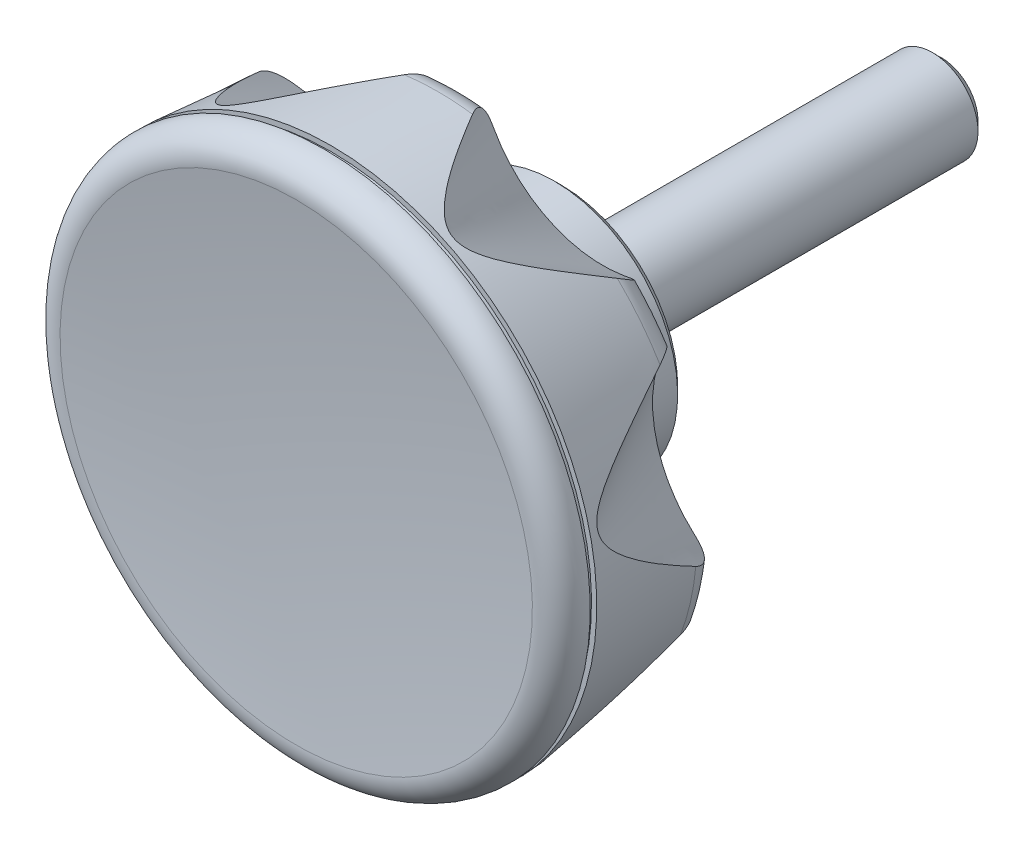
ISO-10303-21;
HEADER;
FILE_DESCRIPTION(('STEP AP214'),'2;1');
FILE_NAME('part.step','',(''),(''),'','','');
FILE_SCHEMA(('AUTOMOTIVE_DESIGN { 1 0 10303 214 1 1 1 1 }'));
ENDSEC;
DATA;
#1=APPLICATION_CONTEXT('core data for automotive mechanical design processes');
#2=APPLICATION_PROTOCOL_DEFINITION('international standard','automotive_design',2000,#1);
#3=PRODUCT_CONTEXT('',#1,'mechanical');
#4=PRODUCT('Part','Part','',(#3));
#5=PRODUCT_RELATED_PRODUCT_CATEGORY('part','',(#4));
#6=PRODUCT_DEFINITION_FORMATION('','',#4);
#7=PRODUCT_DEFINITION_CONTEXT('part definition',#1,'design');
#8=PRODUCT_DEFINITION('design','',#6,#7);
#9=PRODUCT_DEFINITION_SHAPE('','',#8);
#10=(LENGTH_UNIT() NAMED_UNIT(*) SI_UNIT(.MILLI.,.METRE.));
#11=(NAMED_UNIT(*) PLANE_ANGLE_UNIT() SI_UNIT($,.RADIAN.));
#12=(NAMED_UNIT(*) SI_UNIT($,.STERADIAN.) SOLID_ANGLE_UNIT());
#13=UNCERTAINTY_MEASURE_WITH_UNIT(LENGTH_MEASURE(1.E-05),#10,'distance_accuracy_value','');
#14=(GEOMETRIC_REPRESENTATION_CONTEXT(3) GLOBAL_UNCERTAINTY_ASSIGNED_CONTEXT((#13)) GLOBAL_UNIT_ASSIGNED_CONTEXT((#10,
#11,#12)) REPRESENTATION_CONTEXT('',''));
#15=CARTESIAN_POINT('',(0.,0.,0.));
#16=DIRECTION('',(0.,0.,1.));
#17=DIRECTION('',(1.,0.,0.));
#18=AXIS2_PLACEMENT_3D('',#15,#16,#17);
#19=CARTESIAN_POINT('',(0.,0.,16.5));
#20=DIRECTION('',(0.,0.,1.));
#21=DIRECTION('',(0.,1.,0.));
#22=AXIS2_PLACEMENT_3D('',#19,#20,#21);
#23=TOROIDAL_SURFACE('',#22,30.5569827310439,3.49999999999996);
#24=CARTESIAN_POINT('',(-30.4277694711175,-2.80714065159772,12.9999999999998));
#25=CARTESIAN_POINT('',(-30.4922913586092,-2.86477433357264,12.9999995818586));
#26=CARTESIAN_POINT('',(-30.558064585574,-2.92106397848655,13.002073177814));
#27=CARTESIAN_POINT('',(-30.6919823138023,-3.03053883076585,13.010813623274));
#28=CARTESIAN_POINT('',(-30.7601296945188,-3.08372004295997,13.017486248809));
#29=CARTESIAN_POINT('',(-30.8991260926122,-3.18687819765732,13.0359552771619));
#30=CARTESIAN_POINT('',(-30.9699939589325,-3.23682184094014,13.0477974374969));
#31=CARTESIAN_POINT('',(-31.1134463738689,-3.33240092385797,13.0770311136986));
#32=CARTESIAN_POINT('',(-31.1860302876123,-3.378037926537,13.0944206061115));
#33=CARTESIAN_POINT('',(-31.3330374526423,-3.46480885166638,13.1352731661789));
#34=CARTESIAN_POINT('',(-31.4074708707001,-3.50590306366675,13.1587845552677));
#35=CARTESIAN_POINT('',(-31.5569302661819,-3.58258562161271,13.2120638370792));
#36=CARTESIAN_POINT('',(-31.6319561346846,-3.61817495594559,13.2418306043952));
#37=CARTESIAN_POINT('',(-31.7815087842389,-3.68321920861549,13.3075877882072));
#38=CARTESIAN_POINT('',(-31.856036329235,-3.71269963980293,13.34355112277));
#39=CARTESIAN_POINT('',(-32.0040438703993,-3.76533170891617,13.4217135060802));
#40=CARTESIAN_POINT('',(-32.077524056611,-3.78848450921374,13.4639114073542));
#41=CARTESIAN_POINT('',(-32.2127536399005,-3.82555260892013,13.5481801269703));
#42=CARTESIAN_POINT('',(-32.2747476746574,-3.84029295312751,13.5894992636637));
#43=CARTESIAN_POINT('',(-32.3967559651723,-3.8648324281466,13.6763591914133));
#44=CARTESIAN_POINT('',(-32.4567695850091,-3.87462998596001,13.7219013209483));
#45=CARTESIAN_POINT('',(-32.5743242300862,-3.88932568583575,13.8168914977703));
#46=CARTESIAN_POINT('',(-32.6318634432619,-3.89422029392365,13.8663423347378));
#47=CARTESIAN_POINT('',(-32.7439869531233,-3.89923372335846,13.9687276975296));
#48=CARTESIAN_POINT('',(-32.7985700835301,-3.89935067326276,14.0216635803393));
#49=CARTESIAN_POINT('',(-32.9523859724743,-3.89300950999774,14.1800128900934));
#50=CARTESIAN_POINT('',(-33.0472644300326,-3.88049800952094,14.289516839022));
#51=CARTESIAN_POINT('',(-33.2229626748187,-3.84059009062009,14.5165356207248));
#52=CARTESIAN_POINT('',(-33.3037858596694,-3.81319727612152,14.6340485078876));
#53=CARTESIAN_POINT('',(-33.4587694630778,-3.74182305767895,14.8877018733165));
#54=CARTESIAN_POINT('',(-33.5312118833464,-3.69634528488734,15.0244673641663));
#55=CARTESIAN_POINT('',(-33.6577169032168,-3.59210577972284,15.3014973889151));
#56=CARTESIAN_POINT('',(-33.7117580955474,-3.53332870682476,15.4417657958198));
#57=CARTESIAN_POINT('',(-33.7933589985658,-3.41681811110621,15.6966901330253));
#58=CARTESIAN_POINT('',(-33.8239786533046,-3.36093708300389,15.8112404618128));
#59=CARTESIAN_POINT('',(-33.8735900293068,-3.24311939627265,16.0391889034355));
#60=CARTESIAN_POINT('',(-33.8926252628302,-3.18120642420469,16.1525897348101));
#61=CARTESIAN_POINT('',(-33.906149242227,-3.11665429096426,16.2650726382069));
#62=B_SPLINE_CURVE_WITH_KNOTS('',3,(#24,#25,#26,#27,#28,#29,#30,#31,#32,#33,#34,#35,#36,#37,#38,
#39,#40,#41,#42,#43,#44,#45,#46,#47,#48,#49,#50,#51,#52,#53,#54,#55,#56,#57,#58,#59,#60,#61),
.UNSPECIFIED.,.F.,.F.,(4,2,2,2,2,2,2,2,2,2,2,2,2,2,2,2,2,2,4),(0.,0.259555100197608,
0.519436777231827,0.781666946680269,1.04380157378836,1.30807155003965,1.57229402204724,
1.83538972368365,2.09843706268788,2.32597812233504,2.55359154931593,2.78136891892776,
3.00923550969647,3.44356210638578,3.87778356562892,4.35989598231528,4.84256736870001,
5.23515773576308,5.6262642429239),.UNSPECIFIED.);
#63=CARTESIAN_POINT('',(-30.4277694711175,-2.8071406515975,12.9999999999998));
#64=VERTEX_POINT('',#63);
#65=CARTESIAN_POINT('',(-33.906149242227,-3.11665429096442,16.2650726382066));
#66=VERTEX_POINT('',#65);
#67=EDGE_CURVE('E116',#64,#66,#62,.T.);
#68=ORIENTED_EDGE('',*,*,#67,.F.);
#69=CARTESIAN_POINT('',(0.,0.,12.9999999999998));
#70=DIRECTION('',(0.,0.,1.));
#71=DIRECTION('',(0.,1.,0.));
#72=AXIS2_PLACEMENT_3D('',#69,#70,#71);
#73=CIRCLE('',#72,30.5569827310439);
#74=CARTESIAN_POINT('',(-28.632445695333,-10.6729680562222,12.9999999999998));
#75=VERTEX_POINT('',#74);
#76=EDGE_CURVE('E37',#64,#75,#73,.T.);
#77=ORIENTED_EDGE('',*,*,#76,.T.);
#78=CARTESIAN_POINT('',(-31.9006505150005,-11.9033183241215,16.2650726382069));
#79=CARTESIAN_POINT('',(-31.9127655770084,-11.8542285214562,16.1788472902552));
#80=CARTESIAN_POINT('',(-31.9213061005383,-11.8051794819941,16.092150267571));
#81=CARTESIAN_POINT('',(-31.9308592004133,-11.7073324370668,15.9181115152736));
#82=CARTESIAN_POINT('',(-31.9318654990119,-11.6585346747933,15.8307693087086));
#83=CARTESIAN_POINT('',(-31.9229383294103,-11.512015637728,15.5668553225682));
#84=CARTESIAN_POINT('',(-31.9008235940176,-11.4150672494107,15.389974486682));
#85=CARTESIAN_POINT('',(-31.8413429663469,-11.2738330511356,15.1279647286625));
#86=CARTESIAN_POINT('',(-31.8170085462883,-11.2273082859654,15.0409016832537));
#87=CARTESIAN_POINT('',(-31.7592310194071,-11.1363098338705,14.8687696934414));
#88=CARTESIAN_POINT('',(-31.7257939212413,-11.0918348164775,14.7836994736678));
#89=CARTESIAN_POINT('',(-31.6497513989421,-11.0057346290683,14.616681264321));
#90=CARTESIAN_POINT('',(-31.6071781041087,-10.9641001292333,14.53472348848));
#91=CARTESIAN_POINT('',(-31.5127571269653,-10.8842577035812,14.3745637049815));
#92=CARTESIAN_POINT('',(-31.4609118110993,-10.8460489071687,14.296360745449));
#93=CARTESIAN_POINT('',(-31.3560371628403,-10.7789272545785,14.1553613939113));
#94=CARTESIAN_POINT('',(-31.3041952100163,-10.7494623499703,14.0919431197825));
#95=CARTESIAN_POINT('',(-31.1940469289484,-10.6941766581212,13.9692748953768));
#96=CARTESIAN_POINT('',(-31.1357419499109,-10.6683551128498,13.9100240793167));
#97=CARTESIAN_POINT('',(-31.0131130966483,-10.6208593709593,13.7963342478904));
#98=CARTESIAN_POINT('',(-30.9487918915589,-10.599183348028,13.7418931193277));
#99=CARTESIAN_POINT('',(-30.8147052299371,-10.5604026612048,13.6383551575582));
#100=CARTESIAN_POINT('',(-30.7449405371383,-10.5432973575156,13.5892575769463));
#101=CARTESIAN_POINT('',(-30.6117866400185,-10.5162408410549,13.5039379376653));
#102=CARTESIAN_POINT('',(-30.5490604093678,-10.5055947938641,13.4668960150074));
#103=CARTESIAN_POINT('',(-30.4207373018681,-10.4879457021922,13.3971240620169));
#104=CARTESIAN_POINT('',(-30.3551395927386,-10.480943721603,13.3643952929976));
#105=CARTESIAN_POINT('',(-30.2216746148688,-10.4706537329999,13.3033769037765));
#106=CARTESIAN_POINT('',(-30.1538085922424,-10.467363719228,13.2750848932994));
#107=CARTESIAN_POINT('',(-30.0163143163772,-10.4644744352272,13.2229137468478));
#108=CARTESIAN_POINT('',(-29.9466854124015,-10.4648765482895,13.1990362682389));
#109=CARTESIAN_POINT('',(-29.735784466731,-10.4715361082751,13.1338837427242));
#110=CARTESIAN_POINT('',(-29.5926042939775,-10.4832546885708,13.0991362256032));
#111=CARTESIAN_POINT('',(-29.3050619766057,-10.5200545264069,13.0457059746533));
#112=CARTESIAN_POINT('',(-29.1606993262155,-10.5451418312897,13.0270305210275));
#113=CARTESIAN_POINT('',(-28.952520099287,-10.5899735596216,13.0100924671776));
#114=CARTESIAN_POINT('',(-28.8880614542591,-10.6050709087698,13.0062521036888));
#115=CARTESIAN_POINT('',(-28.7597887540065,-10.637430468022,13.0012106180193));
#116=CARTESIAN_POINT('',(-28.6959733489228,-10.6546860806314,13.0000016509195));
#117=CARTESIAN_POINT('',(-28.632445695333,-10.6729680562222,12.9999999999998));
#118=B_SPLINE_CURVE_WITH_KNOTS('',3,(#78,#79,#80,#81,#82,#83,#84,#85,#86,#87,#88,#89,#90,#91,
#92,#93,#94,#95,#96,#97,#98,#99,#100,#101,#102,#103,#104,#105,#106,#107,#108,#109,#110,#111,
#112,#113,#114,#115,#116,#117),.UNSPECIFIED.,.F.,.F.,(4,2,2,2,2,2,2,2,2,2,2,2,2,2,2,2,2,2,2,4),
(0.,0.299698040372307,0.599645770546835,1.20498031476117,1.50964069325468,1.81410045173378,
2.11750656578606,2.4208353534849,2.68159295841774,2.94229623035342,3.20288438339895,
3.46343604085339,3.68403118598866,3.90469069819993,4.12523092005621,4.34585377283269,
4.78744512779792,5.22923640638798,5.42810702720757,5.62638394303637),.UNSPECIFIED.);
#119=CARTESIAN_POINT('',(-31.9006505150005,-11.9033183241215,16.2650726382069));
#120=VERTEX_POINT('',#119);
#121=EDGE_CURVE('E347',#120,#75,#118,.T.);
#122=ORIENTED_EDGE('',*,*,#121,.F.);
#123=CARTESIAN_POINT('',(0.,0.,16.2650726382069));
#124=DIRECTION('',(0.,0.,1.));
#125=DIRECTION('',(0.,1.,0.));
#126=AXIS2_PLACEMENT_3D('',#123,#124,#125);
#127=CIRCLE('',#126,34.0490894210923);
#128=EDGE_CURVE('E123',#66,#120,#127,.T.);
#129=ORIENTED_EDGE('',*,*,#128,.F.);
#130=EDGE_LOOP('',(#68,#77,#122,#129));
#131=FACE_BOUND('',#130,.T.);
#132=ADVANCED_FACE('F14',(#131),#23,.T.);
#133=CARTESIAN_POINT('',(-16.7766930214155,-25.5396116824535,12.9999999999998));
#134=CARTESIAN_POINT('',(-16.7718619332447,-25.6259909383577,12.9999995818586));
#135=CARTESIAN_POINT('',(-16.7688618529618,-25.7125105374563,13.002073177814));
#136=CARTESIAN_POINT('',(-16.7667673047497,-25.8854680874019,13.010813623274));
#137=CARTESIAN_POINT('',(-16.7676777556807,-25.9719057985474,13.017486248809));
#138=CARTESIAN_POINT('',(-16.7736882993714,-26.1448956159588,13.0359552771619));
#139=CARTESIAN_POINT('',(-16.7788261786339,-26.2314416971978,13.0477974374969));
#140=CARTESIAN_POINT('',(-16.7935405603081,-26.4031898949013,13.0770311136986));
#141=CARTESIAN_POINT('',(-16.803115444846,-26.4883924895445,13.0944206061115));
#142=CARTESIAN_POINT('',(-16.8269326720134,-26.6574281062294,13.1352731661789));
#143=CARTESIAN_POINT('',(-16.8412124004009,-26.7412443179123,13.1587845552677));
#144=CARTESIAN_POINT('',(-16.8744459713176,-26.9059071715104,13.2120638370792));
#145=CARTESIAN_POINT('',(-16.893398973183,-26.9867543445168,13.2418306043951));
#146=CARTESIAN_POINT('',(-16.9357898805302,-27.1442337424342,13.3075877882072));
#147=CARTESIAN_POINT('',(-16.9592083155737,-27.220882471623,13.3435511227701));
#148=CARTESIAN_POINT('',(-17.0103400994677,-27.3694149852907,13.4217135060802));
#149=CARTESIAN_POINT('',(-17.0380526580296,-27.4412996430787,13.4639114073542));
#150=CARTESIAN_POINT('',(-17.0933859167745,-27.5701379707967,13.5481801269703));
#151=CARTESIAN_POINT('',(-17.1205141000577,-27.6277973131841,13.5894992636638));
#152=CARTESIAN_POINT('',(-17.1773992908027,-27.738487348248,13.6763591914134));
#153=CARTESIAN_POINT('',(-17.2071571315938,-27.7915165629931,13.7219013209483));
#154=CARTESIAN_POINT('',(-17.2689616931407,-27.8925871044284,13.8168914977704));
#155=CARTESIAN_POINT('',(-17.3010100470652,-27.9406248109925,13.8663423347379));
#156=CARTESIAN_POINT('',(-17.3669982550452,-28.0314123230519,13.9687276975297));
#157=CARTESIAN_POINT('',(-17.4009388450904,-28.0741600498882,14.0216635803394));
#158=CARTESIAN_POINT('',(-17.501799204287,-28.1904645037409,14.1800128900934));
#159=CARTESIAN_POINT('',(-17.5707368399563,-28.2568426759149,14.289516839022));
#160=CARTESIAN_POINT('',(-17.7114841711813,-28.3693269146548,14.5165356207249));
#161=CARTESIAN_POINT('',(-17.7832931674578,-28.4154378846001,14.6340485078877));
#162=CARTESIAN_POINT('',(-17.9357264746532,-28.4921078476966,14.8877018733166));
#163=CARTESIAN_POINT('',(-18.0164495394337,-28.5203906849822,15.0244673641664));
#164=CARTESIAN_POINT('',(-18.1768218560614,-28.5543040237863,15.3014973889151));
#165=CARTESIAN_POINT('',(-18.256469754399,-28.5599082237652,15.4417657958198));
#166=CARTESIAN_POINT('',(-18.3984387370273,-28.5510632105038,15.6966901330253));
#167=CARTESIAN_POINT('',(-18.4612193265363,-28.5401613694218,15.8112404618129));
#168=CARTESIAN_POINT('',(-18.5842650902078,-28.5054909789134,16.0391889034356));
#169=CARTESIAN_POINT('',(-18.6445388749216,-28.4817712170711,16.1525897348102));
#170=CARTESIAN_POINT('',(-18.703439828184,-28.4520970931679,16.2650726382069));
#171=B_SPLINE_CURVE_WITH_KNOTS('',3,(#133,#134,#135,#136,#137,#138,#139,#140,#141,#142,#143,
#144,#145,#146,#147,#148,#149,#150,#151,#152,#153,#154,#155,#156,#157,#158,#159,#160,#161,#162,
#163,#164,#165,#166,#167,#168,#169,#170),.UNSPECIFIED.,.F.,.F.,(4,2,2,2,2,2,2,2,2,2,2,2,2,2,2,2,
2,2,4),(0.,0.259555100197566,0.519436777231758,0.781666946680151,1.04380157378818,
1.30807155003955,1.57229402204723,1.83538972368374,2.09843706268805,2.32597812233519,
2.55359154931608,2.78136891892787,3.00923550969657,3.44356210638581,3.8777835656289,
4.35989598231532,4.84256736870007,5.23515773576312,5.62626424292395),.UNSPECIFIED.);
#172=CARTESIAN_POINT('',(-16.7766930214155,-25.5396116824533,12.9999999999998));
#173=VERTEX_POINT('',#172);
#174=CARTESIAN_POINT('',(-18.7034398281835,-28.4520970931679,16.2650726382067));
#175=VERTEX_POINT('',#174);
#176=EDGE_CURVE('E346',#173,#175,#171,.T.);
#177=ORIENTED_EDGE('',*,*,#176,.F.);
#178=CARTESIAN_POINT('',(-9.50757545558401,-29.040234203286,12.9999999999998));
#179=VERTEX_POINT('',#178);
#180=EDGE_CURVE('E132',#173,#179,#73,.T.);
#181=ORIENTED_EDGE('',*,*,#180,.T.);
#182=CARTESIAN_POINT('',(-10.5833412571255,-32.3625304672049,16.2650726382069));
#183=CARTESIAN_POINT('',(-10.6292748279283,-32.341395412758,16.1788472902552));
#184=CARTESIAN_POINT('',(-10.6729478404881,-32.3174910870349,16.092150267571));
#185=CARTESIAN_POINT('',(-10.755404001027,-32.2639533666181,15.9181115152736));
#186=CARTESIAN_POINT('',(-10.7941830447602,-32.2343152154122,15.8307693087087));
#187=CARTESIAN_POINT('',(-10.9031702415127,-32.1359825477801,15.5668553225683));
#188=CARTESIAN_POINT('',(-10.9651792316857,-32.0582462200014,15.389974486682));
#189=CARTESIAN_POINT('',(-11.0385150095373,-31.9236843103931,15.1279647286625));
#190=CARTESIAN_POINT('',(-11.0597172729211,-31.8756511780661,15.0409016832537));
#191=CARTESIAN_POINT('',(-11.0948390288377,-31.773742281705,14.8687696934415));
#192=CARTESIAN_POINT('',(-11.1087633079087,-31.7198703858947,14.7836994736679));
#193=CARTESIAN_POINT('',(-11.1286674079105,-31.6067353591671,14.616681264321));
#194=CARTESIAN_POINT('',(-11.1346745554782,-31.5474915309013,14.53472348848));
#195=CARTESIAN_POINT('',(-11.1382273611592,-31.4238893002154,14.3745637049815));
#196=CARTESIAN_POINT('',(-11.1357751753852,-31.3595322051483,14.2963607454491));
#197=CARTESIAN_POINT('',(-11.1228647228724,-31.2356882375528,14.1553613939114));
#198=CARTESIAN_POINT('',(-11.1135783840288,-31.1767854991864,14.0919431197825));
#199=CARTESIAN_POINT('',(-11.0881261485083,-31.0561980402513,13.9692748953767));
#200=CARTESIAN_POINT('',(-11.0719616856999,-30.9945139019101,13.9100240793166));
#201=CARTESIAN_POINT('',(-11.0326375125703,-30.86902569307,13.7963342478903));
#202=CARTESIAN_POINT('',(-11.0094808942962,-30.8052225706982,13.7418931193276));
#203=CARTESIAN_POINT('',(-10.9561991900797,-30.67621003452,13.6383551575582));
#204=CARTESIAN_POINT('',(-10.9260750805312,-30.6110008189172,13.5892575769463));
#205=CARTESIAN_POINT('',(-10.8642086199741,-30.4900274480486,13.5039379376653));
#206=CARTESIAN_POINT('',(-10.8334228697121,-30.4343484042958,13.4668960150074));
#207=CARTESIAN_POINT('',(-10.7672133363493,-30.3230173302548,13.3971240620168));
#208=CARTESIAN_POINT('',(-10.731788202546,-30.2673653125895,13.3643952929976));
#209=CARTESIAN_POINT('',(-10.6566191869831,-30.1566024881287,13.3033769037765));
#210=CARTESIAN_POINT('',(-10.6168776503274,-30.1014914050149,13.2750848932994));
#211=CARTESIAN_POINT('',(-10.5334103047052,-29.992192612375,13.2229137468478));
#212=CARTESIAN_POINT('',(-10.4896830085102,-29.9380052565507,13.1990362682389));
#213=CARTESIAN_POINT('',(-10.3529817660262,-29.777268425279,13.1338837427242));
#214=CARTESIAN_POINT('',(-10.2545484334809,-29.6726320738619,13.0991362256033));
#215=CARTESIAN_POINT('',(-10.0464974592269,-29.4707667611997,13.0457059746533));
#216=CARTESIAN_POINT('',(-9.93687477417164,-29.3735411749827,13.0270305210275));
#217=CARTESIAN_POINT('',(-9.77202629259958,-29.2387322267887,13.0100924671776));
#218=CARTESIAN_POINT('',(-9.72003340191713,-29.1977494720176,13.0062521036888));
#219=CARTESIAN_POINT('',(-9.61475695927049,-29.1176376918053,13.0012106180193));
#220=CARTESIAN_POINT('',(-9.56147772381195,-29.0785034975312,13.0000016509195));
#221=CARTESIAN_POINT('',(-9.50757545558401,-29.0402342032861,12.9999999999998));
#222=B_SPLINE_CURVE_WITH_KNOTS('',3,(#182,#183,#184,#185,#186,#187,#188,#189,#190,#191,#192,
#193,#194,#195,#196,#197,#198,#199,#200,#201,#202,#203,#204,#205,#206,#207,#208,#209,#210,#211,
#212,#213,#214,#215,#216,#217,#218,#219,#220,#221),.UNSPECIFIED.,.F.,.F.,(4,2,2,2,2,2,2,2,2,2,2,
2,2,2,2,2,2,2,2,4),(0.,0.299698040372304,0.599645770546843,1.20498031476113,1.50964069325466,
1.81410045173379,2.1175065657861,2.42083535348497,2.68159295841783,2.94229623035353,
3.20288438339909,3.46343604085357,3.6840311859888,3.90469069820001,4.12523092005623,
4.34585377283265,4.78744512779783,5.22923640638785,5.42810702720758,5.62638394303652),.UNSPECIFIED.);
#223=CARTESIAN_POINT('',(-10.5833412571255,-32.3625304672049,16.2650726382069));
#224=VERTEX_POINT('',#223);
#225=EDGE_CURVE('E390',#224,#179,#222,.T.);
#226=ORIENTED_EDGE('',*,*,#225,.F.);
#227=EDGE_CURVE('E670',#175,#224,#127,.T.);
#228=ORIENTED_EDGE('',*,*,#227,.F.);
#229=EDGE_LOOP('',(#177,#181,#226,#228));
#230=FACE_BOUND('',#229,.T.);
#231=ADVANCED_FACE('F175',(#230),#23,.T.);
#232=CARTESIAN_POINT('',(9.50757545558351,-29.0402342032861,12.9999999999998));
#233=CARTESIAN_POINT('',(9.5781216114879,-29.090313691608,12.9999995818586));
#234=CARTESIAN_POINT('',(9.64763587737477,-29.1419122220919,13.002073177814));
#235=CARTESIAN_POINT('',(9.78416546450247,-29.2481119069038,13.010813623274));
#236=CARTESIAN_POINT('',(9.85117753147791,-29.3027167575,13.017486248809));
#237=CARTESIAN_POINT('',(9.98267890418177,-29.4152733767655,13.0359552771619));
#238=CARTESIAN_POINT('',(10.0471399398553,-29.4732509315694,13.0477974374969));
#239=CARTESIAN_POINT('',(10.1722438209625,-29.5918383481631,13.0770311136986));
#240=CARTESIAN_POINT('',(10.2328880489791,-29.6524472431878,13.0944206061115));
#241=CARTESIAN_POINT('',(10.3501956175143,-29.7764602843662,13.1352731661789));
#242=CARTESIAN_POINT('',(10.4068225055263,-29.8398831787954,13.1587845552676));
#243=CARTESIAN_POINT('',(10.5148403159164,-29.9685318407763,13.2120638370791));
#244=CARTESIAN_POINT('',(10.5662321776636,-30.0337572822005,13.2418306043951));
#245=CARTESIAN_POINT('',(10.662924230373,-30.1650866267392,13.3075877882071));
#246=CARTESIAN_POINT('',(10.7082494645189,-30.231185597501,13.3435511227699));
#247=CARTESIAN_POINT('',(10.7924967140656,-30.3637705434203,13.4217135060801));
#248=CARTESIAN_POINT('',(10.8314199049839,-30.4302564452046,13.4639114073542));
#249=CARTESIAN_POINT('',(10.8976500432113,-30.5538471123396,13.5481801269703));
#250=CARTESIAN_POINT('',(10.9258157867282,-30.611006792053,13.5894992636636));
#251=CARTESIAN_POINT('',(10.9768894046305,-30.7244955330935,13.6763591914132));
#252=CARTESIAN_POINT('',(10.9997956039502,-30.7808243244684,13.7219013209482));
#253=CARTESIAN_POINT('',(11.0402812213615,-30.8921615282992,13.8168914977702));
#254=CARTESIAN_POINT('',(11.0578567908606,-30.9471689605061,13.8663423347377));
#255=CARTESIAN_POINT('',(11.0876943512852,-31.0553657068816,13.9687276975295));
#256=CARTESIAN_POINT('',(11.0999542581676,-31.1085543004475,14.0216635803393));
#257=CARTESIAN_POINT('',(11.12799933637,-31.2599247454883,14.1800128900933));
#258=CARTESIAN_POINT('',(11.1369139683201,-31.3552084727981,14.2895168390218));
#259=CARTESIAN_POINT('',(11.1371031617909,-31.5353819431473,14.5165356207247));
#260=CARTESIAN_POINT('',(11.1283819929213,-31.6202741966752,14.6340485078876));
#261=CARTESIAN_POINT('',(11.0932843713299,-31.7872542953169,14.8877018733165));
#262=CARTESIAN_POINT('',(11.0650667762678,-31.868000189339,15.0244673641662));
#263=CARTESIAN_POINT('',(10.9915907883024,-32.0145289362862,15.3014973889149));
#264=CARTESIAN_POINT('',(10.9463126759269,-32.0802943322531,15.4417657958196));
#265=CARTESIAN_POINT('',(10.8508811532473,-32.1857753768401,15.6966901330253));
#266=CARTESIAN_POINT('',(10.8032146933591,-32.2280620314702,15.8112404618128));
#267=CARTESIAN_POINT('',(10.6993905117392,-32.3026464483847,16.0391889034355));
#268=CARTESIAN_POINT('',(10.6432655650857,-32.3349813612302,16.1525897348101));
#269=CARTESIAN_POINT('',(10.5833412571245,-32.362530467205,16.2650726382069));
#270=B_SPLINE_CURVE_WITH_KNOTS('',3,(#232,#233,#234,#235,#236,#237,#238,#239,#240,#241,#242,
#243,#244,#245,#246,#247,#248,#249,#250,#251,#252,#253,#254,#255,#256,#257,#258,#259,#260,#261,
#262,#263,#264,#265,#266,#267,#268,#269),.UNSPECIFIED.,.F.,.F.,(4,2,2,2,2,2,2,2,2,2,2,2,2,2,2,2,
2,2,4),(0.,0.259555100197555,0.51943677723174,0.781666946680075,1.04380157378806,
1.30807155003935,1.57229402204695,1.83538972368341,2.09843706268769,2.32597812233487,
2.55359154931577,2.78136891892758,3.00923550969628,3.44356210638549,3.87778356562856,
4.35989598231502,4.84256736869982,5.23515773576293,5.62626424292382),.UNSPECIFIED.);
#271=CARTESIAN_POINT('',(9.50757545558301,-29.0402342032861,12.9999999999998));
#272=VERTEX_POINT('',#271);
#273=CARTESIAN_POINT('',(10.583341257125,-32.3625304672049,16.2650726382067));
#274=VERTEX_POINT('',#273);
#275=EDGE_CURVE('E395',#272,#274,#270,.T.);
#276=ORIENTED_EDGE('',*,*,#275,.F.);
#277=CARTESIAN_POINT('',(16.7766930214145,-25.5396116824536,12.9999999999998));
#278=VERTEX_POINT('',#277);
#279=EDGE_CURVE('E136',#272,#278,#73,.T.);
#280=ORIENTED_EDGE('',*,*,#279,.T.);
#281=CARTESIAN_POINT('',(18.703439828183,-28.4520970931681,16.2650726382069));
#282=CARTESIAN_POINT('',(18.6582766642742,-28.4748319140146,16.1788472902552));
#283=CARTESIAN_POINT('',(18.6123578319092,-28.4940727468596,16.0921502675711));
#284=CARTESIAN_POINT('',(18.5190897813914,-28.5251593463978,15.9181115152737));
#285=CARTESIAN_POINT('',(18.4717394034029,-28.5369989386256,15.8307693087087));
#286=CARTESIAN_POINT('',(18.3269074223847,-28.5608991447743,15.5668553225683));
#287=CARTESIAN_POINT('',(18.2274687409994,-28.5609119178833,15.3899744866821));
#288=CARTESIAN_POINT('',(18.0765398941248,-28.5343501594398,15.1279647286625));
#289=CARTESIAN_POINT('',(18.0257666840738,-28.5209785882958,15.0409016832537));
#290=CARTESIAN_POINT('',(17.9241930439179,-28.4848987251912,14.8687696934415));
#291=CARTESIAN_POINT('',(17.8733926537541,-28.462196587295,14.7836994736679));
#292=CARTESIAN_POINT('',(17.7725301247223,-28.407219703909,14.616681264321));
#293=CARTESIAN_POINT('',(17.7224660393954,-28.3749783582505,14.53472348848));
#294=CARTESIAN_POINT('',(17.6236147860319,-28.3006913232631,14.3745637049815));
#295=CARTESIAN_POINT('',(17.5748272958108,-28.2586481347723,14.2963607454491));
#296=CARTESIAN_POINT('',(17.4860517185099,-28.1713388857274,14.1553613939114));
#297=CARTESIAN_POINT('',(17.4457896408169,-28.1273532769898,14.0919431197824));
#298=CARTESIAN_POINT('',(17.3673797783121,-28.0322688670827,13.9692748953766));
#299=CARTESIAN_POINT('',(17.3292315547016,-27.9811715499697,13.9100240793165));
#300=CARTESIAN_POINT('',(17.2556391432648,-27.8721860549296,13.7963342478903));
#301=CARTESIAN_POINT('',(17.2201937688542,-27.8143008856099,13.7418931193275));
#302=CARTESIAN_POINT('',(17.1525483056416,-27.6922055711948,13.6383551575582));
#303=CARTESIAN_POINT('',(17.12034776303,-27.6279963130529,13.5892575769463));
#304=CARTESIAN_POINT('',(17.064340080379,-27.5042015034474,13.5039379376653));
#305=CARTESIAN_POINT('',(17.0400030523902,-27.4454169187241,13.4668960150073));
#306=CARTESIAN_POINT('',(16.9942418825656,-27.3242384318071,13.3971240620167));
#307=CARTESIAN_POINT('',(16.9728185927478,-27.2618434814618,13.3643952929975));
#308=CARTESIAN_POINT('',(16.9330878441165,-27.1340144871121,13.3033769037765));
#309=CARTESIAN_POINT('',(16.9147787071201,-27.0685821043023,13.2750848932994));
#310=CARTESIAN_POINT('',(16.8813665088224,-26.9351780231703,13.2229137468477));
#311=CARTESIAN_POINT('',(16.8662646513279,-26.8672053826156,13.1990362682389));
#312=CARTESIAN_POINT('',(16.825827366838,-26.660110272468,13.1338837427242));
#313=CARTESIAN_POINT('',(16.805391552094,-26.5179122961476,13.0991362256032));
#314=CARTESIAN_POINT('',(16.7772845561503,-26.2293905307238,13.0457059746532));
#315=CARTESIAN_POINT('',(16.7696191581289,-26.0830649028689,13.0270305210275));
#316=CARTESIAN_POINT('',(16.7670026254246,-25.8701291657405,13.0100924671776));
#317=CARTESIAN_POINT('',(16.7673780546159,-25.8039271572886,13.0062521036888));
#318=CARTESIAN_POINT('',(16.7703829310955,-25.6716698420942,13.0012106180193));
#319=CARTESIAN_POINT('',(16.7730056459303,-25.605614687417,13.0000016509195));
#320=CARTESIAN_POINT('',(16.776693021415,-25.5396116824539,12.9999999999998));
#321=B_SPLINE_CURVE_WITH_KNOTS('',3,(#281,#282,#283,#284,#285,#286,#287,#288,#289,#290,#291,
#292,#293,#294,#295,#296,#297,#298,#299,#300,#301,#302,#303,#304,#305,#306,#307,#308,#309,#310,
#311,#312,#313,#314,#315,#316,#317,#318,#319,#320),.UNSPECIFIED.,.F.,.F.,(4,2,2,2,2,2,2,2,2,2,2,
2,2,2,2,2,2,2,2,4),(0.,0.299698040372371,0.599645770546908,1.20498031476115,1.50964069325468,
1.81410045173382,2.11750656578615,2.42083535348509,2.68159295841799,2.9422962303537,
3.20288438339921,3.46343604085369,3.68403118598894,3.90469069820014,4.12523092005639,
4.34585377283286,4.7874451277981,5.22923640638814,5.4281070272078,5.62638394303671),.UNSPECIFIED.);
#322=CARTESIAN_POINT('',(18.703439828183,-28.4520970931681,16.2650726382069));
#323=VERTEX_POINT('',#322);
#324=EDGE_CURVE('E402',#323,#278,#321,.T.);
#325=ORIENTED_EDGE('',*,*,#324,.F.);
#326=EDGE_CURVE('E673',#274,#323,#127,.T.);
#327=ORIENTED_EDGE('',*,*,#326,.F.);
#328=EDGE_LOOP('',(#276,#280,#325,#327));
#329=FACE_BOUND('',#328,.T.);
#330=ADVANCED_FACE('F182',(#329),#23,.T.);
#331=CARTESIAN_POINT('',(28.6324456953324,-10.6729680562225,12.9999999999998));
#332=CARTESIAN_POINT('',(28.7155842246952,-10.6490369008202,12.9999995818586));
#333=CARTESIAN_POINT('',(28.7992670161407,-10.6268596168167,13.002073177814));
#334=CARTESIAN_POINT('',(28.9674220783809,-10.5863309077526,13.010813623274));
#335=CARTESIAN_POINT('',(29.0518952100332,-10.5679843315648,13.017486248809));
#336=CARTESIAN_POINT('',(29.2218852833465,-10.5353503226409,13.0359552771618));
#337=CARTESIAN_POINT('',(29.3074047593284,-10.5211010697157,13.0477974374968));
#338=CARTESIAN_POINT('',(29.4781211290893,-10.4972289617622,13.0770311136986));
#339=CARTESIAN_POINT('',(29.5633181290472,-10.4876044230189,13.0944206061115));
#340=CARTESIAN_POINT('',(29.7334155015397,-10.4732105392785,13.1352731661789));
#341=CARTESIAN_POINT('',(29.8183078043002,-10.4684813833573,13.1587845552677));
#342=CARTESIAN_POINT('',(29.9862373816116,-10.4642407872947,13.2120638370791));
#343=CARTESIAN_POINT('',(30.0692749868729,-10.4647284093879,13.2418306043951));
#344=CARTESIAN_POINT('',(30.2322389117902,-10.4710140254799,13.3075877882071));
#345=CARTESIAN_POINT('',(30.3121769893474,-10.4767893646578,13.34355112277));
#346=CARTESIAN_POINT('',(30.4683633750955,-10.4935875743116,13.4217135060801));
#347=CARTESIAN_POINT('',(30.5446123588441,-10.5046094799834,13.4639114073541));
#348=CARTESIAN_POINT('',(30.68253324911,-10.5298861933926,13.5481801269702));
#349=CARTESIAN_POINT('',(30.7447835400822,-10.5435038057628,13.5894992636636));
#350=CARTESIAN_POINT('',(30.8653564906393,-10.5743319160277,13.6763591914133));
#351=CARTESIAN_POINT('',(30.9236778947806,-10.5915435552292,13.7219013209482));
#352=CARTESIAN_POINT('',(31.0359671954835,-10.6293082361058,13.8168914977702));
#353=CARTESIAN_POINT('',(31.0899319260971,-10.6498636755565,13.8663423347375));
#354=CARTESIAN_POINT('',(31.193126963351,-10.6939952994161,13.9687276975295));
#355=CARTESIAN_POINT('',(31.2423554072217,-10.717572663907,14.0216635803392));
#356=CARTESIAN_POINT('',(31.3781874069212,-10.790024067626,14.1800128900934));
#357=CARTESIAN_POINT('',(31.4582414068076,-10.8424627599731,14.2895168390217));
#358=CARTESIAN_POINT('',(31.5992246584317,-10.9546511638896,14.5165356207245));
#359=CARTESIAN_POINT('',(31.6601585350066,-11.0143991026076,14.6340485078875));
#360=CARTESIAN_POINT('',(31.7688258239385,-11.1459499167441,14.8877018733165));
#361=CARTESIAN_POINT('',(31.8143621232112,-11.2183555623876,15.0244673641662));
#362=CARTESIAN_POINT('',(31.8831113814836,-11.3671605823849,15.3014973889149));
#363=CARTESIAN_POINT('',(31.906298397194,-11.4435644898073,15.4417657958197));
#364=CARTESIAN_POINT('',(31.9292662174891,-11.5839422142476,15.6966901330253));
#365=CARTESIAN_POINT('',(31.932607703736,-11.6475746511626,15.8112404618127));
#366=CARTESIAN_POINT('',(31.9261868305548,-11.7752502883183,16.0391889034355));
#367=CARTESIAN_POINT('',(31.9164739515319,-11.839291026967,16.1525897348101));
#368=CARTESIAN_POINT('',(31.9006505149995,-11.9033183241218,16.2650726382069));
#369=B_SPLINE_CURVE_WITH_KNOTS('',3,(#331,#332,#333,#334,#335,#336,#337,#338,#339,#340,#341,
#342,#343,#344,#345,#346,#347,#348,#349,#350,#351,#352,#353,#354,#355,#356,#357,#358,#359,#360,
#361,#362,#363,#364,#365,#366,#367,#368),.UNSPECIFIED.,.F.,.F.,(4,2,2,2,2,2,2,2,2,2,2,2,2,2,2,2,
2,2,4),(0.,0.25955510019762,0.519436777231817,0.781666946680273,1.0438015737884,
1.30807155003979,1.57229402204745,1.83538972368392,2.09843706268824,2.32597812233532,
2.5535915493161,2.78136891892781,3.00923550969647,3.44356210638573,3.87778356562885,
4.35989598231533,4.8425673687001,5.2351577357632,5.62626424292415),.UNSPECIFIED.);
#370=CARTESIAN_POINT('',(28.6324456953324,-10.6729680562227,12.9999999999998));
#371=VERTEX_POINT('',#370);
#372=CARTESIAN_POINT('',(31.9006505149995,-11.9033183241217,16.2650726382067));
#373=VERTEX_POINT('',#372);
#374=EDGE_CURVE('E412',#371,#373,#369,.T.);
#375=ORIENTED_EDGE('',*,*,#374,.F.);
#376=CARTESIAN_POINT('',(30.4277694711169,-2.80714065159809,12.9999999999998));
#377=VERTEX_POINT('',#376);
#378=EDGE_CURVE('E229',#371,#377,#73,.T.);
#379=ORIENTED_EDGE('',*,*,#378,.T.);
#380=CARTESIAN_POINT('',(33.9061492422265,-3.11665429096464,16.2650726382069));
#381=CARTESIAN_POINT('',(33.8957652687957,-3.16613920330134,16.1788472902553));
#382=CARTESIAN_POINT('',(33.88217843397,-3.21403645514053,16.0921502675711));
#383=CARTESIAN_POINT('',(33.8483312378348,-3.30633853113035,15.9181115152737));
#384=CARTESIAN_POINT('',(33.8280653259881,-3.35074041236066,15.8307693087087));
#385=CARTESIAN_POINT('',(33.7564499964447,-3.47887614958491,15.5668553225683));
#386=CARTESIAN_POINT('',(33.6944609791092,-3.55662840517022,15.3899744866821));
#387=CARTESIAN_POINT('',(33.5795915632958,-3.65806834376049,15.1279647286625));
#388=CARTESIAN_POINT('',(33.5374806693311,-3.6894273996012,15.0409016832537));
#389=CARTESIAN_POINT('',(33.445942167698,-3.74634544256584,14.8687696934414));
#390=CARTESIAN_POINT('',(33.3965193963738,-3.77190823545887,14.7836994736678));
#391=CARTESIAN_POINT('',(33.2906499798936,-3.81648820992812,14.616681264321));
#392=CARTESIAN_POINT('',(33.23422823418,-3.83552773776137,14.53472348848));
#393=CARTESIAN_POINT('',(33.1145155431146,-3.86649555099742,14.3745637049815));
#394=CARTESIAN_POINT('',(33.0512263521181,-3.87842564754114,14.2963607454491));
#395=CARTESIAN_POINT('',(32.9276145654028,-3.89339676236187,14.1553613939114));
#396=CARTESIAN_POINT('',(32.8681222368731,-3.89745034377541,14.0919431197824));
#397=CARTESIAN_POINT('',(32.7448945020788,-3.89946948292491,13.9692748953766));
#398=CARTESIAN_POINT('',(32.6811599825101,-3.8974363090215,13.9100240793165));
#399=CARTESIAN_POINT('',(32.5500675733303,-3.88702182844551,13.7963342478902));
#400=CARTESIAN_POINT('',(32.4827112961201,-3.87864332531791,13.7418931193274));
#401=CARTESIAN_POINT('',(32.3450770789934,-3.85540549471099,13.6383551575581));
#402=CARTESIAN_POINT('',(32.2747995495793,-3.84054707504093,13.5892575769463));
#403=CARTESIAN_POINT('',(32.143092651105,-3.80715084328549,13.5039379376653));
#404=CARTESIAN_POINT('',(32.081959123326,-3.78952670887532,13.4668960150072));
#405=CARTESIAN_POINT('',(31.9586863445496,-3.74975068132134,13.3971240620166));
#406=CARTESIAN_POINT('',(31.896546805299,-3.72759746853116,13.3643952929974));
#407=CARTESIAN_POINT('',(31.7718343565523,-3.67896014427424,13.3033769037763));
#408=CARTESIAN_POINT('',(31.7092616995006,-3.65247838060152,13.2750848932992));
#409=CARTESIAN_POINT('',(31.5841300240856,-3.59542500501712,13.2229137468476));
#410=CARTESIAN_POINT('',(31.5215710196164,-3.56485186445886,13.1990362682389));
#411=CARTESIAN_POINT('',(31.3344453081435,-3.46734531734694,13.1338837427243));
#412=CARTESIAN_POINT('',(31.2105289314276,-3.39466369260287,13.0991362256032));
#413=CARTESIAN_POINT('',(30.9674291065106,-3.23674824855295,13.0457059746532));
#414=CARTESIAN_POINT('',(30.8482478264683,-3.15150876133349,13.0270305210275));
#415=CARTESIAN_POINT('',(30.6801365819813,-3.02079118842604,13.0100924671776));
#416=CARTESIAN_POINT('',(30.628611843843,-2.97922138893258,13.0062521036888));
#417=CARTESIAN_POINT('',(30.5270824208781,-2.89441099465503,13.0012106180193));
#418=CARTESIAN_POINT('',(30.4770736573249,-2.85117575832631,13.0000016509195));
#419=CARTESIAN_POINT('',(30.4277694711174,-2.80714065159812,12.9999999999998));
#420=B_SPLINE_CURVE_WITH_KNOTS('',3,(#380,#381,#382,#383,#384,#385,#386,#387,#388,#389,#390,
#391,#392,#393,#394,#395,#396,#397,#398,#399,#400,#401,#402,#403,#404,#405,#406,#407,#408,#409,
#410,#411,#412,#413,#414,#415,#416,#417,#418,#419),.UNSPECIFIED.,.F.,.F.,(4,2,2,2,2,2,2,2,2,2,2,
2,2,2,2,2,2,2,2,4),(0.,0.299698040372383,0.59964577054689,1.20498031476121,1.50964069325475,
1.81410045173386,2.11750656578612,2.42083535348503,2.68159295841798,2.94229623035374,
3.20288438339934,3.46343604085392,3.6840311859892,3.90469069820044,4.1252309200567,
4.34585377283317,4.78744512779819,5.22923640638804,5.42810702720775,5.62638394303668),.UNSPECIFIED.);
#421=CARTESIAN_POINT('',(33.9061492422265,-3.11665429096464,16.2650726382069));
#422=VERTEX_POINT('',#421);
#423=EDGE_CURVE('E416',#422,#377,#420,.T.);
#424=ORIENTED_EDGE('',*,*,#423,.F.);
#425=EDGE_CURVE('E457',#373,#422,#127,.T.);
#426=ORIENTED_EDGE('',*,*,#425,.F.);
#427=EDGE_LOOP('',(#375,#379,#424,#426));
#428=FACE_BOUND('',#427,.T.);
#429=ADVANCED_FACE('F210',(#428),#23,.T.);
#430=CARTESIAN_POINT('',(26.196500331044,15.7312607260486,12.9999999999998));
#431=CARTESIAN_POINT('',(26.2296262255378,15.8111818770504,12.9999995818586));
#432=CARTESIAN_POINT('',(26.2644626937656,15.8904350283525,13.002073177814));
#433=CARTESIAN_POINT('',(26.3376190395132,16.0471731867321,13.010813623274));
#434=CARTESIAN_POINT('',(26.3759432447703,16.1246558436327,13.017486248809));
#435=CARTESIAN_POINT('',(26.4564160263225,16.2779064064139,13.0359552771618));
#436=CARTESIAN_POINT('',(26.4985960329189,16.3536524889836,13.0477974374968));
#437=CARTESIAN_POINT('',(26.5863719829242,16.5020079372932,13.0770311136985));
#438=CARTESIAN_POINT('',(26.631966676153,16.5746184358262,13.0944206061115));
#439=CARTESIAN_POINT('',(26.7267670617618,16.7165803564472,13.1352731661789));
#440=CARTESIAN_POINT('',(26.7759991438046,16.7859004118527,13.1587845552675));
#441=CARTESIAN_POINT('',(26.8773860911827,16.9198370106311,13.212063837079));
#442=CARTESIAN_POINT('',(26.9295404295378,16.9844543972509,13.2418306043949));
#443=CARTESIAN_POINT('',(27.0360610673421,17.1079457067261,13.307587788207));
#444=CARTESIAN_POINT('',(27.0904169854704,17.1668429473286,13.3435511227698));
#445=CARTESIAN_POINT('',(27.2009309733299,17.2784808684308,13.42171350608));
#446=CARTESIAN_POINT('',(27.2570887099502,17.3312226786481,13.4639114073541));
#447=CARTESIAN_POINT('',(27.3628431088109,17.4232937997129,13.5481801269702));
#448=CARTESIAN_POINT('',(27.412302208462,17.4634725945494,13.5894992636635));
#449=CARTESIAN_POINT('',(27.5115806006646,17.5385193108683,13.6763591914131));
#450=CARTESIAN_POINT('',(27.5614000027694,17.5733855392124,13.7219013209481));
#451=CARTESIAN_POINT('',(27.6609368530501,17.6376309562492,13.8168914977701));
#452=CARTESIAN_POINT('',(27.7106542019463,17.6670061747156,13.8663423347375));
#453=CARTESIAN_POINT('',(27.8094987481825,17.7201716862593,13.9687276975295));
#454=CARTESIAN_POINT('',(27.8586257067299,17.7439597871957,14.0216635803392));
#455=CARTESIAN_POINT('',(27.9999603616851,17.8049848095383,14.1800128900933));
#456=CARTESIAN_POINT('',(28.0908714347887,17.8348785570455,14.2895168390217));
#457=CARTESIAN_POINT('',(28.266485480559,17.8751553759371,14.5165356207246));
#458=CARTESIAN_POINT('',(28.3511899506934,17.8855431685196,14.6340485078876));
#459=CARTESIAN_POINT('',(28.5217934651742,17.8884820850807,14.8877018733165));
#460=CARTESIAN_POINT('',(28.6067938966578,17.8789396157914,15.0244673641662));
#461=CARTESIAN_POINT('',(28.7659988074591,17.8399115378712,15.3014973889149));
#462=CARTESIAN_POINT('',(28.8401906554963,17.8104028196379,15.4417657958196));
#463=CARTESIAN_POINT('',(28.9642625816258,17.7408357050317,15.6966901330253));
#464=CARTESIAN_POINT('',(29.0160958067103,17.703774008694,15.8112404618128));
#465=CARTESIAN_POINT('',(29.1119132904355,17.6191495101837,16.0391889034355));
#466=CARTESIAN_POINT('',(29.1559264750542,17.5716269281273,16.15258973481));
#467=CARTESIAN_POINT('',(29.196119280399,17.5193353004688,16.2650726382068));
#468=B_SPLINE_CURVE_WITH_KNOTS('',3,(#430,#431,#432,#433,#434,#435,#436,#437,#438,#439,#440,
#441,#442,#443,#444,#445,#446,#447,#448,#449,#450,#451,#452,#453,#454,#455,#456,#457,#458,#459,
#460,#461,#462,#463,#464,#465,#466,#467),.UNSPECIFIED.,.F.,.F.,(4,2,2,2,2,2,2,2,2,2,2,2,2,2,2,2,
2,2,4),(0.,0.259555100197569,0.519436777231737,0.781666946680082,1.0438015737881,
1.30807155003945,1.57229402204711,1.83538972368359,2.09843706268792,2.32597812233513,
2.55359154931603,2.78136891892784,3.00923550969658,3.44356210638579,3.87778356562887,
4.35989598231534,4.84256736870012,5.23515773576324,5.62626424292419),.UNSPECIFIED.);
#469=CARTESIAN_POINT('',(26.196500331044,15.7312607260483,12.9999999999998));
#470=VERTEX_POINT('',#469);
#471=CARTESIAN_POINT('',(29.1961192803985,17.5193353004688,16.2650726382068));
#472=VERTEX_POINT('',#471);
#473=EDGE_CURVE('E440',#470,#472,#468,.T.);
#474=ORIENTED_EDGE('',*,*,#473,.F.);
#475=CARTESIAN_POINT('',(21.166114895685,22.0391645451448,12.9999999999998));
#476=VERTEX_POINT('',#475);
#477=EDGE_CURVE('E228',#470,#476,#73,.T.);
#478=ORIENTED_EDGE('',*,*,#477,.T.);
#479=CARTESIAN_POINT('',(23.5768367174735,24.5656927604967,16.2650726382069));
#480=CARTESIAN_POINT('',(23.6090512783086,24.5267209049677,16.1788472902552));
#481=CARTESIAN_POINT('',(23.6380276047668,24.486234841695,16.092150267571));
#482=CARTESIAN_POINT('',(23.6890888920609,24.4022226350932,15.9181115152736));
#483=CARTESIAN_POINT('',(23.7111680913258,24.3586939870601,15.8307693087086));
#484=CARTESIAN_POINT('',(23.7666972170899,24.2228115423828,15.5668553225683));
#485=CARTESIAN_POINT('',(23.7888368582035,24.1258688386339,15.389974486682));
#486=CARTESIAN_POINT('',(23.7965258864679,23.9728135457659,15.1279647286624));
#487=CARTESIAN_POINT('',(23.7947876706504,23.9203378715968,15.0409016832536));
#488=CARTESIAN_POINT('',(23.782214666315,23.8132823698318,14.8687696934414));
#489=CARTESIAN_POINT('',(23.7713858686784,23.7587039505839,14.7836994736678));
#490=CARTESIAN_POINT('',(23.7402313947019,23.6481367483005,14.616681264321));
#491=CARTESIAN_POINT('',(23.7199387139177,23.5921534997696,14.5347234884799));
#492=CARTESIAN_POINT('',(23.6695106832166,23.4792502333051,14.3745637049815));
#493=CARTESIAN_POINT('',(23.6393778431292,23.4223304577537,14.2963607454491));
#494=CARTESIAN_POINT('',(23.5740120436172,23.3163525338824,14.1553613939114));
#495=CARTESIAN_POINT('',(23.5400884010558,23.2673121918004,14.0919431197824));
#496=CARTESIAN_POINT('',(23.46483579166,23.1697099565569,13.9692748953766));
#497=CARTESIAN_POINT('',(23.4235083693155,23.1211479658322,13.9100240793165));
#498=CARTESIAN_POINT('',(23.333631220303,23.0251491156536,13.7963342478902));
#499=CARTESIAN_POINT('',(23.2850846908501,22.9777117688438,13.7418931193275));
#500=CARTESIAN_POINT('',(23.1811030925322,22.88459355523,13.6383551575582));
#501=CARTESIAN_POINT('',(23.125668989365,22.83891244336,13.5892575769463));
#502=CARTESIAN_POINT('',(23.0174408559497,22.7567620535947,13.5039379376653));
#503=CARTESIAN_POINT('',(22.9655456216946,22.719954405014,13.4668960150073));
#504=CARTESIAN_POINT('',(22.8575881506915,22.6483758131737,13.3971240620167));
#505=CARTESIAN_POINT('',(22.8015247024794,22.6136054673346,13.3643952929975));
#506=CARTESIAN_POINT('',(22.685741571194,22.5464262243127,13.3033769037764));
#507=CARTESIAN_POINT('',(22.6260238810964,22.5140160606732,13.2750848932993));
#508=CARTESIAN_POINT('',(22.5033994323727,22.4517563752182,13.2229137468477));
#509=CARTESIAN_POINT('',(22.4404914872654,22.4219078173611,13.1990362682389));
#510=CARTESIAN_POINT('',(22.2475868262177,22.3364013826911,13.1338837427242));
#511=CARTESIAN_POINT('',(22.11350144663,22.2848359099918,13.0991362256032));
#512=CARTESIAN_POINT('',(21.8384679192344,22.1932314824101,13.0457059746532));
#513=CARTESIAN_POINT('',(21.697516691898,22.153197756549,13.0270305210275));
#514=CARTESIAN_POINT('',(21.4905019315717,22.1032641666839,13.0100924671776));
#515=CARTESIAN_POINT('',(21.4258762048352,22.088898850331,13.0062521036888));
#516=CARTESIAN_POINT('',(21.2962662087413,22.062398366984,13.0012106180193));
#517=CARTESIAN_POINT('',(21.2312835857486,22.0502566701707,13.0000016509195));
#518=CARTESIAN_POINT('',(21.1661148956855,22.0391645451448,12.9999999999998));
#519=B_SPLINE_CURVE_WITH_KNOTS('',3,(#479,#480,#481,#482,#483,#484,#485,#486,#487,#488,#489,
#490,#491,#492,#493,#494,#495,#496,#497,#498,#499,#500,#501,#502,#503,#504,#505,#506,#507,#508,
#509,#510,#511,#512,#513,#514,#515,#516,#517,#518),.UNSPECIFIED.,.F.,.F.,(4,2,2,2,2,2,2,2,2,2,2,
2,2,2,2,2,2,2,2,4),(0.,0.299698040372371,0.599645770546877,1.20498031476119,1.50964069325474,
1.81410045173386,2.11750656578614,2.42083535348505,2.68159295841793,2.94229623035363,
3.20288438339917,3.46343604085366,3.68403118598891,3.90469069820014,4.12523092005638,
4.34585377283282,4.78744512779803,5.22923640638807,5.42810702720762,5.62638394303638),.UNSPECIFIED.);
#520=CARTESIAN_POINT('',(23.5768367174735,24.5656927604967,16.2650726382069));
#521=VERTEX_POINT('',#520);
#522=EDGE_CURVE('E294',#521,#476,#519,.T.);
#523=ORIENTED_EDGE('',*,*,#522,.F.);
#524=EDGE_CURVE('E449',#472,#521,#127,.T.);
#525=ORIENTED_EDGE('',*,*,#524,.F.);
#526=EDGE_LOOP('',(#474,#478,#523,#525));
#527=FACE_BOUND('',#526,.T.);
#528=ADVANCED_FACE('F201',(#527),#23,.T.);
#529=CARTESIAN_POINT('',(4.034055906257,30.2895293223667,12.9999999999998));
#530=CARTESIAN_POINT('',(3.992224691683,30.3652582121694,12.9999995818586));
#531=CARTESIAN_POINT('',(3.95198226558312,30.4419079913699,13.002073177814));
#532=CARTESIAN_POINT('',(3.87505167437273,30.5968285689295,13.010813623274));
#533=CARTESIAN_POINT('',(3.83836804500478,30.6751012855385,13.017486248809));
#534=CARTESIAN_POINT('',(3.76872588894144,30.8335676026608,13.0359552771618));
#535=CARTESIAN_POINT('',(3.73580402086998,30.9137721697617,13.0477974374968));
#536=CARTESIAN_POINT('',(3.67454247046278,31.0748962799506,13.0770311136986));
#537=CARTESIAN_POINT('',(3.64620112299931,31.1558155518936,13.0944206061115));
#538=CARTESIAN_POINT('',(3.59431789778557,31.3184452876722,13.1352731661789));
#539=CARTESIAN_POINT('',(3.57081699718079,31.4001568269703,13.1587845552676));
#540=CARTESIAN_POINT('',(3.52931487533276,31.5629324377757,13.2120638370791));
#541=CARTESIAN_POINT('',(3.51131266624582,31.6439966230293,13.2418306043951));
#542=CARTESIAN_POINT('',(3.48117780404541,31.8042733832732,13.3075877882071));
#543=CARTESIAN_POINT('',(3.46902044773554,31.8834923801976,13.34355112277));
#544=CARTESIAN_POINT('',(3.45064275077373,32.0395008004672,13.4217135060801));
#545=CARTESIAN_POINT('',(3.44442131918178,32.1162906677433,13.4639114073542));
#546=CARTESIAN_POINT('',(3.43837400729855,32.2563781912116,13.5481801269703));
#547=CARTESIAN_POINT('',(3.43779820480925,32.3200979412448,13.5894992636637));
#548=CARTESIAN_POINT('',(3.44102338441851,32.4445077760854,13.6763591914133));
#549=CARTESIAN_POINT('',(3.44482575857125,32.5051968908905,13.7219013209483));
#550=CARTESIAN_POINT('',(3.45665687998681,32.6230742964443,13.8168914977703));
#551=CARTESIAN_POINT('',(3.46468866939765,32.6802600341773,13.8663423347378));
#552=CARTESIAN_POINT('',(3.48475076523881,32.7906879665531,13.9687276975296));
#553=CARTESIAN_POINT('',(3.4967826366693,32.8439286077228,14.0216635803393));
#554=CARTESIAN_POINT('',(3.53719206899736,32.9924769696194,14.1800128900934));
#555=CARTESIAN_POINT('',(3.5705023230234,33.0821925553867,14.2895168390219));
#556=CARTESIAN_POINT('',(3.6485062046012,33.2446053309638,14.5165356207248));
#557=CARTESIAN_POINT('',(3.69319707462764,33.3173066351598,14.6340485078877));
#558=CARTESIAN_POINT('',(3.79726888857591,33.452522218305,14.8877018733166));
#559=CARTESIAN_POINT('',(3.8577263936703,33.5130285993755,15.0244673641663));
#560=CARTESIAN_POINT('',(3.98750241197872,33.613166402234,15.3014973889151));
#561=CARTESIAN_POINT('',(4.05683111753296,33.6527735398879,15.4417657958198));
#562=CARTESIAN_POINT('',(4.18857845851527,33.7064024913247,15.6966901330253));
#563=CARTESIAN_POINT('',(4.24987194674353,33.7238197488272,15.8112404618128));
#564=CARTESIAN_POINT('',(4.37577526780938,33.7459703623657,16.0391889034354));
#565=CARTESIAN_POINT('',(4.44037169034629,33.750751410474,16.15258973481));
#566=CARTESIAN_POINT('',(4.50631473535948,33.7495721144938,16.2650726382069));
#567=B_SPLINE_CURVE_WITH_KNOTS('',3,(#529,#530,#531,#532,#533,#534,#535,#536,#537,#538,#539,
#540,#541,#542,#543,#544,#545,#546,#547,#548,#549,#550,#551,#552,#553,#554,#555,#556,#557,#558,
#559,#560,#561,#562,#563,#564,#565,#566),.UNSPECIFIED.,.F.,.F.,(4,2,2,2,2,2,2,2,2,2,2,2,2,2,2,2,
2,2,4),(0.,0.25955510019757,0.519436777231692,0.781666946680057,1.04380157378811,
1.3080715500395,1.57229402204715,1.83538972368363,2.09843706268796,2.32597812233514,
2.55359154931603,2.78136891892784,3.00923550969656,3.44356210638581,3.87778356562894,
4.35989598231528,4.84256736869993,5.23515773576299,5.62626424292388),.UNSPECIFIED.);
#568=CARTESIAN_POINT('',(4.0340559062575,30.2895293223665,12.9999999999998));
#569=VERTEX_POINT('',#568);
#570=CARTESIAN_POINT('',(4.50631473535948,33.7495721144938,16.2650726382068));
#571=VERTEX_POINT('',#570);
#572=EDGE_CURVE('E214',#569,#571,#567,.T.);
#573=ORIENTED_EDGE('',*,*,#572,.F.);
#574=CARTESIAN_POINT('',(-4.0340559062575,30.2895293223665,12.9999999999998));
#575=VERTEX_POINT('',#574);
#576=EDGE_CURVE('E135',#569,#575,#73,.T.);
#577=ORIENTED_EDGE('',*,*,#576,.T.);
#578=CARTESIAN_POINT('',(-4.50631473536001,33.7495721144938,16.2650726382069));
#579=CARTESIAN_POINT('',(-4.45575986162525,33.7504599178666,16.1788472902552));
#580=CARTESIAN_POINT('',(-4.40604013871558,33.7478718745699,16.092150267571));
#581=CARTESIAN_POINT('',(-4.30852055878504,33.7354124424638,15.9181115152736));
#582=CARTESIAN_POINT('',(-4.26072233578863,33.7255349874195,15.8307693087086));
#583=CARTESIAN_POINT('',(-4.11986331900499,33.684228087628,15.5668553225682));
#584=CARTESIAN_POINT('',(-4.03026662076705,33.6410947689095,15.389974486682));
#585=CARTESIAN_POINT('',(-3.90580914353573,33.5516778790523,15.1279647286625));
#586=CARTESIAN_POINT('',(-3.86586576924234,33.5176008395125,15.0409016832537));
#587=CARTESIAN_POINT('',(-3.79000554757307,33.4410228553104,14.8687696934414));
#588=CARTESIAN_POINT('',(-3.7540860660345,33.3985274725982,14.7836994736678));
#589=CARTESIAN_POINT('',(-3.68706564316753,33.30523240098,14.616681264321));
#590=CARTESIAN_POINT('',(-3.65594845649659,33.2544619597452,14.5347234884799));
#591=CARTESIAN_POINT('',(-3.599118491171,33.1446417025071,14.3745637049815));
#592=CARTESIAN_POINT('',(-3.57340433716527,33.0855939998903,14.2963607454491));
#593=CARTESIAN_POINT('',(-3.53130236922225,32.9684128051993,14.1553613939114));
#594=CARTESIAN_POINT('',(-3.51411213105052,32.9113140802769,14.0919431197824));
#595=CARTESIAN_POINT('',(-3.48472286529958,32.7916252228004,13.9692748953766));
#596=CARTESIAN_POINT('',(-3.47252279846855,32.7290362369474,13.9100240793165));
#597=CARTESIAN_POINT('',(-3.45350536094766,32.5989131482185,13.7963342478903));
#598=CARTESIAN_POINT('',(-3.44668561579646,32.5313812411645,13.7418931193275));
#599=CARTESIAN_POINT('',(-3.43871433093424,32.3920268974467,13.6383551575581));
#600=CARTESIAN_POINT('',(-3.43756199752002,32.3202050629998,13.5892575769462));
#601=CARTESIAN_POINT('',(-3.44081337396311,32.1843689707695,13.5039379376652));
#602=CARTESIAN_POINT('',(-3.44439214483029,32.1208464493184,13.4668960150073));
#603=CARTESIAN_POINT('',(-3.45574013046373,31.9918133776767,13.3971240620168));
#604=CARTESIAN_POINT('',(-3.46351056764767,31.926302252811,13.3643952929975));
#605=CARTESIAN_POINT('',(-3.48317732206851,31.7938937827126,13.3033769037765));
#606=CARTESIAN_POINT('',(-3.49507140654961,31.7269972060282,13.2750848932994));
#607=CARTESIAN_POINT('',(-3.52284991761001,31.5923072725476,13.2229137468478));
#608=CARTESIAN_POINT('',(-3.53873583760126,31.5245135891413,13.1990362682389));
#609=CARTESIAN_POINT('',(-3.5921583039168,31.3203822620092,13.1338837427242));
#610=CARTESIAN_POINT('',(-3.63544366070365,31.183399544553,13.0991362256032));
#611=CARTESIAN_POINT('',(-3.73530503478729,30.9112552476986,13.0457059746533));
#612=CARTESIAN_POINT('',(-3.79188706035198,30.7760945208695,13.0270305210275));
#613=CARTESIAN_POINT('',(-3.88191899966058,30.5831107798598,13.0100924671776));
#614=CARTESIAN_POINT('',(-3.91098122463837,30.5236277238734,13.0062521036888));
#615=CARTESIAN_POINT('',(-3.97107282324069,30.4057717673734,13.0012106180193));
#616=CARTESIAN_POINT('',(-4.00209606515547,30.347396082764,13.0000016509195));
#617=CARTESIAN_POINT('',(-4.0340559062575,30.2895293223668,12.9999999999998));
#618=B_SPLINE_CURVE_WITH_KNOTS('',3,(#578,#579,#580,#581,#582,#583,#584,#585,#586,#587,#588,
#589,#590,#591,#592,#593,#594,#595,#596,#597,#598,#599,#600,#601,#602,#603,#604,#605,#606,#607,
#608,#609,#610,#611,#612,#613,#614,#615,#616,#617),.UNSPECIFIED.,.F.,.F.,(4,2,2,2,2,2,2,2,2,2,2,
2,2,2,2,2,2,2,2,4),(0.,0.299698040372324,0.599645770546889,1.20498031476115,1.50964069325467,
1.81410045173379,2.11750656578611,2.42083535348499,2.68159295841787,2.94229623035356,
3.20288438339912,3.46343604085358,3.6840311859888,3.90469069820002,4.12523092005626,
4.34585377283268,4.78744512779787,5.2292364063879,5.42810702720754,5.6263839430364),.UNSPECIFIED.);
#619=CARTESIAN_POINT('',(-4.50631473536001,33.7495721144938,16.2650726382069));
#620=VERTEX_POINT('',#619);
#621=EDGE_CURVE('E278',#620,#575,#618,.T.);
#622=ORIENTED_EDGE('',*,*,#621,.F.);
#623=EDGE_CURVE('E134',#571,#620,#127,.T.);
#624=ORIENTED_EDGE('',*,*,#623,.F.);
#625=EDGE_LOOP('',(#573,#577,#622,#624));
#626=FACE_BOUND('',#625,.T.);
#627=ADVANCED_FACE('F190',(#626),#23,.T.);
#628=CARTESIAN_POINT('',(0.,0.,300.557123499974));
#629=DIRECTION('',(0.,1.,0.));
#630=DIRECTION('',(-1.,0.,0.));
#631=AXIS2_PLACEMENT_3D('',#628,#629,#630);
#632=SPHERICAL_SURFACE('',#631,267.395705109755);
#633=CARTESIAN_POINT('',(0.,0.,300.557123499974));
#634=DIRECTION('',(0.,0.,1.));
#635=DIRECTION('',(0.,1.,0.));
#636=AXIS2_PLACEMENT_3D('',#633,#634,#635);
#637=SPHERICAL_SURFACE('',#636,267.395705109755);
#638=CARTESIAN_POINT('',(0.,0.,34.9762453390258));
#639=DIRECTION('',(0.,0.,1.));
#640=DIRECTION('',(0.,1.,0.));
#641=AXIS2_PLACEMENT_3D('',#638,#639,#640);
#642=CIRCLE('',#641,31.1008081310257);
#643=CARTESIAN_POINT('',(0.,31.1008081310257,34.9762453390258));
#644=VERTEX_POINT('',#643);
#645=EDGE_CURVE('E156',#644,#644,#642,.T.);
#646=ORIENTED_EDGE('',*,*,#645,.T.);
#647=EDGE_LOOP('',(#646));
#648=FACE_BOUND('',#647,.T.);
#649=ADVANCED_FACE('F200',(#648),#637,.F.);
#650=CARTESIAN_POINT('',(0.,0.,31.5));
#651=DIRECTION('',(0.,0.,1.));
#652=DIRECTION('',(0.,1.,0.));
#653=AXIS2_PLACEMENT_3D('',#650,#651,#652);
#654=TOROIDAL_SURFACE('',#653,31.5078933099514,3.50000000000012);
#655=CARTESIAN_POINT('',(0.,0.,31.2650726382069));
#656=DIRECTION('',(0.,0.,1.));
#657=DIRECTION('',(0.,1.,0.));
#658=AXIS2_PLACEMENT_3D('',#655,#656,#657);
#659=CIRCLE('',#658,35.);
#660=CARTESIAN_POINT('',(0.,35.,31.2650726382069));
#661=VERTEX_POINT('',#660);
#662=EDGE_CURVE('E153',#661,#661,#659,.T.);
#663=ORIENTED_EDGE('',*,*,#662,.T.);
#664=EDGE_LOOP('',(#663));
#665=FACE_BOUND('',#664,.T.);
#666=ORIENTED_EDGE('',*,*,#645,.F.);
#667=EDGE_LOOP('',(#666));
#668=FACE_BOUND('',#667,.T.);
#669=ADVANCED_FACE('F208',(#665,#668),#654,.T.);
#670=CARTESIAN_POINT('',(35.,0.,31.2650726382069));
#671=DIRECTION('',(0.,0.,-1.));
#672=DIRECTION('',(0.,-1.,0.));
#673=AXIS2_PLACEMENT_3D('',#670,#671,#672);
#674=PLANE('',#673);
#675=CARTESIAN_POINT('',(0.,0.,31.2650726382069));
#676=DIRECTION('',(0.,0.,1.));
#677=DIRECTION('',(0.,1.,0.));
#678=AXIS2_PLACEMENT_3D('',#675,#676,#677);
#679=CIRCLE('',#678,34.3087135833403);
#680=CARTESIAN_POINT('',(0.,34.3087135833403,31.2650726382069));
#681=VERTEX_POINT('',#680);
#682=EDGE_CURVE('E150',#681,#681,#679,.T.);
#683=ORIENTED_EDGE('',*,*,#682,.T.);
#684=EDGE_LOOP('',(#683));
#685=FACE_BOUND('',#684,.T.);
#686=ORIENTED_EDGE('',*,*,#662,.F.);
#687=EDGE_LOOP('',(#686));
#688=FACE_BOUND('',#687,.T.);
#689=ADVANCED_FACE('F624',(#685,#688),#674,.T.);
#690=CARTESIAN_POINT('',(0.,0.,39.4436305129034));
#691=DIRECTION('',(0.,0.,1.));
#692=DIRECTION('',(0.,1.,0.));
#693=AXIS2_PLACEMENT_3D('',#690,#691,#692);
#694=CYLINDRICAL_SURFACE('',#693,34.3087135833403);
#695=CARTESIAN_POINT('',(0.,0.,30.4));
#696=DIRECTION('',(0.,0.,1.));
#697=DIRECTION('',(0.,1.,0.));
#698=AXIS2_PLACEMENT_3D('',#695,#696,#697);
#699=CIRCLE('',#698,34.3087135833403);
#700=CARTESIAN_POINT('',(0.,34.3087135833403,30.4));
#701=VERTEX_POINT('',#700);
#702=EDGE_CURVE('E147',#701,#701,#699,.T.);
#703=ORIENTED_EDGE('',*,*,#702,.T.);
#704=EDGE_LOOP('',(#703));
#705=FACE_BOUND('',#704,.T.);
#706=ORIENTED_EDGE('',*,*,#682,.F.);
#707=EDGE_LOOP('',(#706));
#708=FACE_BOUND('',#707,.T.);
#709=ADVANCED_FACE('F605',(#705,#708),#694,.T.);
#710=CARTESIAN_POINT('',(35.,0.,30.4));
#711=DIRECTION('',(0.,0.,-1.));
#712=DIRECTION('',(0.,-1.,0.));
#713=AXIS2_PLACEMENT_3D('',#710,#711,#712);
#714=PLANE('',#713);
#715=ORIENTED_EDGE('',*,*,#702,.F.);
#716=EDGE_LOOP('',(#715));
#717=FACE_BOUND('',#716,.T.);
#718=CARTESIAN_POINT('',(0.,0.,30.4));
#719=DIRECTION('',(0.,0.,1.));
#720=DIRECTION('',(0.,1.,0.));
#721=AXIS2_PLACEMENT_3D('',#718,#719,#720);
#722=CIRCLE('',#721,35.);
#723=CARTESIAN_POINT('',(0.,35.,30.4));
#724=VERTEX_POINT('',#723);
#725=EDGE_CURVE('E144',#724,#724,#722,.T.);
#726=ORIENTED_EDGE('',*,*,#725,.T.);
#727=EDGE_LOOP('',(#726));
#728=FACE_BOUND('',#727,.T.);
#729=ADVANCED_FACE('F197',(#717,#728),#714,.F.);
#730=CARTESIAN_POINT('',(0.,0.,30.4));
#731=DIRECTION('',(0.,0.,1.));
#732=DIRECTION('',(0.,1.,0.));
#733=AXIS2_PLACEMENT_3D('',#730,#731,#732);
#734=CONICAL_SURFACE('',#733,35.,0.0671726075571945);
#735=CARTESIAN_POINT('',(-33.906149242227,-3.11665429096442,16.2650726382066));
#736=CARTESIAN_POINT('',(-33.9393467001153,-2.95826828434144,16.5409887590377));
#737=CARTESIAN_POINT('',(-33.9714497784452,-2.79918872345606,16.8166398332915));
#738=CARTESIAN_POINT('',(-34.0334250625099,-2.47949565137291,17.3673394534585));
#739=CARTESIAN_POINT('',(-34.0632970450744,-2.31888198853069,17.6423879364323));
#740=CARTESIAN_POINT('',(-34.1207624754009,-1.99599927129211,18.1917653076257));
#741=CARTESIAN_POINT('',(-34.1483558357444,-1.8337301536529,18.4660941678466));
#742=CARTESIAN_POINT('',(-34.2013320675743,-1.50659289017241,19.0152039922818));
#743=CARTESIAN_POINT('',(-34.2267037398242,-1.34171602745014,19.2899808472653));
#744=CARTESIAN_POINT('',(-34.2750170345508,-1.0099200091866,19.8385022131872));
#745=CARTESIAN_POINT('',(-34.2979587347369,-0.843000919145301,20.1122467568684));
#746=CARTESIAN_POINT('',(-34.3413253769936,-0.50685566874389,20.6585050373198));
#747=CARTESIAN_POINT('',(-34.361750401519,-0.337629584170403,20.9310188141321));
#748=CARTESIAN_POINT('',(-34.3999797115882,0.0035079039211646,21.4746325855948));
#749=CARTESIAN_POINT('',(-34.4177834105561,0.175419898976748,21.745732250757));
#750=CARTESIAN_POINT('',(-34.4506258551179,0.522326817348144,22.2861377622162));
#751=CARTESIAN_POINT('',(-34.4656645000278,0.697321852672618,22.5554435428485));
#752=CARTESIAN_POINT('',(-34.4927969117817,1.05097097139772,23.0918561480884));
#753=CARTESIAN_POINT('',(-34.5048902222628,1.2296256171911,23.3589626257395));
#754=CARTESIAN_POINT('',(-34.5258619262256,1.59084035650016,23.8896676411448));
#755=CARTESIAN_POINT('',(-34.5347483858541,1.7733894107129,24.1532733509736));
#756=CARTESIAN_POINT('',(-34.549022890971,2.14377947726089,24.6767996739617));
#757=CARTESIAN_POINT('',(-34.5544113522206,2.33161985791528,24.9367207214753));
#758=CARTESIAN_POINT('',(-34.5612398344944,2.71389556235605,25.4516580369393));
#759=CARTESIAN_POINT('',(-34.5626808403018,2.90832922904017,25.7066755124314));
#760=CARTESIAN_POINT('',(-34.5613217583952,3.22074444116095,26.1023739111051));
#761=CARTESIAN_POINT('',(-34.5600716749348,3.33586665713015,26.2453176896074));
#762=CARTESIAN_POINT('',(-34.5558874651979,3.56938287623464,26.5285004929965));
#763=CARTESIAN_POINT('',(-34.5529532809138,3.68777699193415,26.6687394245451));
#764=CARTESIAN_POINT('',(-34.5451733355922,3.92877927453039,26.9462743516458));
#765=CARTESIAN_POINT('',(-34.5403216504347,4.05139941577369,27.0835598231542));
#766=CARTESIAN_POINT('',(-34.5284236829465,4.30121697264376,27.3538044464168));
#767=CARTESIAN_POINT('',(-34.5213775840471,4.42841400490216,27.4867639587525));
#768=CARTESIAN_POINT('',(-34.504630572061,4.68967078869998,27.7484650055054));
#769=CARTESIAN_POINT('',(-34.4949022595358,4.82378907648,27.8771467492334));
#770=CARTESIAN_POINT('',(-34.4723085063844,5.09883850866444,28.1269528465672));
#771=CARTESIAN_POINT('',(-34.4594414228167,5.23977318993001,28.2480732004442));
#772=CARTESIAN_POINT('',(-34.4299617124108,5.52910245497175,28.4793900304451));
#773=CARTESIAN_POINT('',(-34.4133645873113,5.67746424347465,28.5896290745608));
#774=CARTESIAN_POINT('',(-34.3755527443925,5.98339134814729,28.795534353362));
#775=CARTESIAN_POINT('',(-34.3543446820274,6.14094316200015,28.8912212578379));
#776=CARTESIAN_POINT('',(-34.3189861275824,6.38042663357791,29.017156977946));
#777=CARTESIAN_POINT('',(-34.3069948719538,6.45852149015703,29.0553432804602));
#778=CARTESIAN_POINT('',(-34.2816618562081,6.61691830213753,29.1263522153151));
#779=CARTESIAN_POINT('',(-34.2683201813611,6.69722011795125,29.1591751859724));
#780=CARTESIAN_POINT('',(-34.2402333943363,6.85974086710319,29.218586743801));
#781=CARTESIAN_POINT('',(-34.2254903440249,6.94195685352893,29.2451842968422));
#782=CARTESIAN_POINT('',(-34.1945535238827,7.10806058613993,29.2913802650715));
#783=CARTESIAN_POINT('',(-34.178360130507,7.19194789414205,29.3109804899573));
#784=CARTESIAN_POINT('',(-34.1443516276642,7.36183929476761,29.3426542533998));
#785=CARTESIAN_POINT('',(-34.1265203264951,7.44785658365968,29.3546406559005));
#786=CARTESIAN_POINT('',(-34.089490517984,7.62035820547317,29.3702307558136));
#787=CARTESIAN_POINT('',(-34.0702920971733,7.70684250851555,29.3738349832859));
#788=CARTESIAN_POINT('',(-34.0306846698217,7.87949619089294,29.3725008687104));
#789=CARTESIAN_POINT('',(-34.0102752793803,7.96566546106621,29.3675598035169));
#790=CARTESIAN_POINT('',(-33.9684616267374,8.13687234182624,29.3493497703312));
#791=CARTESIAN_POINT('',(-33.9470572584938,8.2219098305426,29.3360799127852));
#792=CARTESIAN_POINT('',(-33.9014357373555,8.39808145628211,29.3001466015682));
#793=CARTESIAN_POINT('',(-33.8771430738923,8.48903923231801,29.2767187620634));
#794=CARTESIAN_POINT('',(-33.8279129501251,8.66820315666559,29.2215580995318));
#795=CARTESIAN_POINT('',(-33.8029753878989,8.75640886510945,29.1898239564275));
#796=CARTESIAN_POINT('',(-33.7526395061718,8.92989590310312,29.1191196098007));
#797=CARTESIAN_POINT('',(-33.7272404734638,9.01517198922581,29.0801371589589));
#798=CARTESIAN_POINT('',(-33.6761916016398,9.18255650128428,28.9960693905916));
#799=CARTESIAN_POINT('',(-33.6505417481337,9.26466474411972,28.950983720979));
#800=CARTESIAN_POINT('',(-33.578620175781,9.48997374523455,28.817752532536));
#801=CARTESIAN_POINT('',(-33.5321917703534,9.62975782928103,28.7239071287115));
#802=CARTESIAN_POINT('',(-33.4392524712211,9.90048575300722,28.5242616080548));
#803=CARTESIAN_POINT('',(-33.3927415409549,10.0314212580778,28.4184504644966));
#804=CARTESIAN_POINT('',(-33.299625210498,10.2861237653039,28.1977099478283));
#805=CARTESIAN_POINT('',(-33.2530200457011,10.4098642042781,28.0827500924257));
#806=CARTESIAN_POINT('',(-33.1599210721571,10.650824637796,27.8463236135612));
#807=CARTESIAN_POINT('',(-33.1134272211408,10.7680476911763,27.7248600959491));
#808=CARTESIAN_POINT('',(-33.0207407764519,10.9964610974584,27.4775702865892));
#809=CARTESIAN_POINT('',(-32.9745478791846,11.1076798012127,27.3517701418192));
#810=CARTESIAN_POINT('',(-32.8821676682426,11.3255722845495,27.0962769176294));
#811=CARTESIAN_POINT('',(-32.8359803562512,11.4322454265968,26.9665832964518));
#812=CARTESIAN_POINT('',(-32.7435072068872,11.6418312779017,26.7039359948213));
#813=CARTESIAN_POINT('',(-32.6972213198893,11.7447388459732,26.5709782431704));
#814=CARTESIAN_POINT('',(-32.6045627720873,11.9471823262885,26.3025448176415));
#815=CARTESIAN_POINT('',(-32.5581901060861,12.0467180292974,26.1670689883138));
#816=CARTESIAN_POINT('',(-32.418722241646,12.341265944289,25.7571058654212));
#817=CARTESIAN_POINT('',(-32.3254298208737,12.5318754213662,25.4795205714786));
#818=CARTESIAN_POINT('',(-32.1380171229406,12.904016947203,24.9185263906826));
#819=CARTESIAN_POINT('',(-32.043896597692,13.0855461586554,24.6351157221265));
#820=CARTESIAN_POINT('',(-31.8542113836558,13.4420419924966,24.0627757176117));
#821=CARTESIAN_POINT('',(-31.7586421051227,13.616975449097,23.7738273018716));
#822=CARTESIAN_POINT('',(-31.5664436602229,13.9604607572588,23.1930961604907));
#823=CARTESIAN_POINT('',(-31.4698161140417,14.1290209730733,22.9013178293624));
#824=CARTESIAN_POINT('',(-31.2753127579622,14.4608312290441,22.3154416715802));
#825=CARTESIAN_POINT('',(-31.1774377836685,14.6240845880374,22.0213454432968));
#826=CARTESIAN_POINT('',(-30.9802918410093,14.9460742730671,21.4311813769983));
#827=CARTESIAN_POINT('',(-30.8810209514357,15.1048108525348,21.1351136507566));
#828=CARTESIAN_POINT('',(-30.7171654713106,15.3616251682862,20.6487047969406));
#829=CARTESIAN_POINT('',(-30.6530164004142,15.4608845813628,20.458839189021));
#830=CARTESIAN_POINT('',(-30.5240889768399,15.6579085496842,20.0784855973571));
#831=CARTESIAN_POINT('',(-30.4593104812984,15.7556727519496,19.8879974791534));
#832=CARTESIAN_POINT('',(-30.3291158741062,15.9497924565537,19.5064794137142));
#833=CARTESIAN_POINT('',(-30.2636996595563,16.0461477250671,19.315449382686));
#834=CARTESIAN_POINT('',(-30.132223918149,16.2375213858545,18.9329190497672));
#835=CARTESIAN_POINT('',(-30.0661643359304,16.3325396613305,18.7414187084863));
#836=CARTESIAN_POINT('',(-29.9340782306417,16.5203334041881,18.3599760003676));
#837=CARTESIAN_POINT('',(-29.8680582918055,16.6131218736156,18.1700377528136));
#838=CARTESIAN_POINT('',(-29.7353836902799,16.797497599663,17.7898226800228));
#839=CARTESIAN_POINT('',(-29.6687290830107,16.8890849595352,17.5995458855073));
#840=CARTESIAN_POINT('',(-29.534785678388,17.0711002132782,17.2187081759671));
#841=CARTESIAN_POINT('',(-29.4674969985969,17.1615283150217,17.0281473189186));
#842=CARTESIAN_POINT('',(-29.3322877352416,17.341258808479,16.6467913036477));
#843=CARTESIAN_POINT('',(-29.2643673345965,17.4305615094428,16.4559962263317));
#844=CARTESIAN_POINT('',(-29.196119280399,17.5193353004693,16.2650726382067));
#845=B_SPLINE_CURVE_WITH_KNOTS('',3,(#735,#736,#737,#738,#739,#740,#741,#742,#743,#744,#745,
#746,#747,#748,#749,#750,#751,#752,#753,#754,#755,#756,#757,#758,#759,#760,#761,#762,#763,#764,
#765,#766,#767,#768,#769,#770,#771,#772,#773,#774,#775,#776,#777,#778,#779,#780,#781,#782,#783,
#784,#785,#786,#787,#788,#789,#790,#791,#792,#793,#794,#795,#796,#797,#798,#799,#800,#801,#802,
#803,#804,#805,#806,#807,#808,#809,#810,#811,#812,#813,#814,#815,#816,#817,#818,#819,#820,#821,
#822,#823,#824,#825,#826,#827,#828,#829,#830,#831,#832,#833,#834,#835,#836,#837,#838,#839,#840,
#841,#842,#843,#844),.UNSPECIFIED.,.F.,.F.,(4,2,2,2,2,2,2,2,2,2,2,2,2,2,2,2,2,2,2,2,2,2,2,2,2,2,
2,2,2,2,2,2,2,2,2,2,2,2,2,2,2,2,2,2,2,2,2,2,2,2,2,2,2,2,4),(0.,0.959614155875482,
1.9193241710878,2.87907098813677,3.84340641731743,4.80771099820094,5.77198397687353,
6.73647240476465,7.70099594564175,8.6656688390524,9.62789810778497,10.5900129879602,
11.5518878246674,12.1024685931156,12.6530683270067,13.2053826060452,13.7576507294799,
14.3157839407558,14.874209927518,15.4303567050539,15.9857060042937,16.2488048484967,
16.5118870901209,16.7745880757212,17.0372210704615,17.3028080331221,17.5683782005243,
17.8340330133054,18.0997162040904,18.3903212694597,18.6809725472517,18.9721194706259,
19.2632831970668,19.7863019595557,20.3098066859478,20.8351352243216,21.3602150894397,
21.8825481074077,22.4049541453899,22.9280486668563,23.4511755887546,24.499158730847,
25.5474673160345,26.6004879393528,27.652074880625,28.7029910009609,29.7538480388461,
30.4247728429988,31.0958536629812,31.7670446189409,32.4382938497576,33.1026715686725,
33.7669917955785,34.4311911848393,35.0952038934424),.UNSPECIFIED.);
#846=CARTESIAN_POINT('',(-29.196119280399,17.5193353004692,16.2650726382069));
#847=VERTEX_POINT('',#846);
#848=EDGE_CURVE('E125',#66,#847,#845,.T.);
#849=ORIENTED_EDGE('',*,*,#848,.F.);
#850=ORIENTED_EDGE('',*,*,#128,.T.);
#851=CARTESIAN_POINT('',(-18.7034398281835,-28.4520970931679,16.2650726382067));
#852=CARTESIAN_POINT('',(-18.8479692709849,-28.3792998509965,16.5409887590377));
#853=CARTESIAN_POINT('',(-18.9923586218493,-28.3052145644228,16.8166398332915));
#854=CARTESIAN_POINT('',(-19.2809456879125,-28.1543434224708,17.3673394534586));
#855=CARTESIAN_POINT('',(-19.4251433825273,-28.0775572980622,17.6423879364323));
#856=CARTESIAN_POINT('',(-19.7134123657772,-27.9211714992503,18.1917653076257));
#857=CARTESIAN_POINT('',(-19.857483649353,-27.8415717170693,18.4660941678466));
#858=CARTESIAN_POINT('',(-20.1462800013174,-27.6790234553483,19.0152039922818));
#859=CARTESIAN_POINT('',(-20.2910049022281,-27.5960607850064,19.2899808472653));
#860=CARTESIAN_POINT('',(-20.5805363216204,-27.4269622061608,19.8385022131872));
#861=CARTESIAN_POINT('',(-20.7253428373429,-27.3408263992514,20.1122467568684));
#862=CARTESIAN_POINT('',(-21.0151904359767,-27.1651486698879,20.6585050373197));
#863=CARTESIAN_POINT('',(-21.1602315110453,-27.0756068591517,20.931018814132));
#864=CARTESIAN_POINT('',(-21.4507791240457,-26.8927999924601,21.4746325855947));
#865=CARTESIAN_POINT('',(-21.5962857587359,-26.7995341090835,21.745732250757));
#866=CARTESIAN_POINT('',(-21.887985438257,-26.6089184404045,22.2861377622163));
#867=CARTESIAN_POINT('',(-22.0341785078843,-26.5115685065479,22.5554435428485));
#868=CARTESIAN_POINT('',(-22.3275893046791,-26.3122848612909,23.0918561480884));
#869=CARTESIAN_POINT('',(-22.4748071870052,-26.2103504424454,23.3589626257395));
#870=CARTESIAN_POINT('',(-22.7702918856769,-26.0015330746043,23.8896676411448));
#871=CARTESIAN_POINT('',(-22.9185551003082,-25.894663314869,24.1532733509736));
#872=CARTESIAN_POINT('',(-23.2170377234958,-25.6748891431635,24.6767996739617));
#873=CARTESIAN_POINT('',(-23.367256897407,-25.5619854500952,24.9367207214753));
#874=CARTESIAN_POINT('',(-23.6703895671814,-25.3289791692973,25.4516580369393));
#875=CARTESIAN_POINT('',(-23.8233023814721,-25.2088783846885,25.7066755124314));
#876=CARTESIAN_POINT('',(-24.0667110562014,-25.0130281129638,26.1023739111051));
#877=CARTESIAN_POINT('',(-24.1559378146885,-24.9402732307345,26.2453176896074));
#878=CARTESIAN_POINT('',(-24.3358993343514,-24.7914069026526,26.5285004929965));
#879=CARTESIAN_POINT('',(-24.4266341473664,-24.7152953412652,26.6687394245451));
#880=CARTESIAN_POINT('',(-24.6102066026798,-24.5589502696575,26.9462743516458));
#881=CARTESIAN_POINT('',(-24.7030499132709,-24.4787046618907,27.0835598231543));
#882=CARTESIAN_POINT('',(-24.8909468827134,-24.3136437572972,27.3538044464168));
#883=CARTESIAN_POINT('',(-24.9860003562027,-24.228828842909,27.4867639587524));
#884=CARTESIAN_POINT('',(-25.1798175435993,-24.0528445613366,27.7484650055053));
#885=CARTESIAN_POINT('',(-25.2786099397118,-23.9616172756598,27.8771467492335));
#886=CARTESIAN_POINT('',(-25.479565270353,-23.772462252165,28.1269528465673));
#887=CARTESIAN_POINT('',(-25.5817299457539,-23.6745310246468,28.2480732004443));
#888=CARTESIAN_POINT('',(-25.789556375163,-23.4710890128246,28.4793900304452));
#889=CARTESIAN_POINT('',(-25.8952021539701,-23.3656107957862,28.589629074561));
#890=CARTESIAN_POINT('',(-26.1108102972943,-23.1453058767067,28.795534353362));
#891=CARTESIAN_POINT('',(-26.2207662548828,-23.0304927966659,28.8912212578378));
#892=CARTESIAN_POINT('',(-26.385956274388,-22.8535328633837,29.0171569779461));
#893=CARTESIAN_POINT('',(-26.4395368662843,-22.7954663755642,29.0553432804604));
#894=CARTESIAN_POINT('',(-26.5475816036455,-22.6769014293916,29.1263522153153));
#895=CARTESIAN_POINT('',(-26.6020456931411,-22.6164031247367,29.1591751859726));
#896=CARTESIAN_POINT('',(-26.7115977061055,-22.4931139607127,29.2185867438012));
#897=CARTESIAN_POINT('',(-26.7666846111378,-22.4303265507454,29.2451842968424));
#898=CARTESIAN_POINT('',(-26.877260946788,-22.3025751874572,29.2913802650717));
#899=CARTESIAN_POINT('',(-26.9327502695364,-22.2376118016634,29.3109804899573));
#900=CARTESIAN_POINT('',(-27.0443727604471,-22.1050973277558,29.3426542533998));
#901=CARTESIAN_POINT('',(-27.1005061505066,-22.0375253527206,29.3546406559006));
#902=CARTESIAN_POINT('',(-27.2122856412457,-21.901021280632,29.3702307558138));
#903=CARTESIAN_POINT('',(-27.2679317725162,-21.8320892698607,29.3738349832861));
#904=CARTESIAN_POINT('',(-27.3782230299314,-21.693475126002,29.3725008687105));
#905=CARTESIAN_POINT('',(-27.4328678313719,-21.6237927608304,29.3675598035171));
#906=CARTESIAN_POINT('',(-27.5406523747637,-21.4843557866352,29.3493497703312));
#907=CARTESIAN_POINT('',(-27.5937919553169,-21.4146011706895,29.336079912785));
#908=CARTESIAN_POINT('',(-27.7030839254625,-21.2690916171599,29.3001466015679));
#909=CARTESIAN_POINT('',(-27.7590513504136,-21.1933876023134,29.2767187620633));
#910=CARTESIAN_POINT('',(-27.8684328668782,-21.0431910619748,29.2215580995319));
#911=CARTESIAN_POINT('',(-27.9218465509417,-20.9686987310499,29.1898239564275));
#912=CARTESIAN_POINT('',(-28.0261002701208,-20.8211771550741,29.1191196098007));
#913=CARTESIAN_POINT('',(-28.0769357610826,-20.7481506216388,29.0801371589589));
#914=CARTESIAN_POINT('',(-28.1759737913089,-20.6038764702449,28.9960693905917));
#915=CARTESIAN_POINT('',(-28.2241761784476,-20.5326289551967,28.9509837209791));
#916=CARTESIAN_POINT('',(-28.3554874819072,-20.3359205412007,28.8177525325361));
#917=CARTESIAN_POINT('',(-28.4358274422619,-20.2124674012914,28.7239071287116));
#918=CARTESIAN_POINT('',(-28.5895443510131,-19.9710084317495,28.5242616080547));
#919=CARTESIAN_POINT('',(-28.6629147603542,-19.8530077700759,28.4184504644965));
#920=CARTESIAN_POINT('',(-28.8039921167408,-19.6214020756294,28.1977099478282));
#921=CARTESIAN_POINT('',(-28.8716784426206,-19.5078137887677,28.0827500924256));
#922=CARTESIAN_POINT('',(-29.0020226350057,-19.2847897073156,27.8463236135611));
#923=CARTESIAN_POINT('',(-29.0646828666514,-19.1753519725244,27.7248600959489));
#924=CARTESIAN_POINT('',(-29.1854746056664,-18.9604733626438,27.4775702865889));
#925=CARTESIAN_POINT('',(-29.2436280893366,-18.8550145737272,27.3517701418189));
#926=CARTESIAN_POINT('',(-29.3563851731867,-18.6469350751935,27.0962769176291));
#927=CARTESIAN_POINT('',(-29.4109882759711,-18.5443147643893,26.9665832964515));
#928=CARTESIAN_POINT('',(-29.5171930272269,-18.3413417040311,26.7039359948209));
#929=CARTESIAN_POINT('',(-29.5687906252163,-18.2409921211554,26.5709782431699));
#930=CARTESIAN_POINT('',(-29.6692956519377,-18.0423273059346,26.302544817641));
#931=CARTESIAN_POINT('',(-29.7182029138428,-17.944012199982,26.1670689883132));
#932=CARTESIAN_POINT('',(-29.8615329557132,-17.6513242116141,25.7571058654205));
#933=CARTESIAN_POINT('',(-29.9523905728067,-17.4595421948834,25.4795205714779));
#934=CARTESIAN_POINT('',(-30.1264926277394,-17.0809906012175,24.9185263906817));
#935=CARTESIAN_POINT('',(-30.2097346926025,-16.8942225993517,24.6351157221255));
#936=CARTESIAN_POINT('',(-30.3701875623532,-16.5236492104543,24.0627757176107));
#937=CARTESIAN_POINT('',(-30.447369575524,-16.3398609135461,23.7738273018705));
#938=CARTESIAN_POINT('',(-30.596083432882,-15.9754345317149,23.1930961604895));
#939=CARTESIAN_POINT('',(-30.6676228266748,-15.7947924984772,22.9013178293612));
#940=CARTESIAN_POINT('',(-30.8057716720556,-15.4358433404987,22.3154416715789));
#941=CARTESIAN_POINT('',(-30.872384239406,-15.2575347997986,22.0213454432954));
#942=CARTESIAN_POINT('',(-31.0012074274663,-14.902642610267,21.4311813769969));
#943=CARTESIAN_POINT('',(-31.0634182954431,-14.7260588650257,21.1351136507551));
#944=CARTESIAN_POINT('',(-31.1620415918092,-14.4378303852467,20.6487047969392));
#945=CARTESIAN_POINT('',(-31.1996494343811,-14.3257893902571,20.4588391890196));
#946=CARTESIAN_POINT('',(-31.2733040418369,-14.1021474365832,20.0784855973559));
#947=CARTESIAN_POINT('',(-31.3093504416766,-13.9905465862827,19.8879974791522));
#948=CARTESIAN_POINT('',(-31.3799443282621,-13.7677246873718,19.5064794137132));
#949=CARTESIAN_POINT('',(-31.4144915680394,-13.6565037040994,19.3154493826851));
#950=CARTESIAN_POINT('',(-31.4821397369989,-13.4343923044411,18.9329190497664));
#951=CARTESIAN_POINT('',(-31.5152405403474,-13.3235019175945,18.7414187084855));
#952=CARTESIAN_POINT('',(-31.5797092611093,-13.1031453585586,18.359976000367));
#953=CARTESIAN_POINT('',(-31.611091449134,-12.9936762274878,18.170037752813));
#954=CARTESIAN_POINT('',(-31.6725209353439,-12.7749906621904,17.7898226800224));
#955=CARTESIAN_POINT('',(-31.7025683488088,-12.6657742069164,17.5995458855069));
#956=CARTESIAN_POINT('',(-31.761361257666,-12.447568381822,17.2187081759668));
#957=CARTESIAN_POINT('',(-31.7901069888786,-12.3385789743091,17.0281473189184));
#958=CARTESIAN_POINT('',(-31.8463243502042,-12.120807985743,16.6467913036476));
#959=CARTESIAN_POINT('',(-31.8737963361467,-12.0120263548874,16.4559962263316));
#960=CARTESIAN_POINT('',(-31.9006505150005,-11.9033183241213,16.2650726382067));
#961=B_SPLINE_CURVE_WITH_KNOTS('',3,(#851,#852,#853,#854,#855,#856,#857,#858,#859,#860,#861,
#862,#863,#864,#865,#866,#867,#868,#869,#870,#871,#872,#873,#874,#875,#876,#877,#878,#879,#880,
#881,#882,#883,#884,#885,#886,#887,#888,#889,#890,#891,#892,#893,#894,#895,#896,#897,#898,#899,
#900,#901,#902,#903,#904,#905,#906,#907,#908,#909,#910,#911,#912,#913,#914,#915,#916,#917,#918,
#919,#920,#921,#922,#923,#924,#925,#926,#927,#928,#929,#930,#931,#932,#933,#934,#935,#936,#937,
#938,#939,#940,#941,#942,#943,#944,#945,#946,#947,#948,#949,#950,#951,#952,#953,#954,#955,#956,
#957,#958,#959,#960),.UNSPECIFIED.,.F.,.F.,(4,2,2,2,2,2,2,2,2,2,2,2,2,2,2,2,2,2,2,2,2,2,2,2,2,2,
2,2,2,2,2,2,2,2,2,2,2,2,2,2,2,2,2,2,2,2,2,2,2,2,2,2,2,2,4),(0.,0.959614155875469,
1.91932417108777,2.87907098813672,3.84340641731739,4.8077109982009,5.77198397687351,
6.73647240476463,7.70099594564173,8.66566883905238,9.62789810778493,10.5900129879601,
11.5518878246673,12.1024685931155,12.6530683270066,13.2053826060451,13.7576507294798,
14.3157839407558,14.8742099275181,15.430356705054,15.9857060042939,16.2488048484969,
16.5118870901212,16.7745880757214,17.0372210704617,17.3028080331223,17.5683782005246,
17.8340330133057,18.0997162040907,18.3903212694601,18.6809725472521,18.9721194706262,
19.2632831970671,19.786301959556,20.3098066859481,20.835135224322,21.3602150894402,
21.8825481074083,22.4049541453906,22.9280486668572,23.4511755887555,24.4991587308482,
25.5474673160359,26.6004879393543,27.6520748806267,28.7029910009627,29.753848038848,
30.4247728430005,31.0958536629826,31.7670446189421,32.4382938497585,33.1026715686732,
33.7669917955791,34.4311911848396,35.0952038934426),.UNSPECIFIED.);
#962=EDGE_CURVE('E337',#175,#120,#961,.T.);
#963=ORIENTED_EDGE('',*,*,#962,.F.);
#964=ORIENTED_EDGE('',*,*,#227,.T.);
#965=CARTESIAN_POINT('',(10.583341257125,-32.3625304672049,16.2650726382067));
#966=CARTESIAN_POINT('',(10.4363134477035,-32.4301397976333,16.5409887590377));
#967=CARTESIAN_POINT('',(10.2883659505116,-32.4968365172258,16.8166398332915));
#968=CARTESIAN_POINT('',(9.99047904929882,-32.6283963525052,17.3673394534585));
#969=CARTESIAN_POINT('',(9.84053944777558,-32.6932592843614,17.6423879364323));
#970=CARTESIAN_POINT('',(9.53853933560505,-32.8211321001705,18.1917653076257));
#971=CARTESIAN_POINT('',(9.3864787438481,-32.8841419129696,18.4660941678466));
#972=CARTESIAN_POINT('',(9.07933181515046,-33.0085848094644,19.0152039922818));
#973=CARTESIAN_POINT('',(8.92423448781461,-33.0700089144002,19.2899808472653));
#974=CARTESIAN_POINT('',(8.61150800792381,-33.1909424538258,19.8385022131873));
#975=CARTESIAN_POINT('',(8.45387893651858,-33.2504519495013,20.1122467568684));
#976=CARTESIAN_POINT('',(8.13581153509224,-33.367530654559,20.6585050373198));
#977=CARTESIAN_POINT('',(7.97537329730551,-33.4250999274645,20.931018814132));
#978=CARTESIAN_POINT('',(7.65129566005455,-33.5382809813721,21.4746325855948));
#979=CARTESIAN_POINT('',(7.48765555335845,-33.5938923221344,21.7457322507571));
#980=CARTESIAN_POINT('',(7.15675444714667,-33.7031053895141,22.2861377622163));
#981=CARTESIAN_POINT('',(6.98949331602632,-33.7567070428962,22.5554435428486));
#982=CARTESIAN_POINT('',(6.65074844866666,-33.8618535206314,23.0918561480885));
#983=CARTESIAN_POINT('',(6.47926406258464,-33.9133980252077,23.3589626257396));
#984=CARTESIAN_POINT('',(6.13177237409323,-34.0142217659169,23.8896676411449));
#985=CARTESIAN_POINT('',(5.95577762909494,-34.0635064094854,24.1532733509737));
#986=CARTESIAN_POINT('',(5.59785039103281,-34.1598425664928,24.6767996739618));
#987=CARTESIAN_POINT('',(5.41591860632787,-34.2068943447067,24.9367207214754));
#988=CARTESIAN_POINT('',(5.0447468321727,-34.2986159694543,25.4516580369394));
#989=CARTESIAN_POINT('',(4.8555086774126,-34.3432864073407,25.7066755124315));
#990=CARTESIAN_POINT('',(4.55062394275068,-34.4114803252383,26.1023739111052));
#991=CARTESIAN_POINT('',(4.43810991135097,-34.4358786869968,26.2453176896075));
#992=CARTESIAN_POINT('',(4.20951735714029,-34.4837616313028,26.5285004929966));
#993=CARTESIAN_POINT('',(4.09343871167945,-34.5072461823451,26.6687394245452));
#994=CARTESIAN_POINT('',(3.85674765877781,-34.5532893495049,26.9462743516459));
#995=CARTESIAN_POINT('',(3.73612225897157,-34.575844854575,27.0835598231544));
#996=CARTESIAN_POINT('',(3.48992060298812,-34.6198348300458,27.3538044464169));
#997=CARTESIAN_POINT('',(3.36434476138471,-34.6412693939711,27.4867639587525));
#998=CARTESIAN_POINT('',(3.10591166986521,-34.6830773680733,27.7484650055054));
#999=CARTESIAN_POINT('',(2.97299125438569,-34.7034370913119,27.8771467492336));
#1000=CARTESIAN_POINT('',(2.69981030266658,-34.7426140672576,28.1269528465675));
#1001=CARTESIAN_POINT('',(2.55954595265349,-34.761430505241,28.2480732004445));
#1002=CARTESIAN_POINT('',(2.270910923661,-34.7970717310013,28.4793900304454));
#1003=CARTESIAN_POINT('',(2.12257566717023,-34.8139043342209,28.5896290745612));
#1004=CARTESIAN_POINT('',(1.81590486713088,-34.8451156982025,28.7955343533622));
#1005=CARTESIAN_POINT('',(1.65758396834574,-34.8594979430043,28.8912212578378));
#1006=CARTESIAN_POINT('',(1.41623682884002,-34.8783159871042,29.0171569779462));
#1007=CARTESIAN_POINT('',(1.33743166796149,-34.8840031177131,29.0553432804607));
#1008=CARTESIAN_POINT('',(1.17736906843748,-34.8945518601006,29.1263522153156));
#1009=CARTESIAN_POINT('',(1.09611178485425,-34.8994135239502,29.1591751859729));
#1010=CARTESIAN_POINT('',(0.931415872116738,-34.9081952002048,29.2185867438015));
#1011=CARTESIAN_POINT('',(0.847980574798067,-34.9121165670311,29.2451842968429));
#1012=CARTESIAN_POINT('',(0.679157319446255,-34.9189169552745,29.2913802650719));
#1013=CARTESIAN_POINT('',(0.5937698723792,-34.9217962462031,29.3109804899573));
#1014=CARTESIAN_POINT('',(0.420570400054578,-34.9264448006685,29.3426542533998));
#1015=CARTESIAN_POINT('',(0.332741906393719,-34.928201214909,29.3546406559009));
#1016=CARTESIAN_POINT('',(0.15632535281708,-34.9304850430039,29.3702307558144));
#1017=CARTESIAN_POINT('',(0.0677373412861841,-34.9310125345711,29.3738349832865));
#1018=CARTESIAN_POINT('',(-0.109401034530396,-34.93081720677,29.372500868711));
#1019=CARTESIAN_POINT('',(-0.197951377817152,-34.9300939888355,29.3675598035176));
#1020=CARTESIAN_POINT('',(-0.374170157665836,-34.9274258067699,29.3493497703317));
#1021=CARTESIAN_POINT('',(-0.461838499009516,-34.9254807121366,29.3360799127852));
#1022=CARTESIAN_POINT('',(-0.643744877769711,-34.9202048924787,29.3001466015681));
#1023=CARTESIAN_POINT('',(-0.737827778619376,-34.9167613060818,29.2767187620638));
#1024=CARTESIAN_POINT('',(-0.923454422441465,-34.9086332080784,29.2215580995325));
#1025=CARTESIAN_POINT('',(-1.01499775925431,-34.9039484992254,29.189823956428));
#1026=CARTESIAN_POINT('',(-1.19533590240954,-34.893479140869,29.1191196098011));
#1027=CARTESIAN_POINT('',(-1.28412575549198,-34.8876926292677,29.0801371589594));
#1028=CARTESIAN_POINT('',(-1.45867303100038,-34.8751702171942,28.996069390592));
#1029=CARTESIAN_POINT('',(-1.54443027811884,-34.8684342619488,28.9509837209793));
#1030=CARTESIAN_POINT('',(-1.78009436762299,-34.8484518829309,28.8177525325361));
#1031=CARTESIAN_POINT('',(-1.92670506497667,-34.8342924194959,28.7239071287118));
#1032=CARTESIAN_POINT('',(-2.21132621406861,-34.8039259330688,28.5242616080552));
#1033=CARTESIAN_POINT('',(-2.34932854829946,-34.7877170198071,28.4184504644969));
#1034=CARTESIAN_POINT('',(-2.61836546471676,-34.7536119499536,28.1977099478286));
#1035=CARTESIAN_POINT('',(-2.74937409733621,-34.7357101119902,28.082750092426));
#1036=CARTESIAN_POINT('',(-3.0050096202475,-34.6985640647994,27.8463236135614));
#1037=CARTESIAN_POINT('',(-3.12963950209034,-34.6793204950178,27.7248600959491));
#1038=CARTESIAN_POINT('',(-3.37295078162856,-34.6397846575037,27.4775702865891));
#1039=CARTESIAN_POINT('',(-3.49165988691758,-34.6194984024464,27.3517701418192));
#1040=CARTESIAN_POINT('',(-3.7246458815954,-34.5779199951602,27.0962769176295));
#1041=CARTESIAN_POINT('',(-3.83892214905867,-34.5566277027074,26.9665832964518));
#1042=CARTESIAN_POINT('',(-4.06383045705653,-34.5131102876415,26.7039359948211));
#1043=CARTESIAN_POINT('',(-4.17445749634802,-34.4908839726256,26.5709782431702));
#1044=CARTESIAN_POINT('',(-4.39244376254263,-34.4455964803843,26.3025448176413));
#1045=CARTESIAN_POINT('',(-4.49980278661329,-34.4225352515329,26.1670689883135));
#1046=CARTESIAN_POINT('',(-4.81800028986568,-34.3521072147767,25.7571058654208));
#1047=CARTESIAN_POINT('',(-5.0245903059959,-34.3035684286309,25.4795205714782));
#1048=CARTESIAN_POINT('',(-5.4291047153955,-34.2036638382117,24.9185263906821));
#1049=CARTESIAN_POINT('',(-5.6270263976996,-34.1522971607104,24.6351157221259));
#1050=CARTESIAN_POINT('',(-6.01679306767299,-34.0466955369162,24.0627757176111));
#1051=CARTESIAN_POINT('',(-6.2086067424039,-33.9924487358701,23.7738273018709));
#1052=CARTESIAN_POINT('',(-6.58624833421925,-33.8815017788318,23.1930961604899));
#1053=CARTESIAN_POINT('',(-6.77208404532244,-33.8248050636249,22.9013178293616));
#1054=CARTESIAN_POINT('',(-7.13885619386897,-33.7090130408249,22.3154416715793));
#1055=CARTESIAN_POINT('',(-7.31979568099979,-33.6499192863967,22.0213454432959));
#1056=CARTESIAN_POINT('',(-7.67758151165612,-33.5293656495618,21.4311813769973));
#1057=CARTESIAN_POINT('',(-7.85442808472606,-33.4679059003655,21.1351136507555));
#1058=CARTESIAN_POINT('',(-8.14126480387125,-33.3653051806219,20.6487047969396));
#1059=CARTESIAN_POINT('',(-8.25231008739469,-33.3248517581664,20.45883918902));
#1060=CARTESIAN_POINT('',(-8.4730833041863,-33.2429987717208,20.0784855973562));
#1061=CARTESIAN_POINT('',(-8.58281092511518,-33.2015989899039,19.8879974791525));
#1062=CARTESIAN_POINT('',(-8.80103466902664,-33.1178643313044,19.5064794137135));
#1063=CARTESIAN_POINT('',(-8.90953058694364,-33.0755293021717,19.3154493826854));
#1064=CARTESIAN_POINT('',(-9.12536221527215,-32.989934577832,18.9329190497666));
#1065=CARTESIAN_POINT('',(-9.23269782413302,-32.9466748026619,18.7414187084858));
#1066=CARTESIAN_POINT('',(-9.4451751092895,-32.8596884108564,18.3599760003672));
#1067=CARTESIAN_POINT('',(-9.55032799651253,-32.8159711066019,18.1700377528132));
#1068=CARTESIAN_POINT('',(-9.75960391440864,-32.7276503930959,17.7898226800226));
#1069=CARTESIAN_POINT('',(-9.86372703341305,-32.683047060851,17.599545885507));
#1070=CARTESIAN_POINT('',(-10.0709839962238,-32.5929641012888,17.218708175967));
#1071=CARTESIAN_POINT('',(-10.174118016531,-32.5474846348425,17.0281473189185));
#1072=CARTESIAN_POINT('',(-10.379429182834,-32.4556591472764,16.6467913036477));
#1073=CARTESIAN_POINT('',(-10.481606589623,-32.4093133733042,16.4559962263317));
#1074=CARTESIAN_POINT('',(-10.5833412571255,-32.3625304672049,16.2650726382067));
#1075=B_SPLINE_CURVE_WITH_KNOTS('',3,(#965,#966,#967,#968,#969,#970,#971,#972,#973,#974,#975,
#976,#977,#978,#979,#980,#981,#982,#983,#984,#985,#986,#987,#988,#989,#990,#991,#992,#993,#994,
#995,#996,#997,#998,#999,#1000,#1001,#1002,#1003,#1004,#1005,#1006,#1007,#1008,#1009,#1010,
#1011,#1012,#1013,#1014,#1015,#1016,#1017,#1018,#1019,#1020,#1021,#1022,#1023,#1024,#1025,#1026,
#1027,#1028,#1029,#1030,#1031,#1032,#1033,#1034,#1035,#1036,#1037,#1038,#1039,#1040,#1041,#1042,
#1043,#1044,#1045,#1046,#1047,#1048,#1049,#1050,#1051,#1052,#1053,#1054,#1055,#1056,#1057,#1058,
#1059,#1060,#1061,#1062,#1063,#1064,#1065,#1066,#1067,#1068,#1069,#1070,#1071,#1072,#1073,
#1074),.UNSPECIFIED.,.F.,.F.,(4,2,2,2,2,2,2,2,2,2,2,2,2,2,2,2,2,2,2,2,2,2,2,2,2,2,2,2,2,2,2,2,2,
2,2,2,2,2,2,2,2,2,2,2,2,2,2,2,2,2,2,2,2,2,4),(0.,0.959614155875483,1.91932417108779,
2.87907098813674,3.84340641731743,4.80771099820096,5.77198397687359,6.73647240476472,
7.70099594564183,8.66566883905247,9.62789810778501,10.5900129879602,11.5518878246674,
12.1024685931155,12.6530683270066,13.2053826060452,13.7576507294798,14.3157839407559,
14.8742099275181,15.4303567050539,15.9857060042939,16.2488048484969,16.5118870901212,
16.7745880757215,17.0372210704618,17.3028080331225,17.5683782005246,17.8340330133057,
18.0997162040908,18.3903212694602,18.6809725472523,18.9721194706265,19.2632831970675,
19.7863019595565,20.3098066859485,20.8351352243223,21.3602150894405,21.8825481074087,
22.404954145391,22.9280486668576,23.4511755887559,24.4991587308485,25.5474673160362,
26.6004879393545,27.6520748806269,28.7029910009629,29.7538480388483,30.4247728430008,
31.095853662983,31.7670446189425,32.438293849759,33.1026715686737,33.7669917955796,
34.4311911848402,35.0952038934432),.UNSPECIFIED.);
#1076=EDGE_CURVE('E328',#274,#224,#1075,.T.);
#1077=ORIENTED_EDGE('',*,*,#1076,.F.);
#1078=ORIENTED_EDGE('',*,*,#326,.T.);
#1079=CARTESIAN_POINT('',(31.9006505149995,-11.9033183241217,16.2650726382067));
#1080=CARTESIAN_POINT('',(31.8618392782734,-12.0604230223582,16.5409887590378));
#1081=CARTESIAN_POINT('',(31.8217411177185,-12.2176777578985,16.8166398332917));
#1082=CARTESIAN_POINT('',(31.7388692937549,-12.5326013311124,17.3673394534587));
#1083=CARTESIAN_POINT('',(31.6960953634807,-12.6902702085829,17.6423879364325));
#1084=CARTESIAN_POINT('',(31.6077763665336,-13.0061108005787,18.1917653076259));
#1085=CARTESIAN_POINT('',(31.5622311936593,-13.1642825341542,18.4660941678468));
#1086=CARTESIAN_POINT('',(31.4680215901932,-13.4820085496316,19.015203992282));
#1087=CARTESIAN_POINT('',(31.419343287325,-13.6415658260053,19.2899808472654));
#1088=CARTESIAN_POINT('',(31.3189111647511,-13.9614660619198,19.8385022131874));
#1089=CARTESIAN_POINT('',(31.2671574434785,-14.1218089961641,20.1122467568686));
#1090=CARTESIAN_POINT('',(31.160381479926,-14.4434814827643,20.6585050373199));
#1091=CARTESIAN_POINT('',(31.1053593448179,-14.6048110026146,20.9310188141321));
#1092=CARTESIAN_POINT('',(30.9917887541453,-14.9287523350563,21.4746325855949));
#1093=CARTESIAN_POINT('',(30.9332395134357,-15.0913644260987,21.7457322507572));
#1094=CARTESIAN_POINT('',(30.8123122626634,-15.4181665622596,22.2861377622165));
#1095=CARTESIAN_POINT('',(30.7499341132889,-15.5823566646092,22.5554435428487));
#1096=CARTESIAN_POINT('',(30.6209369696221,-15.9127558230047,23.0918561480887));
#1097=CARTESIAN_POINT('',(30.5543173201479,-16.0789651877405,23.3589626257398));
#1098=CARTESIAN_POINT('',(30.4164869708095,-16.4135077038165,23.8896676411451));
#1099=CARTESIAN_POINT('',(30.3452883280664,-16.5818344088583,24.1532733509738));
#1100=CARTESIAN_POINT('',(30.1974429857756,-16.9217378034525,24.676799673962));
#1101=CARTESIAN_POINT('',(30.120796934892,-17.093314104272,24.9367207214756));
#1102=CARTESIAN_POINT('',(29.961085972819,-17.4406953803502,25.4516580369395));
#1103=CARTESIAN_POINT('',(29.8780226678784,-17.6164992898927,25.7066755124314));
#1104=CARTESIAN_POINT('',(29.7412462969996,-17.8973859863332,26.1023739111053));
#1105=CARTESIAN_POINT('',(29.6901703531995,-18.0005651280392,26.2453176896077));
#1106=CARTESIAN_POINT('',(29.5850816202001,-18.2091405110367,26.5285004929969));
#1107=CARTESIAN_POINT('',(29.5310687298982,-18.3145368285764,26.6687394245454));
#1108=CARTESIAN_POINT('',(29.4194922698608,-18.5282967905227,26.9462743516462));
#1109=CARTESIAN_POINT('',(29.3619181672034,-18.6366686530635,27.0835598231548));
#1110=CARTESIAN_POINT('',(29.2428066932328,-18.8565841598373,27.3538044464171));
#1111=CARTESIAN_POINT('',(29.1812696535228,-18.9681275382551,27.4867639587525));
#1112=CARTESIAN_POINT('',(29.0528260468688,-19.1962455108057,27.7484650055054));
#1113=CARTESIAN_POINT('',(28.985869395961,-19.3128609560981,27.8771467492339));
#1114=CARTESIAN_POINT('',(28.8461736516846,-19.5508688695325,28.1269528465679));
#1115=CARTESIAN_POINT('',(28.7734315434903,-19.6722638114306,28.2480732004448));
#1116=CARTESIAN_POINT('',(28.6213359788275,-19.9201497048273,28.4793900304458));
#1117=CARTESIAN_POINT('',(28.5420107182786,-20.0466178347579,28.5896290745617));
#1118=CARTESIAN_POINT('',(28.3752066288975,-20.3058426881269,28.7955343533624));
#1119=CARTESIAN_POINT('',(28.2877396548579,-20.4385901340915,28.8912212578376));
#1120=CARTESIAN_POINT('',(28.1519747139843,-20.639015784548,29.0171569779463));
#1121=CARTESIAN_POINT('',(28.1072868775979,-20.7041740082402,29.055343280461));
#1122=CARTESIAN_POINT('',(28.0157368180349,-20.8358930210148,29.1263522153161));
#1123=CARTESIAN_POINT('',(27.9688747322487,-20.9024537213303,29.1591751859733));
#1124=CARTESIAN_POINT('',(27.8730543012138,-21.0366934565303,29.218586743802));
#1125=CARTESIAN_POINT('',(27.8240990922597,-21.1043707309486,29.2451842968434));
#1126=CARTESIAN_POINT('',(27.7241562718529,-21.2406020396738,29.2913802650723));
#1127=CARTESIAN_POINT('',(27.6731691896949,-21.309155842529,29.3109804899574));
#1128=CARTESIAN_POINT('',(27.5688154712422,-21.4474669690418,29.3426542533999));
#1129=CARTESIAN_POINT('',(27.5154285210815,-21.5172291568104,29.3546406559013));
#1130=CARTESIAN_POINT('',(27.4072201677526,-21.6565811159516,29.3702307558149));
#1131=CARTESIAN_POINT('',(27.3523988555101,-21.7261708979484,29.373834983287));
#1132=CARTESIAN_POINT('',(27.2418021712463,-21.8645414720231,29.3725008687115));
#1133=CARTESIAN_POINT('',(27.1860265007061,-21.9333219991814,29.3675598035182));
#1134=CARTESIAN_POINT('',(27.0740698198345,-22.0694318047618,29.349349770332));
#1135=CARTESIAN_POINT('',(27.0178887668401,-22.1367609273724,29.3360799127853));
#1136=CARTESIAN_POINT('',(26.9003471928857,-22.2756916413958,29.3001466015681));
#1137=CARTESIAN_POINT('',(26.8389951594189,-22.3471015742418,29.2767187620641));
#1138=CARTESIAN_POINT('',(26.716904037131,-22.4871625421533,29.2215580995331));
#1139=CARTESIAN_POINT('',(26.6561650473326,-22.5558131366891,29.1898239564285));
#1140=CARTESIAN_POINT('',(26.5355407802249,-22.6902796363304,29.1191196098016));
#1141=CARTESIAN_POINT('',(26.4756571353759,-22.7560905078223,29.08013715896));
#1142=CARTESIAN_POINT('',(26.3570382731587,-22.8847494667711,28.9960693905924));
#1143=CARTESIAN_POINT('',(26.2983031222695,-22.9475973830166,28.9509837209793));
#1144=CARTESIAN_POINT('',(26.1357461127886,-23.1193881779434,28.8177525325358));
#1145=CARTESIAN_POINT('',(26.0332655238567,-23.22518475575,28.723907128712));
#1146=CARTESIAN_POINT('',(25.8320656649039,-23.4287773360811,28.5242616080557));
#1147=CARTESIAN_POINT('',(25.7333499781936,-23.5265658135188,28.4184504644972));
#1148=CARTESIAN_POINT('',(25.5389437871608,-23.7156431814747,28.1977099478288));
#1149=CARTESIAN_POINT('',(25.4432650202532,-23.806908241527,28.0827500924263));
#1150=CARTESIAN_POINT('',(25.2548369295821,-23.9836119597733,27.8463236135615));
#1151=CARTESIAN_POINT('',(25.162086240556,-24.0690533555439,27.7248600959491));
#1152=CARTESIAN_POINT('',(24.9794737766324,-24.2346315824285,27.477570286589));
#1153=CARTESIAN_POINT('',(24.8895994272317,-24.3147938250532,27.3517701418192));
#1154=CARTESIAN_POINT('',(24.7118277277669,-24.4710258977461,27.0962769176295));
#1155=CARTESIAN_POINT('',(24.6239306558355,-24.5470951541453,26.9665832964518));
#1156=CARTESIAN_POINT('',(24.4496793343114,-24.6958028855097,26.703935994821));
#1157=CARTESIAN_POINT('',(24.3633272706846,-24.7684367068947,26.5709782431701));
#1158=CARTESIAN_POINT('',(24.1920078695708,-24.9106289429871,26.3025448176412));
#1159=CARTESIAN_POINT('',(24.1070406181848,-24.9801871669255,26.1670689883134));
#1160=CARTESIAN_POINT('',(23.8535848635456,-25.1850528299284,25.7571058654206));
#1161=CARTESIAN_POINT('',(23.686828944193,-25.3163079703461,25.4795205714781));
#1162=CARTESIAN_POINT('',(23.3565097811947,-25.5702805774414,24.9185263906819));
#1163=CARTESIAN_POINT('',(23.192947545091,-25.6929953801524,24.6351157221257));
#1164=CARTESIAN_POINT('',(22.8673693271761,-25.9318856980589,24.0627757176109));
#1165=CARTESIAN_POINT('',(22.7053636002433,-26.0480293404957,23.7738273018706));
#1166=CARTESIAN_POINT('',(22.3831660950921,-26.2741071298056,23.1930961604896));
#1167=CARTESIAN_POINT('',(22.2229721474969,-26.3840495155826,22.9013178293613));
#1168=CARTESIAN_POINT('',(21.9037636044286,-26.5986083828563,22.3154416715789));
#1169=CARTESIAN_POINT('',(21.7447483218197,-26.7032282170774,22.0213454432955));
#1170=CARTESIAN_POINT('',(21.4274198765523,-26.9077924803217,21.4311813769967));
#1171=CARTESIAN_POINT('',(21.2691066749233,-27.0077371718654,21.1351136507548));
#1172=CARTESIAN_POINT('',(21.0100504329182,-27.1680246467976,20.6487047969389));
#1173=CARTESIAN_POINT('',(20.9091870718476,-27.2296210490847,20.4588391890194));
#1174=CARTESIAN_POINT('',(20.7075419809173,-27.3511939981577,20.0784855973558));
#1175=CARTESIAN_POINT('',(20.6067602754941,-27.4111701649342,19.8879974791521));
#1176=CARTESIAN_POINT('',(20.4052336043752,-27.5295766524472,19.5064794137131));
#1177=CARTESIAN_POINT('',(20.3044886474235,-27.5880067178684,19.315449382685));
#1178=CARTESIAN_POINT('',(20.1029991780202,-27.7033832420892,18.9329190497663));
#1179=CARTESIAN_POINT('',(20.0022546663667,-27.7603295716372,18.7414187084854));
#1180=CARTESIAN_POINT('',(19.8017685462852,-27.8722158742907,18.3599760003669));
#1181=CARTESIAN_POINT('',(19.7020272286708,-27.9271704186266,18.170037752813));
#1182=CARTESIAN_POINT('',(19.502493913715,-28.0357218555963,17.7898226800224));
#1183=CARTESIAN_POINT('',(19.402701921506,-28.089318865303,17.599545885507));
#1184=CARTESIAN_POINT('',(19.2030496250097,-28.195193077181,17.2187081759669));
#1185=CARTESIAN_POINT('',(19.10318933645,-28.2474705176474,17.0281473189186));
#1186=CARTESIAN_POINT('',(18.9033878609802,-28.3507369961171,16.6467913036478));
#1187=CARTESIAN_POINT('',(18.803446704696,-28.4017263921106,16.4559962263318));
#1188=CARTESIAN_POINT('',(18.703439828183,-28.4520970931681,16.2650726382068));
#1189=B_SPLINE_CURVE_WITH_KNOTS('',3,(#1079,#1080,#1081,#1082,#1083,#1084,#1085,#1086,#1087,
#1088,#1089,#1090,#1091,#1092,#1093,#1094,#1095,#1096,#1097,#1098,#1099,#1100,#1101,#1102,#1103,
#1104,#1105,#1106,#1107,#1108,#1109,#1110,#1111,#1112,#1113,#1114,#1115,#1116,#1117,#1118,#1119,
#1120,#1121,#1122,#1123,#1124,#1125,#1126,#1127,#1128,#1129,#1130,#1131,#1132,#1133,#1134,#1135,
#1136,#1137,#1138,#1139,#1140,#1141,#1142,#1143,#1144,#1145,#1146,#1147,#1148,#1149,#1150,#1151,
#1152,#1153,#1154,#1155,#1156,#1157,#1158,#1159,#1160,#1161,#1162,#1163,#1164,#1165,#1166,#1167,
#1168,#1169,#1170,#1171,#1172,#1173,#1174,#1175,#1176,#1177,#1178,#1179,#1180,#1181,#1182,#1183,
#1184,#1185,#1186,#1187,#1188),.UNSPECIFIED.,.F.,.F.,(4,2,2,2,2,2,2,2,2,2,2,2,2,2,2,2,2,2,2,2,2,
2,2,2,2,2,2,2,2,2,2,2,2,2,2,2,2,2,2,2,2,2,2,2,2,2,2,2,2,2,2,2,2,2,4),(0.,0.959614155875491,
1.91932417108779,2.87907098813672,3.84340641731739,4.80771099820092,5.77198397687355,
6.7364724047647,7.70099594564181,8.66566883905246,9.62789810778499,10.5900129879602,
11.5518878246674,12.1024685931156,12.6530683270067,13.2053826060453,13.75765072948,
14.3157839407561,14.8742099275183,15.430356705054,15.9857060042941,16.2488048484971,
16.5118870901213,16.7745880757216,17.0372210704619,17.3028080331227,17.5683782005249,
17.834033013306,18.0997162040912,18.3903212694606,18.6809725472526,18.9721194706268,
19.2632831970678,19.7863019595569,20.309806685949,20.8351352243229,21.3602150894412,
21.8825481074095,22.4049541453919,22.9280486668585,23.4511755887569,24.4991587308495,
25.5474673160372,26.6004879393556,27.6520748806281,28.7029910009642,29.7538480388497,
30.4247728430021,31.0958536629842,31.7670446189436,32.43829384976,33.1026715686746,
33.7669917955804,34.4311911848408,35.0952038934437),.UNSPECIFIED.);
#1190=EDGE_CURVE('E319',#373,#323,#1189,.T.);
#1191=ORIENTED_EDGE('',*,*,#1190,.F.);
#1192=ORIENTED_EDGE('',*,*,#425,.T.);
#1193=CARTESIAN_POINT('',(29.1961192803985,17.5193353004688,16.2650726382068));
#1194=CARTESIAN_POINT('',(29.2947502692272,17.3910382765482,16.5409887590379));
#1195=CARTESIAN_POINT('',(29.3926961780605,17.261641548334,16.8166398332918));
#1196=CARTESIAN_POINT('',(29.5872436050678,17.0004981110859,17.3673394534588));
#1197=CARTESIAN_POINT('',(29.6838449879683,16.8687511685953,17.6423879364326));
#1198=CARTESIAN_POINT('',(29.8757131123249,16.6027772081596,18.191765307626));
#1199=CARTESIAN_POINT('',(29.9709798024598,16.4685500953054,18.4660941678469));
#1200=CARTESIAN_POINT('',(30.1606492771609,16.1967951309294,19.0152039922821));
#1201=CARTESIAN_POINT('',(30.2550457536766,16.0592545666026,19.2899808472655));
#1202=CARTESIAN_POINT('',(30.4425354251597,15.7812790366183,19.8385022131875));
#1203=CARTESIAN_POINT('',(30.5356286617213,15.6408441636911,20.1122467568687));
#1204=CARTESIAN_POINT('',(30.7205486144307,15.3568038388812,20.65850503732));
#1205=CARTESIAN_POINT('',(30.812375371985,15.2131984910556,20.9310188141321));
#1206=CARTESIAN_POINT('',(30.9948327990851,14.9224313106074,21.4746325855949));
#1207=CARTESIAN_POINT('',(31.0854631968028,14.7752686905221,21.7457322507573));
#1208=CARTESIAN_POINT('',(31.2655704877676,14.476966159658,22.2861377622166));
#1209=CARTESIAN_POINT('',(31.3550473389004,14.3258261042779,22.5554435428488));
#1210=CARTESIAN_POINT('',(31.5329353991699,14.0189715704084,23.0918561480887));
#1211=CARTESIAN_POINT('',(31.6213464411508,13.8632563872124,23.3589626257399));
#1212=CARTESIAN_POINT('',(31.7969664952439,13.5469124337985,23.8896676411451));
#1213=CARTESIAN_POINT('',(31.8841779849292,13.3862971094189,24.1532733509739));
#1214=CARTESIAN_POINT('',(32.0577450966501,13.0587806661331,24.6767996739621));
#1215=CARTESIAN_POINT('',(32.1441008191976,12.8918802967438,24.9367207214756));
#1216=CARTESIAN_POINT('',(32.3161162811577,12.5504245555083,25.4516580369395));
#1217=CARTESIAN_POINT('',(32.4017761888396,12.3758711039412,25.7066755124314));
#1218=CARTESIAN_POINT('',(32.5361035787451,12.093805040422,26.1023739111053));
#1219=CARTESIAN_POINT('',(32.5849269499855,11.9895411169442,26.2453176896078));
#1220=CARTESIAN_POINT('',(32.6824759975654,11.777334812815,26.528500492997));
#1221=CARTESIAN_POINT('',(32.7312016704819,11.6693923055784,26.6687394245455));
#1222=CARTESIAN_POINT('',(32.828759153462,11.4488811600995,26.9462743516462));
#1223=CARTESIAN_POINT('',(32.877590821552,11.3362991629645,27.0835598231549));
#1224=CARTESIAN_POINT('',(32.9752628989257,11.1060589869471,27.3538044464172));
#1225=CARTESIAN_POINT('',(33.0241033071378,10.9884012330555,27.4867639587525));
#1226=CARTESIAN_POINT('',(33.122369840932,10.7457507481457,27.7484650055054));
#1227=CARTESIAN_POINT('',(33.1717966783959,10.6206933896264,27.877146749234));
#1228=CARTESIAN_POINT('',(33.2707798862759,10.3630793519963,28.126952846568));
#1229=CARTESIAN_POINT('',(33.3203363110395,10.2305187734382,28.2480732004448));
#1230=CARTESIAN_POINT('',(33.4193112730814,9.95705134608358,28.4793900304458));
#1231=CARTESIAN_POINT('',(33.4687295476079,9.8161807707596,28.5896290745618));
#1232=CARTESIAN_POINT('',(33.5673990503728,9.52414402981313,28.7955343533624));
#1233=CARTESIAN_POINT('',(33.6166504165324,9.37299291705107,28.8912212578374));
#1234=CARTESIAN_POINT('',(33.6887014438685,9.1418842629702,29.0171569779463));
#1235=CARTESIAN_POINT('',(33.7117817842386,9.06632041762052,29.0553432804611));
#1236=CARTESIAN_POINT('',(33.7576833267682,8.91261823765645,29.1263522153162));
#1237=CARTESIAN_POINT('',(33.7805045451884,8.83448006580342,29.1591751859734));
#1238=CARTESIAN_POINT('',(33.825714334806,8.67586753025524,29.2185867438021));
#1239=CARTESIAN_POINT('',(33.8481034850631,8.59539671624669,29.2451842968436));
#1240=CARTESIAN_POINT('',(33.8923000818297,8.43231944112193,29.2913802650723));
#1241=CARTESIAN_POINT('',(33.9141076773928,8.34971353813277,29.3109804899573));
#1242=CARTESIAN_POINT('',(33.9571801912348,8.18189093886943,29.3426542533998));
#1243=CARTESIAN_POINT('',(33.9784362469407,8.09665532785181,29.3546406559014));
#1244=CARTESIAN_POINT('',(34.0199191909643,7.92517010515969,29.3702307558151));
#1245=CARTESIAN_POINT('',(34.0401461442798,7.83892055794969,29.3738349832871));
#1246=CARTESIAN_POINT('',(34.0793727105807,7.66617994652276,29.3725008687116));
#1247=CARTESIAN_POINT('',(34.0983719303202,7.57968881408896,29.3675598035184));
#1248=CARTESIAN_POINT('',(34.134983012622,7.4072944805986,29.3493497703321));
#1249=CARTESIAN_POINT('',(34.1525947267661,7.32139134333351,29.3360799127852));
#1250=CARTESIAN_POINT('',(34.1879291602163,7.14287175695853,29.300146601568));
#1251=CARTESIAN_POINT('',(34.2055073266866,7.05038144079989,29.2767187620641));
#1252=CARTESIAN_POINT('',(34.2388888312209,6.86760017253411,29.2215580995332));
#1253=CARTESIAN_POINT('',(34.2546918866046,6.77730957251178,29.1898239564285));
#1254=CARTESIAN_POINT('',(34.2846140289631,6.59916323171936,29.1191196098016));
#1255=CARTESIAN_POINT('',(34.2987301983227,6.51131190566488,29.0801371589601));
#1256=CARTESIAN_POINT('',(34.3253621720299,6.33835439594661,28.9960693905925));
#1257=CARTESIAN_POINT('',(34.337877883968,6.25324837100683,28.9509837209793));
#1258=CARTESIAN_POINT('',(34.3708366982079,6.01904637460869,28.8177525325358));
#1259=CARTESIAN_POINT('',(34.3896561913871,5.87296073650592,28.723907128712));
#1260=CARTESIAN_POINT('',(34.4233852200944,5.58871845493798,28.5242616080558));
#1261=CARTESIAN_POINT('',(34.4382911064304,5.45056930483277,28.4184504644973));
#1262=CARTESIAN_POINT('',(34.4649074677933,5.18068861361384,28.1977099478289));
#1263=CARTESIAN_POINT('',(34.4766066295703,5.04898110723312,28.0827500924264));
#1264=CARTESIAN_POINT('',(34.4972761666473,4.79148912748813,27.8463236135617));
#1265=CARTESIAN_POINT('',(34.5062478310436,4.66570187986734,27.7248600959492));
#1266=CARTESIAN_POINT('',(34.5218450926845,4.41969337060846,27.4775702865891));
#1267=CARTESIAN_POINT('',(34.5284827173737,4.29944643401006,27.3517701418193));
#1268=CARTESIAN_POINT('',(34.5397910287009,4.06304981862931,27.0962769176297));
#1269=CARTESIAN_POINT('',(34.5444614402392,3.94690071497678,26.966583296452));
#1270=CARTESIAN_POINT('',(34.5520819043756,3.71794779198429,26.7039359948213));
#1271=CARTESIAN_POINT('',(34.5550296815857,3.60514858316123,26.5709782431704));
#1272=CARTESIAN_POINT('',(34.5593841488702,3.38255027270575,26.3025448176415));
#1273=CARTESIAN_POINT('',(34.5607907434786,3.2727513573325,26.1670689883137));
#1274=CARTESIAN_POINT('',(34.5629340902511,2.94686001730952,25.757105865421));
#1275=CARTESIAN_POINT('',(34.5615828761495,2.73464874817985,25.4795205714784));
#1276=CARTESIAN_POINT('',(34.5541960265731,2.31804549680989,24.9185263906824));
#1277=CARTESIAN_POINT('',(34.5481589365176,2.11365596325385,24.6351157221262));
#1278=CARTESIAN_POINT('',(34.5319362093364,1.71016298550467,24.0627757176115));
#1279=CARTESIAN_POINT('',(34.5217320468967,1.51108743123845,23.7738273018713));
#1280=CARTESIAN_POINT('',(34.4975999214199,1.11822608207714,23.1930961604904));
#1281=CARTESIAN_POINT('',(34.4836770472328,0.924433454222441,22.901317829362));
#1282=CARTESIAN_POINT('',(34.4524026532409,0.541090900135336,22.3154416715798));
#1283=CARTESIAN_POINT('',(34.4350533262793,0.351538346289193,22.0213454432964));
#1284=CARTESIAN_POINT('',(34.3971370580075,-0.0241027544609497,21.4311813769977));
#1285=CARTESIAN_POINT('',(34.3765702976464,-0.210191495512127,21.1351136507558));
#1286=CARTESIAN_POINT('',(34.3403691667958,-0.512667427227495,20.6487047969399));
#1287=CARTESIAN_POINT('',(34.325639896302,-0.629930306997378,20.4588391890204));
#1288=CARTESIAN_POINT('',(34.294965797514,-0.863382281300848,20.0784855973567));
#1289=CARTESIAN_POINT('',(34.2790206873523,-0.979571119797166,19.8879974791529));
#1290=CARTESIAN_POINT('',(34.2459447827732,-1.21095625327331,19.5064794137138));
#1291=CARTESIAN_POINT('',(34.228813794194,-1.32615238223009,19.3154493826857));
#1292=CARTESIAN_POINT('',(34.1933921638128,-1.55561927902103,18.9329190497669));
#1293=CARTESIAN_POINT('',(34.1751014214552,-1.66988996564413,18.741418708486));
#1294=CARTESIAN_POINT('',(34.1375766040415,-1.89639629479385,18.3599760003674));
#1295=CARTESIAN_POINT('',(34.1183541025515,-2.00864079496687,18.1700377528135));
#1296=CARTESIAN_POINT('',(34.0788160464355,-2.2323229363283,17.7898226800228));
#1297=CARTESIAN_POINT('',(34.058500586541,-2.34376064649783,17.5995458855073));
#1298=CARTESIAN_POINT('',(34.0167952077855,-2.56586658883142,17.2187081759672));
#1299=CARTESIAN_POINT('',(33.9954054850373,-2.6765349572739,17.0281473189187));
#1300=CARTESIAN_POINT('',(33.9515682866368,-2.89713163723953,16.6467913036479));
#1301=CARTESIAN_POINT('',(33.9291211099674,-3.00706014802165,16.4559962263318));
#1302=CARTESIAN_POINT('',(33.9061492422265,-3.11665429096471,16.2650726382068));
#1303=B_SPLINE_CURVE_WITH_KNOTS('',3,(#1193,#1194,#1195,#1196,#1197,#1198,#1199,#1200,#1201,
#1202,#1203,#1204,#1205,#1206,#1207,#1208,#1209,#1210,#1211,#1212,#1213,#1214,#1215,#1216,#1217,
#1218,#1219,#1220,#1221,#1222,#1223,#1224,#1225,#1226,#1227,#1228,#1229,#1230,#1231,#1232,#1233,
#1234,#1235,#1236,#1237,#1238,#1239,#1240,#1241,#1242,#1243,#1244,#1245,#1246,#1247,#1248,#1249,
#1250,#1251,#1252,#1253,#1254,#1255,#1256,#1257,#1258,#1259,#1260,#1261,#1262,#1263,#1264,#1265,
#1266,#1267,#1268,#1269,#1270,#1271,#1272,#1273,#1274,#1275,#1276,#1277,#1278,#1279,#1280,#1281,
#1282,#1283,#1284,#1285,#1286,#1287,#1288,#1289,#1290,#1291,#1292,#1293,#1294,#1295,#1296,#1297,
#1298,#1299,#1300,#1301,#1302),.UNSPECIFIED.,.F.,.F.,(4,2,2,2,2,2,2,2,2,2,2,2,2,2,2,2,2,2,2,2,2,
2,2,2,2,2,2,2,2,2,2,2,2,2,2,2,2,2,2,2,2,2,2,2,2,2,2,2,2,2,2,2,2,2,4),(0.,0.959614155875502,
1.91932417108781,2.87907098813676,3.84340641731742,4.80771099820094,5.77198397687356,
6.7364724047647,7.7009959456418,8.66566883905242,9.62789810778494,10.5900129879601,
11.5518878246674,12.1024685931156,12.6530683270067,13.2053826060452,13.75765072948,
14.3157839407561,14.8742099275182,15.4303567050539,15.9857060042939,16.248804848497,
16.5118870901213,16.7745880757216,17.0372210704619,17.3028080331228,17.568378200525,
17.8340330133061,18.0997162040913,18.3903212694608,18.6809725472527,18.9721194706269,
19.2632831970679,19.786301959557,20.309806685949,20.8351352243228,21.3602150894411,
21.8825481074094,22.4049541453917,22.9280486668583,23.4511755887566,24.499158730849,
25.5474673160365,26.6004879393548,27.6520748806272,28.7029910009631,29.7538480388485,
30.4247728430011,31.0958536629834,31.7670446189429,32.4382938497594,33.1026715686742,
33.7669917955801,34.4311911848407,35.0952038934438),.UNSPECIFIED.);
#1304=EDGE_CURVE('E310',#472,#422,#1303,.T.);
#1305=ORIENTED_EDGE('',*,*,#1304,.F.);
#1306=ORIENTED_EDGE('',*,*,#524,.T.);
#1307=CARTESIAN_POINT('',(4.50631473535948,33.7495721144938,16.2650726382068));
#1308=CARTESIAN_POINT('',(4.66811680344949,33.7466930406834,16.5409887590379));
#1309=CARTESIAN_POINT('',(4.83035151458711,33.7425926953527,16.8166398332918));
#1310=CARTESIAN_POINT('',(5.15582001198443,33.7318757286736,17.3673394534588));
#1311=CARTESIAN_POINT('',(5.31905389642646,33.7252588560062,17.6423879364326));
#1312=CARTESIAN_POINT('',(5.64662853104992,33.7094353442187,18.191765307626));
#1313=CARTESIAN_POINT('',(5.81096932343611,33.7002286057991,18.4660941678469));
#1314=CARTESIAN_POINT('',(6.14169289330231,33.6790817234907,19.0152039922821));
#1315=CARTESIAN_POINT('',(6.30808167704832,33.6671287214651,19.2899808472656));
#1316=CARTESIAN_POINT('',(6.6423095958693,33.6403991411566,19.8385022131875));
#1317=CARTESIAN_POINT('',(6.81014868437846,33.6256226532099,20.1122467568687));
#1318=CARTESIAN_POINT('',(7.14751605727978,33.593102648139,20.6585050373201));
#1319=CARTESIAN_POINT('',(7.31704428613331,33.5753592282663,20.9310188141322));
#1320=CARTESIAN_POINT('',(7.6581355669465,33.5367198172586,21.474632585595));
#1321=CARTESIAN_POINT('',(7.82969906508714,33.5158231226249,21.7457322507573));
#1322=CARTESIAN_POINT('',(8.17521643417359,33.4706480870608,22.2861377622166));
#1323=CARTESIAN_POINT('',(8.34917039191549,33.4463696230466,22.5554435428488));
#1324=CARTESIAN_POINT('',(8.69999031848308,33.3941274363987,23.0918561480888));
#1325=CARTESIAN_POINT('',(8.87685673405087,33.3661631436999,23.3589626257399));
#1326=CARTESIAN_POINT('',(9.2336817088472,33.3062312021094,23.8896676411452));
#1327=CARTESIAN_POINT('',(9.41363130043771,33.2742738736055,24.1532733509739));
#1328=CARTESIAN_POINT('',(9.77791129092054,33.2057709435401,24.6767996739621));
#1329=CARTESIAN_POINT('',(9.96224116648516,33.1692258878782,24.9367207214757));
#1330=CARTESIAN_POINT('',(10.3364519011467,33.0908188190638,25.4516580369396));
#1331=CARTESIAN_POINT('',(10.5263313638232,33.0489581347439,25.7066755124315));
#1332=CARTESIAN_POINT('',(10.8306112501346,32.9781142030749,26.1023739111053));
#1333=CARTESIAN_POINT('',(10.9425689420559,32.9512783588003,26.2453176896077));
#1334=CARTESIAN_POINT('',(11.1692993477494,32.8952368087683,26.5285004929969));
#1335=CARTESIAN_POINT('',(11.2840721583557,32.8660310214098,26.6687394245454));
#1336=CARTESIAN_POINT('',(11.5173008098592,32.8048180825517,26.9462743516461));
#1337=CARTESIAN_POINT('',(11.6357670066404,32.7728024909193,27.0835598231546));
#1338=CARTESIAN_POINT('',(11.8766735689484,32.7056131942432,27.353804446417));
#1339=CARTESIAN_POINT('',(11.999113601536,32.6704397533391,27.4867639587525));
#1340=CARTESIAN_POINT('',(12.2500935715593,32.5959775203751,27.7484650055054));
#1341=CARTESIAN_POINT('',(12.3786844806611,32.5566489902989,27.8771467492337));
#1342=CARTESIAN_POINT('',(12.6418102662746,32.4734174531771,28.1269528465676));
#1343=CARTESIAN_POINT('',(12.7763482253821,32.4295120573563,28.2480732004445));
#1344=CARTESIAN_POINT('',(13.05186354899,32.3363896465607,28.4793900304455));
#1345=CARTESIAN_POINT('',(13.1928123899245,32.2871950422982,28.5896290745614));
#1346=CARTESIAN_POINT('',(13.4826553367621,32.1822560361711,28.7955343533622));
#1347=CARTESIAN_POINT('',(13.6315377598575,32.1265211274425,28.8912212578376));
#1348=CARTESIAN_POINT('',(13.8571488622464,32.0387590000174,29.0171569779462));
#1349=CARTESIAN_POINT('',(13.9306174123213,32.00969064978,29.0553432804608));
#1350=CARTESIAN_POINT('',(14.079405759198,31.9497461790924,29.1263522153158));
#1351=CARTESIAN_POINT('',(14.1547254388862,31.9188701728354,29.159175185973));
#1352=CARTESIAN_POINT('',(14.3069215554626,31.8553233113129,29.2185867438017));
#1353=CARTESIAN_POINT('',(14.3837955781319,31.822655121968,29.2451842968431));
#1354=CARTESIAN_POINT('',(14.5388506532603,31.7555323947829,29.291380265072));
#1355=CARTESIAN_POINT('',(14.6170313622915,31.721078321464,29.3109804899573));
#1356=CARTESIAN_POINT('',(14.7750956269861,31.6501180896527,29.3426542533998));
#1357=CARTESIAN_POINT('',(14.8549884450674,31.6135932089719,29.354640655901));
#1358=CARTESIAN_POINT('',(15.014925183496,31.539106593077,29.3702307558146));
#1359=CARTESIAN_POINT('',(15.0949690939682,31.5011449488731,29.3738349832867));
#1360=CARTESIAN_POINT('',(15.2544805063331,31.4241115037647,29.3725008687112));
#1361=CARTESIAN_POINT('',(15.333947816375,31.3850393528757,29.3675598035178));
#1362=CARTESIAN_POINT('',(15.4915577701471,31.3061769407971,29.3493497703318));
#1363=CARTESIAN_POINT('',(15.569700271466,31.2663866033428,29.3360799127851));
#1364=CARTESIAN_POINT('',(15.7313031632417,31.1827070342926,29.300146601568));
#1365=CARTESIAN_POINT('',(15.8145748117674,31.1387834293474,29.2767187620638));
#1366=CARTESIAN_POINT('',(15.9782919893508,31.0509198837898,29.2215580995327));
#1367=CARTESIAN_POINT('',(16.0587370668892,31.0069799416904,29.1898239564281));
#1368=CARTESIAN_POINT('',(16.2166736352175,30.9193015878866,29.1191196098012));
#1369=CARTESIAN_POINT('',(16.2941598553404,30.8755636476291,29.0801371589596));
#1370=CARTESIAN_POINT('',(16.4459882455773,30.7885481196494,28.9960693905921));
#1371=CARTESIAN_POINT('',(16.5203302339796,30.7452705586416,28.9509837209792));
#1372=CARTESIAN_POINT('',(16.7239862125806,30.62501624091,28.8177525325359));
#1373=CARTESIAN_POINT('',(16.8499343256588,30.5486470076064,28.7239071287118));
#1374=CARTESIAN_POINT('',(17.0931935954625,30.3977952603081,28.5242616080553));
#1375=CARTESIAN_POINT('',(17.2104966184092,30.3233145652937,28.418450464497));
#1376=CARTESIAN_POINT('',(17.4380928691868,30.1758562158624,28.1977099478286));
#1377=CARTESIAN_POINT('',(17.5483602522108,30.1028847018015,28.0827500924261));
#1378=CARTESIAN_POINT('',(17.7625628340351,29.9585011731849,27.8463236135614));
#1379=CARTESIAN_POINT('',(17.866501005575,29.8870884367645,27.724860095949));
#1380=CARTESIAN_POINT('',(18.0685629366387,29.7458990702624,27.477570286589));
#1381=CARTESIAN_POINT('',(18.1667142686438,29.6761158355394,27.3517701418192));
#1382=CARTESIAN_POINT('',(18.358587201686,29.5375661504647,27.0962769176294));
#1383=CARTESIAN_POINT('',(18.4523081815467,29.4687998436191,26.9665832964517));
#1384=CARTESIAN_POINT('',(18.6360620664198,29.3320079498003,26.703935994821));
#1385=CARTESIAN_POINT('',(18.7260899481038,29.2639834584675,26.5709782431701));
#1386=CARTESIAN_POINT('',(18.9028392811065,29.1286001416,26.3025448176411));
#1387=CARTESIAN_POINT('',(18.9895605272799,29.0612413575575,26.1670689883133));
#1388=CARTESIAN_POINT('',(19.2456889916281,28.8597271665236,25.7571058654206));
#1389=CARTESIAN_POINT('',(19.4107599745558,28.7263591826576,25.479520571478));
#1390=CARTESIAN_POINT('',(19.7318678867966,28.4608360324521,24.9185263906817));
#1391=CARTESIAN_POINT('',(19.8879019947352,28.3286812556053,24.6351157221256));
#1392=CARTESIAN_POINT('',(20.1932508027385,28.0644240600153,24.0627757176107));
#1393=CARTESIAN_POINT('',(20.342532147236,27.9323245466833,23.7738273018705));
#1394=CARTESIAN_POINT('',(20.6346373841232,27.6685122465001,23.1930961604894));
#1395=CARTESIAN_POINT('',(20.7774697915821,27.5367991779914,22.9013178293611));
#1396=CARTESIAN_POINT('',(21.0576798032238,27.2733376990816,22.3154416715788));
#1397=CARTESIAN_POINT('',(21.1950608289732,27.1415893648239,22.0213454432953));
#1398=CARTESIAN_POINT('',(21.4651084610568,26.8777368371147,21.4311813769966));
#1399=CARTESIAN_POINT('',(21.5977753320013,26.745632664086,21.1351136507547));
#1400=CARTESIAN_POINT('',(21.811689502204,26.5287388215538,20.6487047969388));
#1401=CARTESIAN_POINT('',(21.8941857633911,26.4441108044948,20.4588391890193));
#1402=CARTESIAN_POINT('',(22.0575808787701,26.274573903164,20.0784855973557));
#1403=CARTESIAN_POINT('',(22.1384793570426,26.1896649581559,19.887997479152));
#1404=CARTESIAN_POINT('',(22.298761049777,26.0195389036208,19.506479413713));
#1405=CARTESIAN_POINT('',(22.378144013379,25.9343217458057,19.3154493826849));
#1406=CARTESIAN_POINT('',(22.5354634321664,25.76355773,18.9329190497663));
#1407=CARTESIAN_POINT('',(22.6133997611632,25.6780108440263,18.7414187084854));
#1408=CARTESIAN_POINT('',(22.7670931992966,25.5074483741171,18.3599760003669));
#1409=CARTESIAN_POINT('',(22.8428644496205,25.4224363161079,18.170037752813));
#1410=CARTESIAN_POINT('',(22.9930946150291,25.2520606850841,17.7898226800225));
#1411=CARTESIAN_POINT('',(23.0675536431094,25.1666971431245,17.599545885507));
#1412=CARTESIAN_POINT('',(23.2152001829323,24.9956097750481,17.2187081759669));
#1413=CARTESIAN_POINT('',(23.2883879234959,24.9098860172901,17.0281473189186));
#1414=CARTESIAN_POINT('',(23.4335253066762,24.7380729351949,16.6467913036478));
#1415=CARTESIAN_POINT('',(23.5054752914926,24.6519837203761,16.4559962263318));
#1416=CARTESIAN_POINT('',(23.5768367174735,24.5656927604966,16.2650726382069));
#1417=B_SPLINE_CURVE_WITH_KNOTS('',3,(#1307,#1308,#1309,#1310,#1311,#1312,#1313,#1314,#1315,
#1316,#1317,#1318,#1319,#1320,#1321,#1322,#1323,#1324,#1325,#1326,#1327,#1328,#1329,#1330,#1331,
#1332,#1333,#1334,#1335,#1336,#1337,#1338,#1339,#1340,#1341,#1342,#1343,#1344,#1345,#1346,#1347,
#1348,#1349,#1350,#1351,#1352,#1353,#1354,#1355,#1356,#1357,#1358,#1359,#1360,#1361,#1362,#1363,
#1364,#1365,#1366,#1367,#1368,#1369,#1370,#1371,#1372,#1373,#1374,#1375,#1376,#1377,#1378,#1379,
#1380,#1381,#1382,#1383,#1384,#1385,#1386,#1387,#1388,#1389,#1390,#1391,#1392,#1393,#1394,#1395,
#1396,#1397,#1398,#1399,#1400,#1401,#1402,#1403,#1404,#1405,#1406,#1407,#1408,#1409,#1410,#1411,
#1412,#1413,#1414,#1415,#1416),.UNSPECIFIED.,.F.,.F.,(4,2,2,2,2,2,2,2,2,2,2,2,2,2,2,2,2,2,2,2,2,
2,2,2,2,2,2,2,2,2,2,2,2,2,2,2,2,2,2,2,2,2,2,2,2,2,2,2,2,2,2,2,2,2,4),(0.,0.959614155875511,
1.91932417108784,2.87907098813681,3.8434064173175,4.80771099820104,5.77198397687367,
6.7364724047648,7.70099594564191,8.66566883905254,9.62789810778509,10.5900129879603,
11.5518878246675,12.1024685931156,12.6530683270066,13.2053826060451,13.7576507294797,
14.3157839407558,14.874209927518,15.4303567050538,15.9857060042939,16.2488048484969,
16.5118870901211,16.7745880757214,17.0372210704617,17.3028080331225,17.5683782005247,
17.8340330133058,18.099716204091,18.3903212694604,18.6809725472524,18.9721194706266,
19.2632831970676,19.7863019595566,20.3098066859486,20.8351352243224,21.3602150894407,
21.8825481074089,22.4049541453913,22.9280486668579,23.4511755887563,24.499158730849,
25.5474673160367,26.6004879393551,27.6520748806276,28.7029910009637,29.7538480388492,
30.4247728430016,31.0958536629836,31.767044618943,32.4382938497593,33.1026715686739,
33.7669917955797,34.4311911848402,35.095203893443),.UNSPECIFIED.);
#1418=EDGE_CURVE('E222',#571,#521,#1417,.T.);
#1419=ORIENTED_EDGE('',*,*,#1418,.F.);
#1420=ORIENTED_EDGE('',*,*,#623,.T.);
#1421=CARTESIAN_POINT('',(-23.576836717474,24.5656927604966,16.2650726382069));
#1422=CARTESIAN_POINT('',(-23.4737038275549,24.6903996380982,16.540988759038));
#1423=CARTESIAN_POINT('',(-23.3693463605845,24.8146833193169,16.8166398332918));
#1424=CARTESIAN_POINT('',(-23.1580412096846,25.0624629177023,17.3673394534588));
#1425=CARTESIAN_POINT('',(-23.0510932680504,25.1859587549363,17.6423879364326));
#1426=CARTESIAN_POINT('',(-22.8344825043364,25.4322011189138,18.1917653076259));
#1427=CARTESIAN_POINT('',(-22.724819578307,25.5549476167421,18.4660941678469));
#1428=CARTESIAN_POINT('',(-22.5020835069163,25.8003328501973,19.015203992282));
#1429=CARTESIAN_POINT('',(-22.3889965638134,25.9229682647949,19.2899808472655));
#1430=CARTESIAN_POINT('',(-22.1597108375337,26.1676125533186,19.8385022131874));
#1431=CARTESIAN_POINT('',(-22.0435121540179,26.2896214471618,20.1122467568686));
#1432=CARTESIAN_POINT('',(-21.8077418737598,26.5331099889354,20.65850503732));
#1433=CARTESIAN_POINT('',(-21.6881703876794,26.6545896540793,20.9310188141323));
#1434=CARTESIAN_POINT('',(-21.4452939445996,26.8971742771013,21.474632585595));
#1435=CARTESIAN_POINT('',(-21.3219881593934,27.0182791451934,21.7457322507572));
#1436=CARTESIAN_POINT('',(-21.0712423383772,27.260249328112,22.2861377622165));
#1437=CARTESIAN_POINT('',(-20.94380215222,27.3811146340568,22.5554435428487));
#1438=CARTESIAN_POINT('',(-20.684224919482,27.6228242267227,23.0918561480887));
#1439=CARTESIAN_POINT('',(-20.5520871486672,27.743668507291,23.3589626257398));
#1440=CARTESIAN_POINT('',(-20.2827537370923,27.9852785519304,23.8896676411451));
#1441=CARTESIAN_POINT('',(-20.1455717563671,28.1060437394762,24.1532733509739));
#1442=CARTESIAN_POINT('',(-19.8648891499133,28.3481384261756,24.676799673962));
#1443=CARTESIAN_POINT('',(-19.7213892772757,28.4694678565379,24.9367207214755));
#1444=CARTESIAN_POINT('',(-19.4267715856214,28.7131515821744,25.4516580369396));
#1445=CARTESIAN_POINT('',(-19.2756556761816,28.8355056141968,25.7066755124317));
#1446=CARTESIAN_POINT('',(-19.0305522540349,29.0292307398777,26.1023739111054));
#1447=CARTESIAN_POINT('',(-18.9397666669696,29.1000309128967,26.2453176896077));
#1448=CARTESIAN_POINT('',(-18.7545875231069,29.2423545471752,26.5285004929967));
#1449=CARTESIAN_POINT('',(-18.6601938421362,29.3138780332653,26.6687394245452));
#1450=CARTESIAN_POINT('',(-18.4669199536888,29.4580578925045,26.9462743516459));
#1451=CARTESIAN_POINT('',(-18.3680266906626,29.5307170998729,27.0835598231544));
#1452=CARTESIAN_POINT('',(-18.1652931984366,29.677173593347,27.3538044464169));
#1453=CARTESIAN_POINT('',(-18.0614533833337,29.7509707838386,27.4867639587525));
#1454=CARTESIAN_POINT('',(-17.8467530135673,29.9007683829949,27.7484650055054));
#1455=CARTESIAN_POINT('',(-17.7358296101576,29.9767838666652,27.8771467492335));
#1456=CARTESIAN_POINT('',(-17.5067003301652,30.1306098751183,28.1269528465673));
#1457=CARTESIAN_POINT('',(-17.388490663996,30.2084213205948,28.2480732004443));
#1458=CARTESIAN_POINT('',(-17.1439036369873,30.3657670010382,28.4793900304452));
#1459=CARTESIAN_POINT('',(-17.0175615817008,30.445292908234,28.589629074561));
#1460=CARTESIAN_POINT('',(-16.7548028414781,30.6064728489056,28.795534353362));
#1461=CARTESIAN_POINT('',(-16.6184008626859,30.688123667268,28.8912212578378));
#1462=CARTESIAN_POINT('',(-16.4091194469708,30.8097947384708,29.0171569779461));
#1463=CARTESIAN_POINT('',(-16.3405860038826,30.8491109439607,29.0553432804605));
#1464=CARTESIAN_POINT('',(-16.200951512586,30.9280635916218,29.1263522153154));
#1465=CARTESIAN_POINT('',(-16.1298506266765,30.9677000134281,29.1591751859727));
#1466=CARTESIAN_POINT('',(-15.9852749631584,31.0470709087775,29.2185867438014));
#1467=CARTESIAN_POINT('',(-15.9118037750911,31.0868051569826,29.2451842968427));
#1468=CARTESIAN_POINT('',(-15.7626498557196,31.1661817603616,29.2913802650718));
#1469=CARTESIAN_POINT('',(-15.6869677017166,31.205824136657,29.3109804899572));
#1470=CARTESIAN_POINT('',(-15.5329373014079,31.2851607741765,29.3426542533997));
#1471=CARTESIAN_POINT('',(-15.4545686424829,31.324850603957,29.3546406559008));
#1472=CARTESIAN_POINT('',(-15.296613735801,31.4034525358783,29.3702307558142));
#1473=CARTESIAN_POINT('',(-15.2170275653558,31.4423646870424,29.3738349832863));
#1474=CARTESIAN_POINT('',(-15.0573466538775,31.5190461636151,29.3725008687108));
#1475=CARTESIAN_POINT('',(-14.9772517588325,31.5568151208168,29.3675598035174));
#1476=CARTESIAN_POINT('',(-14.8173264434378,31.6308696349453,29.3493497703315));
#1477=CARTESIAN_POINT('',(-14.7374960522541,31.6671550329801,29.3360799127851));
#1478=CARTESIAN_POINT('',(-14.5713149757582,31.7413279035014,29.300146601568));
#1479=CARTESIAN_POINT('',(-14.4850550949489,31.7790463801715,29.2767187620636));
#1480=CARTESIAN_POINT('',(-14.3142846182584,31.8522635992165,29.2215580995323));
#1481=CARTESIAN_POINT('',(-14.2297743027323,31.8877619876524,29.1898239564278));
#1482=CARTESIAN_POINT('',(-14.0627527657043,31.956575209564,29.119119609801));
#1483=CARTESIAN_POINT('',(-13.9802451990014,31.9898862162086,29.0801371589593));
#1484=CARTESIAN_POINT('',(-13.817550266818,32.0543371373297,28.9960693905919));
#1485=CARTESIAN_POINT('',(-13.7373630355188,32.0854769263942,28.9509837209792));
#1486=CARTESIAN_POINT('',(-13.5163669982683,32.1697242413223,28.8177525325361));
#1487=CARTESIAN_POINT('',(-13.3781317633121,32.2205790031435,28.7239071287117));
#1488=CARTESIAN_POINT('',(-13.1085214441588,32.3167122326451,28.524261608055));
#1489=CARTESIAN_POINT('',(-12.9771528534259,32.3619854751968,28.4184504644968));
#1490=CARTESIAN_POINT('',(-12.7199613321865,32.447988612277,28.1977099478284));
#1491=CARTESIAN_POINT('',(-12.5941593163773,32.4887021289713,28.0827500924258));
#1492=CARTESIAN_POINT('',(-12.3477226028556,32.5661507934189,27.8463236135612));
#1493=CARTESIAN_POINT('',(-12.227085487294,32.6028878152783,27.724860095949));
#1494=CARTESIAN_POINT('',(-11.9907156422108,32.6728360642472,27.477570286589));
#1495=CARTESIAN_POINT('',(-11.874960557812,32.7060647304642,27.351770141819));
#1496=CARTESIAN_POINT('',(-11.6470072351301,32.769692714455,27.0962769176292));
#1497=CARTESIAN_POINT('',(-11.5348094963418,32.8000916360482,26.9665832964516));
#1498=CARTESIAN_POINT('',(-11.3132926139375,32.858467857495,26.7039359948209));
#1499=CARTESIAN_POINT('',(-11.2039774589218,32.8864419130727,26.57097824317));
#1500=CARTESIAN_POINT('',(-10.9879291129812,32.9402199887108,26.3025448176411));
#1501=CARTESIAN_POINT('',(-10.8811960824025,32.9660238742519,26.1670689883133));
#1502=CARTESIAN_POINT('',(-10.5639524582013,33.0406311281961,25.7571058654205));
#1503=CARTESIAN_POINT('',(-10.3567610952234,33.0865352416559,25.479520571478));
#1504=CARTESIAN_POINT('',(-9.94895922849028,33.1720365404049,24.9185263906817));
#1505=CARTESIAN_POINT('',(-9.74835078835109,33.2116317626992,24.6351157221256));
#1506=CARTESIAN_POINT('',(-9.3513643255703,33.2856014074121,24.0627757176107));
#1507=CARTESIAN_POINT('',(-9.15500937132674,33.3199515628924,23.7738273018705));
#1508=CARTESIAN_POINT('',(-8.76662797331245,33.3838443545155,23.1930961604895));
#1509=CARTESIAN_POINT('',(-8.57459600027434,33.4133934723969,22.9013178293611));
#1510=CARTESIAN_POINT('',(-8.19390543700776,33.4682049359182,22.3154416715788));
#1511=CARTESIAN_POINT('',(-8.00524477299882,33.4934700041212,22.0213454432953));
#1512=CARTESIAN_POINT('',(-7.63058461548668,33.540092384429,21.4311813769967));
#1513=CARTESIAN_POINT('',(-7.44458497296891,33.5614499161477,21.1351136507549));
#1514=CARTESIAN_POINT('',(-7.14163723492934,33.5934636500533,20.648704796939));
#1515=CARTESIAN_POINT('',(-7.02403680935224,33.6051971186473,20.4588391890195));
#1516=CARTESIAN_POINT('',(-6.78961233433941,33.6272400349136,20.0784855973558));
#1517=CARTESIAN_POINT('',(-6.67278847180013,33.6375491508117,19.8879974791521));
#1518=CARTESIAN_POINT('',(-6.43984456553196,33.6567905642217,19.5064794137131));
#1519=CARTESIAN_POINT('',(-6.3237246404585,33.6657226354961,19.315449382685));
#1520=CARTESIAN_POINT('',(-6.09212890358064,33.6822502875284,18.9329190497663));
#1521=CARTESIAN_POINT('',(-5.97665314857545,33.6898457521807,18.7414187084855));
#1522=CARTESIAN_POINT('',(-5.74747574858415,33.703664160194,18.3599760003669));
#1523=CARTESIAN_POINT('',(-5.63376804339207,33.7099003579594,18.170037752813));
#1524=CARTESIAN_POINT('',(-5.4068960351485,33.7211275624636,17.7898226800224));
#1525=CARTESIAN_POINT('',(-5.29373168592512,33.7261186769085,17.5995458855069));
#1526=CARTESIAN_POINT('',(-5.06791408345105,33.734882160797,17.2187081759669));
#1527=CARTESIAN_POINT('',(-4.9552607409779,33.7386547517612,17.0281473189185));
#1528=CARTESIAN_POINT('',(-4.73044018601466,33.7450040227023,16.6467913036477));
#1529=CARTESIAN_POINT('',(-4.6182728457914,33.7475810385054,16.4559962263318));
#1530=CARTESIAN_POINT('',(-4.50631473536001,33.7495721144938,16.2650726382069));
#1531=B_SPLINE_CURVE_WITH_KNOTS('',3,(#1421,#1422,#1423,#1424,#1425,#1426,#1427,#1428,#1429,
#1430,#1431,#1432,#1433,#1434,#1435,#1436,#1437,#1438,#1439,#1440,#1441,#1442,#1443,#1444,#1445,
#1446,#1447,#1448,#1449,#1450,#1451,#1452,#1453,#1454,#1455,#1456,#1457,#1458,#1459,#1460,#1461,
#1462,#1463,#1464,#1465,#1466,#1467,#1468,#1469,#1470,#1471,#1472,#1473,#1474,#1475,#1476,#1477,
#1478,#1479,#1480,#1481,#1482,#1483,#1484,#1485,#1486,#1487,#1488,#1489,#1490,#1491,#1492,#1493,
#1494,#1495,#1496,#1497,#1498,#1499,#1500,#1501,#1502,#1503,#1504,#1505,#1506,#1507,#1508,#1509,
#1510,#1511,#1512,#1513,#1514,#1515,#1516,#1517,#1518,#1519,#1520,#1521,#1522,#1523,#1524,#1525,
#1526,#1527,#1528,#1529,#1530),.UNSPECIFIED.,.F.,.F.,(4,2,2,2,2,2,2,2,2,2,2,2,2,2,2,2,2,2,2,2,2,
2,2,2,2,2,2,2,2,2,2,2,2,2,2,2,2,2,2,2,2,2,2,2,2,2,2,2,2,2,2,2,2,2,4),(0.,0.959614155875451,
1.91932417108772,2.87907098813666,3.84340641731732,4.80771099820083,5.77198397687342,
6.73647240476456,7.70099594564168,8.66566883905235,9.62789810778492,10.5900129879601,
11.5518878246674,12.1024685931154,12.6530683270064,13.2053826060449,13.7576507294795,
14.3157839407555,14.8742099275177,15.4303567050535,15.9857060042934,16.2488048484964,
16.5118870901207,16.7745880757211,17.0372210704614,17.3028080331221,17.5683782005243,
17.8340330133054,18.0997162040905,18.3903212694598,18.6809725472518,18.9721194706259,
19.2632831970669,19.7863019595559,20.309806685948,20.8351352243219,21.3602150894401,
21.8825481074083,22.4049541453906,22.9280486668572,23.4511755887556,24.4991587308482,
25.547467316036,26.6004879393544,27.6520748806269,28.7029910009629,29.7538480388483,
30.4247728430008,31.0958536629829,31.7670446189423,32.4382938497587,33.1026715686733,
33.7669917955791,34.4311911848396,35.0952038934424),.UNSPECIFIED.);
#1532=CARTESIAN_POINT('',(-23.576836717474,24.5656927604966,16.2650726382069));
#1533=VERTEX_POINT('',#1532);
#1534=EDGE_CURVE('E250',#1533,#620,#1531,.T.);
#1535=ORIENTED_EDGE('',*,*,#1534,.F.);
#1536=EDGE_CURVE('E141',#1533,#847,#127,.T.);
#1537=ORIENTED_EDGE('',*,*,#1536,.T.);
#1538=EDGE_LOOP('',(#849,#850,#963,#964,#1077,#1078,#1191,#1192,#1305,#1306,#1419,#1420,#1535,#1537));
#1539=FACE_BOUND('',#1538,.T.);
#1540=ORIENTED_EDGE('',*,*,#725,.F.);
#1541=EDGE_LOOP('',(#1540));
#1542=FACE_BOUND('',#1541,.T.);
#1543=ADVANCED_FACE('F188',(#1539,#1542),#734,.T.);
#1544=CARTESIAN_POINT('',(-29.196119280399,17.5193353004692,16.2650726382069));
#1545=CARTESIAN_POINT('',(-29.1652929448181,17.5594142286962,16.1788472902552));
#1546=CARTESIAN_POINT('',(-29.1322697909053,17.5966730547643,16.092150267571));
#1547=CARTESIAN_POINT('',(-29.0617261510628,17.6651486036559,15.9181115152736));
#1548=CARTESIAN_POINT('',(-29.0242019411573,17.696360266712,15.8307693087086));
#1549=CARTESIAN_POINT('',(-28.9040827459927,17.7807338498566,15.5668553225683));
#1550=CARTESIAN_POINT('',(-28.8144971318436,17.823890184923,15.3899744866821));
#1551=CARTESIAN_POINT('',(-28.6669902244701,17.8654444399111,15.1279647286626));
#1552=CARTESIAN_POINT('',(-28.6154434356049,17.8754267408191,15.0409016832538));
#1553=CARTESIAN_POINT('',(-28.5082742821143,17.8869910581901,14.8687696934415));
#1554=CARTESIAN_POINT('',(-28.452654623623,17.8885786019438,14.7836994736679));
#1555=CARTESIAN_POINT('',(-28.3379270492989,17.8828087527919,14.6166812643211));
#1556=CARTESIAN_POINT('',(-28.2788318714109,17.8754822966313,14.5347234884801));
#1557=CARTESIAN_POINT('',(-28.157538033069,17.8514419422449,14.3745637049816));
#1558=CARTESIAN_POINT('',(-28.0953401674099,17.8347304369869,14.2963607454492));
#1559=CARTESIAN_POINT('',(-27.9774740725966,17.7945858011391,14.1553613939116));
#1560=CARTESIAN_POINT('',(-27.9221145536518,17.7724251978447,14.0919431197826));
#1561=CARTESIAN_POINT('',(-27.8102141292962,17.7207778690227,13.9692748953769));
#1562=CARTESIAN_POINT('',(-27.7536734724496,17.6912926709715,13.9100240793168));
#1563=CARTESIAN_POINT('',(-27.6400819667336,17.6250306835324,13.7963342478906));
#1564=CARTESIAN_POINT('',(-27.5830313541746,17.5882571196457,13.7418931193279));
#1565=CARTESIAN_POINT('',(-27.4691097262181,17.507603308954,13.6383551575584));
#1566=CARTESIAN_POINT('',(-27.412238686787,17.4637240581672,13.5892575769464));
#1567=CARTESIAN_POINT('',(-27.3080649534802,17.3764896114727,13.5039379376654));
#1568=CARTESIAN_POINT('',(-27.2606323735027,17.3340859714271,13.4668960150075));
#1569=CARTESIAN_POINT('',(-27.1668256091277,17.2447629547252,13.397124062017));
#1570=CARTESIAN_POINT('',(-27.1204517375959,17.1978422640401,13.3643952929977));
#1571=CARTESIAN_POINT('',(-27.0291926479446,17.0999108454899,13.3033769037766));
#1572=CARTESIAN_POINT('',(-26.9843066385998,17.0489023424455,13.2750848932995));
#1573=CARTESIAN_POINT('',(-26.8963214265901,16.9432064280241,13.2229137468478));
#1574=CARTESIAN_POINT('',(-26.8532228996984,16.8885176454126,13.1990362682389));
#1575=CARTESIAN_POINT('',(-26.7269349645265,16.7194764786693,13.1338837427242));
#1576=CARTESIAN_POINT('',(-26.6468255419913,16.6002272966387,13.0991362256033));
#1577=CARTESIAN_POINT('',(-26.4963171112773,16.3524733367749,13.0457059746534));
#1578=CARTESIAN_POINT('',(-26.4259225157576,16.2239643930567,13.0270305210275));
#1579=CARTESIAN_POINT('',(-26.331175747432,16.0332511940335,13.0100924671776));
#1580=CARTESIAN_POINT('',(-26.3027900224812,15.9734423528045,13.0062521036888));
#1581=CARTESIAN_POINT('',(-26.2481130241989,15.8529788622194,13.0012106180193));
#1582=CARTESIAN_POINT('',(-26.2218157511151,15.7923272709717,13.0000016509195));
#1583=CARTESIAN_POINT('',(-26.1965003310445,15.7312607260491,12.9999999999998));
#1584=B_SPLINE_CURVE_WITH_KNOTS('',3,(#1544,#1545,#1546,#1547,#1548,#1549,#1550,#1551,#1552,
#1553,#1554,#1555,#1556,#1557,#1558,#1559,#1560,#1561,#1562,#1563,#1564,#1565,#1566,#1567,#1568,
#1569,#1570,#1571,#1572,#1573,#1574,#1575,#1576,#1577,#1578,#1579,#1580,#1581,#1582,#1583),
.UNSPECIFIED.,.F.,.F.,(4,2,2,2,2,2,2,2,2,2,2,2,2,2,2,2,2,2,2,4),(0.,0.299698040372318,
0.599645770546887,1.20498031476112,1.5096406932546,1.81410045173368,2.11750656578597,
2.42083535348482,2.68159295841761,2.94229623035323,3.2028843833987,3.46343604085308,
3.68403118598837,3.90469069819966,4.12523092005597,4.34585377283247,4.78744512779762,
5.2292364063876,5.4281070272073,5.62638394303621),.UNSPECIFIED.);
#1585=CARTESIAN_POINT('',(-26.1965003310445,15.7312607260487,12.9999999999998));
#1586=VERTEX_POINT('',#1585);
#1587=EDGE_CURVE('E29',#847,#1586,#1584,.T.);
#1588=ORIENTED_EDGE('',*,*,#1587,.F.);
#1589=ORIENTED_EDGE('',*,*,#1536,.F.);
#1590=CARTESIAN_POINT('',(-21.1661148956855,22.0391645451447,12.9999999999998));
#1591=CARTESIAN_POINT('',(-21.2514034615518,22.053675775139,12.9999995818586));
#1592=CARTESIAN_POINT('',(-21.3364214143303,22.0700033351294,13.002073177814));
#1593=CARTESIAN_POINT('',(-21.5055086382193,22.1064479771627,13.010813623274));
#1594=CARTESIAN_POINT('',(-21.5895765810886,22.1265698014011,13.017486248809));
#1595=CARTESIAN_POINT('',(-21.7568917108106,22.1709235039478,13.0359552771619));
#1596=CARTESIAN_POINT('',(-21.8401246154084,22.1951908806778,13.0477974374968));
#1597=CARTESIAN_POINT('',(-22.0042924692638,22.2477539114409,13.0770311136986));
#1598=CARTESIAN_POINT('',(-22.0852282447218,22.2760480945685,13.0944206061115));
#1599=CARTESIAN_POINT('',(-22.2447259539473,22.3368821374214,13.1352731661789));
#1600=CARTESIAN_POINT('',(-22.3232631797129,22.3694547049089,13.1587845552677));
#1601=CARTESIAN_POINT('',(-22.4764024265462,22.4384959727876,13.2120638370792));
#1602=CARTESIAN_POINT('',(-22.5510051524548,22.474963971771,13.2418306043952));
#1603=CARTESIAN_POINT('',(-22.6951033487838,22.5513345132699,13.3075877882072));
#1604=CARTESIAN_POINT('',(-22.7646192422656,22.5912217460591,13.3435511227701));
#1605=CARTESIAN_POINT('',(-22.8980498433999,22.6741231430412,13.4217135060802));
#1606=CARTESIAN_POINT('',(-22.9619655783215,22.7171367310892,13.4639114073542));
#1607=CARTESIAN_POINT('',(-23.0752608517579,22.7997518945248,13.5481801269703));
#1608=CARTESIAN_POINT('',(-23.1254379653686,22.8390303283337,13.5894992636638));
#1609=CARTESIAN_POINT('',(-23.2206946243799,22.9191201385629,13.6763591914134));
#1610=CARTESIAN_POINT('',(-23.2657725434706,22.9599319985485,13.7219013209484));
#1611=CARTESIAN_POINT('',(-23.350556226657,23.0426773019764,13.8168914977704));
#1612=CARTESIAN_POINT('',(-23.3902580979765,23.0846115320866,13.8663423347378));
#1613=CARTESIAN_POINT('',(-23.464085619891,23.1691473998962,13.9687276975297));
#1614=CARTESIAN_POINT('',(-23.4982090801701,23.2117492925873,14.0216635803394));
#1615=CARTESIAN_POINT('',(-23.5891539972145,23.3359610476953,14.1800128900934));
#1616=CARTESIAN_POINT('',(-23.6385278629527,23.4179408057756,14.289516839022));
#1617=CARTESIAN_POINT('',(-23.7168726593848,23.5801894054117,14.5165356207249));
#1618=CARTESIAN_POINT('',(-23.7458485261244,23.6604586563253,14.6340485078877));
#1619=CARTESIAN_POINT('',(-23.7866766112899,23.8261308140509,14.8877018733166));
#1620=CARTESIAN_POINT('',(-23.7962877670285,23.91112350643,15.0244673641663));
#1621=CARTESIAN_POINT('',(-23.7936646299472,24.0750213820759,15.3014973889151));
#1622=CARTESIAN_POINT('',(-23.7814049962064,24.153919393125,15.4417657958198));
#1623=CARTESIAN_POINT('',(-23.741190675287,24.2903607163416,15.6966901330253));
#1624=CARTESIAN_POINT('',(-23.71659217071,24.3491413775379,15.8112404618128));
#1625=CARTESIAN_POINT('',(-23.6554107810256,24.4613872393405,16.0391889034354));
#1626=CARTESIAN_POINT('',(-23.6188735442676,24.5148716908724,16.15258973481));
#1627=CARTESIAN_POINT('',(-23.576836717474,24.5656927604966,16.2650726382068));
#1628=B_SPLINE_CURVE_WITH_KNOTS('',3,(#1590,#1591,#1592,#1593,#1594,#1595,#1596,#1597,#1598,
#1599,#1600,#1601,#1602,#1603,#1604,#1605,#1606,#1607,#1608,#1609,#1610,#1611,#1612,#1613,#1614,
#1615,#1616,#1617,#1618,#1619,#1620,#1621,#1622,#1623,#1624,#1625,#1626,#1627),.UNSPECIFIED.,
.F.,.F.,(4,2,2,2,2,2,2,2,2,2,2,2,2,2,2,2,2,2,4),(0.,0.259555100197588,0.519436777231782,
0.781666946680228,1.04380157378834,1.30807155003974,1.57229402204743,1.83538972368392,
2.09843706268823,2.32597812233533,2.55359154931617,2.78136891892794,3.00923550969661,
3.4435621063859,3.87778356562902,4.35989598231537,4.84256736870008,5.2351577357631,
5.62626424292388),.UNSPECIFIED.);
#1629=CARTESIAN_POINT('',(-21.1661148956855,22.0391645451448,12.9999999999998));
#1630=VERTEX_POINT('',#1629);
#1631=EDGE_CURVE('E243',#1630,#1533,#1628,.T.);
#1632=ORIENTED_EDGE('',*,*,#1631,.F.);
#1633=EDGE_CURVE('E131',#1630,#1586,#73,.T.);
#1634=ORIENTED_EDGE('',*,*,#1633,.T.);
#1635=EDGE_LOOP('',(#1588,#1589,#1632,#1634));
#1636=FACE_BOUND('',#1635,.T.);
#1637=ADVANCED_FACE('F177',(#1636),#23,.T.);
#1638=CARTESIAN_POINT('',(30.5569827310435,0.,12.9999999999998));
#1639=DIRECTION('',(0.,0.,-1.));
#1640=DIRECTION('',(0.,-1.,0.));
#1641=AXIS2_PLACEMENT_3D('',#1638,#1639,#1640);
#1642=PLANE('',#1641);
#1643=CARTESIAN_POINT('',(-41.3680424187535,9.44198573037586,12.9999999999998));
#1644=DIRECTION('',(0.,0.,-1.));
#1645=DIRECTION('',(0.781831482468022,-0.623489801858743,0.));
#1646=AXIS2_PLACEMENT_3D('',#1643,#1644,#1645);
#1647=CIRCLE('',#1646,16.4234792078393);
#1648=EDGE_CURVE('E114',#1586,#64,#1647,.T.);
#1649=ORIENTED_EDGE('',*,*,#1648,.F.);
#1650=ORIENTED_EDGE('',*,*,#1633,.F.);
#1651=CARTESIAN_POINT('',(-18.410510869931,38.2298197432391,12.9999999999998));
#1652=DIRECTION('',(0.,0.,-1.));
#1653=DIRECTION('',(0.,-1.,0.));
#1654=AXIS2_PLACEMENT_3D('',#1651,#1652,#1653);
#1655=CIRCLE('',#1654,16.4234792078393);
#1656=EDGE_CURVE('E221',#575,#1630,#1655,.T.);
#1657=ORIENTED_EDGE('',*,*,#1656,.F.);
#1658=ORIENTED_EDGE('',*,*,#576,.F.);
#1659=CARTESIAN_POINT('',(18.4105108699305,38.2298197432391,12.9999999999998));
#1660=DIRECTION('',(0.,0.,-1.));
#1661=DIRECTION('',(-0.781831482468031,-0.623489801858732,0.));
#1662=AXIS2_PLACEMENT_3D('',#1659,#1660,#1661);
#1663=CIRCLE('',#1662,16.4234792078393);
#1664=EDGE_CURVE('E227',#476,#569,#1663,.T.);
#1665=ORIENTED_EDGE('',*,*,#1664,.F.);
#1666=ORIENTED_EDGE('',*,*,#477,.F.);
#1667=CARTESIAN_POINT('',(41.3680424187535,9.44198573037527,12.9999999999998));
#1668=DIRECTION('',(0.,0.,-1.));
#1669=DIRECTION('',(-0.974927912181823,0.222520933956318,0.));
#1670=AXIS2_PLACEMENT_3D('',#1667,#1668,#1669);
#1671=CIRCLE('',#1670,16.4234792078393);
#1672=EDGE_CURVE('E414',#377,#470,#1671,.T.);
#1673=ORIENTED_EDGE('',*,*,#1672,.F.);
#1674=ORIENTED_EDGE('',*,*,#378,.F.);
#1675=CARTESIAN_POINT('',(33.1745942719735,-26.4558561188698,12.9999999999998));
#1676=DIRECTION('',(0.,0.,-1.));
#1677=DIRECTION('',(-0.433883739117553,0.900968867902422,0.));
#1678=AXIS2_PLACEMENT_3D('',#1675,#1676,#1677);
#1679=CIRCLE('',#1678,16.4234792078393);
#1680=EDGE_CURVE('E401',#278,#371,#1679,.T.);
#1681=ORIENTED_EDGE('',*,*,#1680,.F.);
#1682=ORIENTED_EDGE('',*,*,#279,.F.);
#1683=CARTESIAN_POINT('',(-4.9960036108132E-13,-42.4318987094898,12.9999999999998));
#1684=DIRECTION('',(0.,0.,-1.));
#1685=DIRECTION('',(0.433883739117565,0.900968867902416,0.));
#1686=AXIS2_PLACEMENT_3D('',#1683,#1684,#1685);
#1687=CIRCLE('',#1686,16.4234792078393);
#1688=EDGE_CURVE('E463',#179,#272,#1687,.T.);
#1689=ORIENTED_EDGE('',*,*,#1688,.F.);
#1690=ORIENTED_EDGE('',*,*,#180,.F.);
#1691=CARTESIAN_POINT('',(-33.1745942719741,-26.4558561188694,12.9999999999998));
#1692=DIRECTION('',(0.,0.,-1.));
#1693=DIRECTION('',(0.974927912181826,0.222520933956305,0.));
#1694=AXIS2_PLACEMENT_3D('',#1691,#1692,#1693);
#1695=CIRCLE('',#1694,16.4234792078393);
#1696=EDGE_CURVE('E124',#75,#173,#1695,.T.);
#1697=ORIENTED_EDGE('',*,*,#1696,.F.);
#1698=ORIENTED_EDGE('',*,*,#76,.F.);
#1699=EDGE_LOOP('',(#1649,#1650,#1657,#1658,#1665,#1666,#1673,#1674,#1681,#1682,#1689,#1690,
#1697,#1698));
#1700=FACE_BOUND('',#1699,.T.);
#1701=CARTESIAN_POINT('',(0.,0.,12.9999999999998));
#1702=DIRECTION('',(0.,0.,1.));
#1703=DIRECTION('',(0.,1.,0.));
#1704=AXIS2_PLACEMENT_3D('',#1701,#1702,#1703);
#1705=CIRCLE('',#1704,16.25);
#1706=CARTESIAN_POINT('',(0.,16.25,12.9999999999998));
#1707=VERTEX_POINT('',#1706);
#1708=EDGE_CURVE('E139',#1707,#1707,#1705,.T.);
#1709=ORIENTED_EDGE('',*,*,#1708,.T.);
#1710=EDGE_LOOP('',(#1709));
#1711=FACE_BOUND('',#1710,.T.);
#1712=ADVANCED_FACE('F128',(#1700,#1711),#1642,.T.);
#1713=CARTESIAN_POINT('',(0.,0.,39.4436305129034));
#1714=DIRECTION('',(0.,0.,1.));
#1715=DIRECTION('',(0.,1.,0.));
#1716=AXIS2_PLACEMENT_3D('',#1713,#1714,#1715);
#1717=CYLINDRICAL_SURFACE('',#1716,16.25);
#1718=ORIENTED_EDGE('',*,*,#1708,.F.);
#1719=EDGE_LOOP('',(#1718));
#1720=FACE_BOUND('',#1719,.T.);
#1721=CARTESIAN_POINT('',(0.,0.,0.999999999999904));
#1722=DIRECTION('',(0.,0.,1.));
#1723=DIRECTION('',(0.,1.,0.));
#1724=AXIS2_PLACEMENT_3D('',#1721,#1722,#1723);
#1725=CIRCLE('',#1724,16.25);
#1726=CARTESIAN_POINT('',(0.,16.25,0.999999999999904));
#1727=VERTEX_POINT('',#1726);
#1728=EDGE_CURVE('E231',#1727,#1727,#1725,.T.);
#1729=ORIENTED_EDGE('',*,*,#1728,.T.);
#1730=EDGE_LOOP('',(#1729));
#1731=FACE_BOUND('',#1730,.T.);
#1732=ADVANCED_FACE('F196',(#1720,#1731),#1717,.T.);
#1733=CARTESIAN_POINT('',(0.,0.,0.));
#1734=DIRECTION('',(0.,0.,1.));
#1735=DIRECTION('',(0.,1.,0.));
#1736=AXIS2_PLACEMENT_3D('',#1733,#1734,#1735);
#1737=CONICAL_SURFACE('',#1736,15.25,0.785398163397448);
#1738=ORIENTED_EDGE('',*,*,#1728,.F.);
#1739=EDGE_LOOP('',(#1738));
#1740=FACE_BOUND('',#1739,.T.);
#1741=CARTESIAN_POINT('',(0.,0.,0.));
#1742=DIRECTION('',(0.,0.,1.));
#1743=DIRECTION('',(0.,1.,0.));
#1744=AXIS2_PLACEMENT_3D('',#1741,#1742,#1743);
#1745=CIRCLE('',#1744,15.25);
#1746=CARTESIAN_POINT('',(0.,15.25,0.));
#1747=VERTEX_POINT('',#1746);
#1748=EDGE_CURVE('E234',#1747,#1747,#1745,.T.);
#1749=ORIENTED_EDGE('',*,*,#1748,.T.);
#1750=EDGE_LOOP('',(#1749));
#1751=FACE_BOUND('',#1750,.T.);
#1752=ADVANCED_FACE('F581',(#1740,#1751),#1737,.T.);
#1753=CARTESIAN_POINT('',(6.,0.,0.));
#1754=DIRECTION('',(0.,0.,1.));
#1755=DIRECTION('',(0.,1.,0.));
#1756=AXIS2_PLACEMENT_3D('',#1753,#1754,#1755);
#1757=PLANE('',#1756);
#1758=ORIENTED_EDGE('',*,*,#1748,.F.);
#1759=EDGE_LOOP('',(#1758));
#1760=FACE_BOUND('',#1759,.T.);
#1761=CARTESIAN_POINT('',(0.,0.,0.));
#1762=DIRECTION('',(0.,0.,1.));
#1763=DIRECTION('',(0.,1.,0.));
#1764=AXIS2_PLACEMENT_3D('',#1761,#1762,#1763);
#1765=CIRCLE('',#1764,6.);
#1766=CARTESIAN_POINT('',(0.,6.,0.));
#1767=VERTEX_POINT('',#1766);
#1768=EDGE_CURVE('E238',#1767,#1767,#1765,.T.);
#1769=ORIENTED_EDGE('',*,*,#1768,.T.);
#1770=EDGE_LOOP('',(#1769));
#1771=FACE_BOUND('',#1770,.T.);
#1772=ADVANCED_FACE('F573',(#1760,#1771),#1757,.F.);
#1773=CARTESIAN_POINT('',(0.,0.,39.4436305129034));
#1774=DIRECTION('',(0.,0.,1.));
#1775=DIRECTION('',(0.,1.,0.));
#1776=AXIS2_PLACEMENT_3D('',#1773,#1774,#1775);
#1777=CYLINDRICAL_SURFACE('',#1776,6.);
#1778=CARTESIAN_POINT('',(0.,0.,-48.8));
#1779=DIRECTION('',(0.,0.,-1.));
#1780=DIRECTION('',(-1.,0.,0.));
#1781=AXIS2_PLACEMENT_3D('',#1778,#1779,#1780);
#1782=CIRCLE('',#1781,6.);
#1783=CARTESIAN_POINT('',(-6.,0.,-48.8));
#1784=VERTEX_POINT('',#1783);
#1785=EDGE_CURVE('E22',#1784,#1784,#1782,.F.);
#1786=ORIENTED_EDGE('',*,*,#1785,.T.);
#1787=EDGE_LOOP('',(#1786));
#1788=FACE_BOUND('',#1787,.T.);
#1789=ORIENTED_EDGE('',*,*,#1768,.F.);
#1790=EDGE_LOOP('',(#1789));
#1791=FACE_BOUND('',#1790,.T.);
#1792=ADVANCED_FACE('F161',(#1788,#1791),#1777,.T.);
#1793=CARTESIAN_POINT('',(6.,0.,-50.));
#1794=DIRECTION('',(0.,0.,-1.));
#1795=DIRECTION('',(0.,-1.,0.));
#1796=AXIS2_PLACEMENT_3D('',#1793,#1794,#1795);
#1797=PLANE('',#1796);
#1798=CARTESIAN_POINT('',(0.,0.,-50.));
#1799=DIRECTION('',(0.,0.,-1.));
#1800=DIRECTION('',(-1.,0.,0.));
#1801=AXIS2_PLACEMENT_3D('',#1798,#1799,#1800);
#1802=CIRCLE('',#1801,4.8);
#1803=CARTESIAN_POINT('',(-4.8,0.,-50.));
#1804=VERTEX_POINT('',#1803);
#1805=EDGE_CURVE('E9',#1804,#1804,#1802,.T.);
#1806=ORIENTED_EDGE('',*,*,#1805,.T.);
#1807=EDGE_LOOP('',(#1806));
#1808=FACE_BOUND('',#1807,.T.);
#1809=ADVANCED_FACE('F264',(#1808),#1797,.T.);
#1810=CARTESIAN_POINT('',(-31.4427437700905,28.2352424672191,12.9999999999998));
#1811=CARTESIAN_POINT('',(-23.8029538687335,33.8059226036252,29.5));
#1812=CARTESIAN_POINT('',(-17.5443641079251,10.1127230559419,12.9999999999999));
#1813=CARTESIAN_POINT('',(-17.9230460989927,25.3282346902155,29.4999999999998));
#1814=CARTESIAN_POINT('',(3.03228684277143,20.0219158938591,12.9999999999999));
#1815=CARTESIAN_POINT('',(-8.62757481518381,29.8046977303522,29.4999999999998));
#1816=CARTESIAN_POINT('',(-2.47097139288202,42.1873127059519,12.9999999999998));
#1817=CARTESIAN_POINT('',(-11.589635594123,39.6875466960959,29.5));
#1818=(BOUNDED_SURFACE() B_SPLINE_SURFACE(3,1,((#1810,#1811),(#1812,#1813),(#1814,#1815),(#1816,
#1817)),.UNSPECIFIED.,.F.,.F.,.F.) B_SPLINE_SURFACE_WITH_KNOTS((4,4),(2,2),(0.,1.),(0.,1.),
.UNSPECIFIED.) GEOMETRIC_REPRESENTATION_ITEM() RATIONAL_B_SPLINE_SURFACE(((1.,1.),
(0.469330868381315,0.437966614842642),(0.469330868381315,0.437966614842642),(1.,1.))) REPRESENTATION_ITEM('') SURFACE());
#1819=ORIENTED_EDGE('',*,*,#1631,.T.);
#1820=ORIENTED_EDGE('',*,*,#1534,.T.);
#1821=ORIENTED_EDGE('',*,*,#621,.T.);
#1822=ORIENTED_EDGE('',*,*,#1656,.T.);
#1823=EDGE_LOOP('',(#1819,#1820,#1821,#1822));
#1824=FACE_BOUND('',#1823,.T.);
#1825=ADVANCED_FACE('F256',(#1824),#1818,.F.);
#1826=CARTESIAN_POINT('',(2.47097139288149,42.1873127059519,12.9999999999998));
#1827=CARTESIAN_POINT('',(11.5896355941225,39.6875466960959,29.5));
#1828=CARTESIAN_POINT('',(-3.03228684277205,20.0219158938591,12.9999999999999));
#1829=CARTESIAN_POINT('',(8.62757481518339,29.8046977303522,29.4999999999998));
#1830=CARTESIAN_POINT('',(17.5443641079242,10.1127230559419,12.9999999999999));
#1831=CARTESIAN_POINT('',(17.9230460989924,25.3282346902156,29.4999999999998));
#1832=CARTESIAN_POINT('',(31.44274377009,28.2352424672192,12.9999999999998));
#1833=CARTESIAN_POINT('',(23.8029538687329,33.8059226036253,29.5));
#1834=(BOUNDED_SURFACE() B_SPLINE_SURFACE(3,1,((#1826,#1827),(#1828,#1829),(#1830,#1831),(#1832,
#1833)),.UNSPECIFIED.,.F.,.F.,.F.) B_SPLINE_SURFACE_WITH_KNOTS((4,4),(2,2),(0.,1.),(0.,1.),
.UNSPECIFIED.) GEOMETRIC_REPRESENTATION_ITEM() RATIONAL_B_SPLINE_SURFACE(((1.,1.),
(0.469330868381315,0.437966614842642),(0.469330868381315,0.437966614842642),(1.,1.))) REPRESENTATION_ITEM('') SURFACE());
#1835=ORIENTED_EDGE('',*,*,#572,.T.);
#1836=ORIENTED_EDGE('',*,*,#1418,.T.);
#1837=ORIENTED_EDGE('',*,*,#522,.T.);
#1838=ORIENTED_EDGE('',*,*,#1664,.T.);
#1839=EDGE_LOOP('',(#1835,#1836,#1837,#1838));
#1840=FACE_BOUND('',#1839,.T.);
#1841=ADVANCED_FACE('F263',(#1840),#1834,.F.);
#1842=CARTESIAN_POINT('',(34.5239946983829,24.3714760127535,12.9999999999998));
#1843=CARTESIAN_POINT('',(38.254993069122,15.6836386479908,29.5));
#1844=CARTESIAN_POINT('',(13.7631642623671,14.8541976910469,12.9999999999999));
#1845=CARTESIAN_POINT('',(28.6814559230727,11.8376154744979,29.4999999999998));
#1846=CARTESIAN_POINT('',(18.8451773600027,-7.4115565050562,12.9999999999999));
#1847=CARTESIAN_POINT('',(30.9772477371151,1.77909432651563,29.4999999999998));
#1848=CARTESIAN_POINT('',(41.6794315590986,-6.97854124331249,12.9999999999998));
#1849=CARTESIAN_POINT('',(41.2714335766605,2.467749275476,29.5));
#1850=(BOUNDED_SURFACE() B_SPLINE_SURFACE(3,1,((#1842,#1843),(#1844,#1845),(#1846,#1847),(#1848,
#1849)),.UNSPECIFIED.,.F.,.F.,.F.) B_SPLINE_SURFACE_WITH_KNOTS((4,4),(2,2),(0.,1.),(0.,1.),
.UNSPECIFIED.) GEOMETRIC_REPRESENTATION_ITEM() RATIONAL_B_SPLINE_SURFACE(((1.,1.),
(0.469330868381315,0.437966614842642),(0.469330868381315,0.437966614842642),(1.,1.))) REPRESENTATION_ITEM('') SURFACE());
#1851=ORIENTED_EDGE('',*,*,#473,.T.);
#1852=ORIENTED_EDGE('',*,*,#1304,.T.);
#1853=ORIENTED_EDGE('',*,*,#423,.T.);
#1854=ORIENTED_EDGE('',*,*,#1672,.T.);
#1855=EDGE_LOOP('',(#1851,#1852,#1853,#1854));
#1856=FACE_BOUND('',#1855,.T.);
#1857=ADVANCED_FACE('F427',(#1856),#1850,.F.);
#1858=CARTESIAN_POINT('',(40.5797458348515,-11.7965792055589,12.9999999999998));
#1859=CARTESIAN_POINT('',(36.1135605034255,-20.1303691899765,29.5));
#1860=CARTESIAN_POINT('',(20.1946719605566,-1.49903434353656,12.9999999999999));
#1861=CARTESIAN_POINT('',(27.1376157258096,-15.0434326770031,29.4999999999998));
#1862=CARTESIAN_POINT('',(5.955187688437,-19.3547828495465,12.9999999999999));
#1863=CARTESIAN_POINT('',(20.7049500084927,-23.1097403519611,29.4999999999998));
#1864=CARTESIAN_POINT('',(20.5306572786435,-36.9373410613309,12.9999999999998));
#1865=CARTESIAN_POINT('',(27.6616820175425,-30.7286895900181,29.5));
#1866=(BOUNDED_SURFACE() B_SPLINE_SURFACE(3,1,((#1858,#1859),(#1860,#1861),(#1862,#1863),(#1864,
#1865)),.UNSPECIFIED.,.F.,.F.,.F.) B_SPLINE_SURFACE_WITH_KNOTS((4,4),(2,2),(0.,1.),(0.,1.),
.UNSPECIFIED.) GEOMETRIC_REPRESENTATION_ITEM() RATIONAL_B_SPLINE_SURFACE(((1.,1.),
(0.469330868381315,0.437966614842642),(0.469330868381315,0.437966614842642),(1.,1.))) REPRESENTATION_ITEM('') SURFACE());
#1867=ORIENTED_EDGE('',*,*,#374,.T.);
#1868=ORIENTED_EDGE('',*,*,#1190,.T.);
#1869=ORIENTED_EDGE('',*,*,#324,.T.);
#1870=ORIENTED_EDGE('',*,*,#1680,.T.);
#1871=EDGE_LOOP('',(#1867,#1868,#1869,#1870));
#1872=FACE_BOUND('',#1871,.T.);
#1873=ADVANCED_FACE('F378',(#1872),#1866,.F.);
#1874=CARTESIAN_POINT('',(16.0781206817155,-39.0815696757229,12.9999999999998));
#1875=CARTESIAN_POINT('',(6.77788029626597,-40.7857984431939,29.5));
#1876=CARTESIAN_POINT('',(11.4191797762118,-16.723462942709,12.9999999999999));
#1877=CARTESIAN_POINT('',(5.15859738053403,-30.5964691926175,29.4999999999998));
#1878=CARTESIAN_POINT('',(-11.4191797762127,-16.7234629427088,12.9999999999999));
#1879=CARTESIAN_POINT('',(-5.15859738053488,-30.5964691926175,29.4999999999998));
#1880=CARTESIAN_POINT('',(-16.0781206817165,-39.0815696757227,12.9999999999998));
#1881=CARTESIAN_POINT('',(-6.77788029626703,-40.7857984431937,29.5));
#1882=(BOUNDED_SURFACE() B_SPLINE_SURFACE(3,1,((#1874,#1875),(#1876,#1877),(#1878,#1879),(#1880,
#1881)),.UNSPECIFIED.,.F.,.F.,.F.) B_SPLINE_SURFACE_WITH_KNOTS((4,4),(2,2),(0.,1.),(0.,1.),
.UNSPECIFIED.) GEOMETRIC_REPRESENTATION_ITEM() RATIONAL_B_SPLINE_SURFACE(((1.,1.),
(0.469330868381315,0.437966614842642),(0.469330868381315,0.437966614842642),(1.,1.))) REPRESENTATION_ITEM('') SURFACE());
#1883=ORIENTED_EDGE('',*,*,#275,.T.);
#1884=ORIENTED_EDGE('',*,*,#1076,.T.);
#1885=ORIENTED_EDGE('',*,*,#225,.T.);
#1886=ORIENTED_EDGE('',*,*,#1688,.T.);
#1887=EDGE_LOOP('',(#1883,#1884,#1885,#1886));
#1888=FACE_BOUND('',#1887,.T.);
#1889=ADVANCED_FACE('F362',(#1888),#1882,.F.);
#1890=CARTESIAN_POINT('',(-20.5306572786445,-36.9373410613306,12.9999999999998));
#1891=CARTESIAN_POINT('',(-27.6616820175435,-30.7286895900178,29.5));
#1892=CARTESIAN_POINT('',(-5.95518768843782,-19.3547828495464,12.9999999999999));
#1893=CARTESIAN_POINT('',(-20.7049500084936,-23.1097403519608,29.4999999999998));
#1894=CARTESIAN_POINT('',(-20.1946719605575,-1.4990343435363,12.9999999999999));
#1895=CARTESIAN_POINT('',(-27.1376157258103,-15.0434326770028,29.4999999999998));
#1896=CARTESIAN_POINT('',(-40.5797458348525,-11.7965792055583,12.9999999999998));
#1897=CARTESIAN_POINT('',(-36.1135605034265,-20.130369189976,29.5));
#1898=(BOUNDED_SURFACE() B_SPLINE_SURFACE(3,1,((#1890,#1891),(#1892,#1893),(#1894,#1895),(#1896,
#1897)),.UNSPECIFIED.,.F.,.F.,.F.) B_SPLINE_SURFACE_WITH_KNOTS((4,4),(2,2),(0.,1.),(0.,1.),
.UNSPECIFIED.) GEOMETRIC_REPRESENTATION_ITEM() RATIONAL_B_SPLINE_SURFACE(((1.,1.),
(0.469330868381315,0.437966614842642),(0.469330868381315,0.437966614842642),(1.,1.))) REPRESENTATION_ITEM('') SURFACE());
#1899=ORIENTED_EDGE('',*,*,#176,.T.);
#1900=ORIENTED_EDGE('',*,*,#962,.T.);
#1901=ORIENTED_EDGE('',*,*,#121,.T.);
#1902=ORIENTED_EDGE('',*,*,#1696,.T.);
#1903=EDGE_LOOP('',(#1899,#1900,#1901,#1902));
#1904=FACE_BOUND('',#1903,.T.);
#1905=ADVANCED_FACE('F171',(#1904),#1898,.F.);
#1906=CARTESIAN_POINT('',(-41.679431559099,-6.97854124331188,12.9999999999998));
#1907=CARTESIAN_POINT('',(-41.271433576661,2.46774927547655,29.5));
#1908=CARTESIAN_POINT('',(-18.8451773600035,-7.41155650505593,12.9999999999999));
#1909=CARTESIAN_POINT('',(-30.9772477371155,1.77909432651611,29.4999999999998));
#1910=CARTESIAN_POINT('',(-13.7631642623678,14.8541976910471,12.9999999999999));
#1911=CARTESIAN_POINT('',(-28.6814559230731,11.8376154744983,29.4999999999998));
#1912=CARTESIAN_POINT('',(-34.523994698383,24.371476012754,12.9999999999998));
#1913=CARTESIAN_POINT('',(-38.2549930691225,15.6836386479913,29.5));
#1914=(BOUNDED_SURFACE() B_SPLINE_SURFACE(3,1,((#1906,#1907),(#1908,#1909),(#1910,#1911),(#1912,
#1913)),.UNSPECIFIED.,.F.,.F.,.F.) B_SPLINE_SURFACE_WITH_KNOTS((4,4),(2,2),(0.,1.),(0.,1.),
.UNSPECIFIED.) GEOMETRIC_REPRESENTATION_ITEM() RATIONAL_B_SPLINE_SURFACE(((1.,1.),
(0.469330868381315,0.437966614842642),(0.469330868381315,0.437966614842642),(1.,1.))) REPRESENTATION_ITEM('') SURFACE());
#1915=ORIENTED_EDGE('',*,*,#67,.T.);
#1916=ORIENTED_EDGE('',*,*,#848,.T.);
#1917=ORIENTED_EDGE('',*,*,#1587,.T.);
#1918=ORIENTED_EDGE('',*,*,#1648,.T.);
#1919=EDGE_LOOP('',(#1915,#1916,#1917,#1918));
#1920=FACE_BOUND('',#1919,.T.);
#1921=ADVANCED_FACE('F115',(#1920),#1914,.F.);
#1922=CARTESIAN_POINT('',(0.,0.,-48.8));
#1923=DIRECTION('',(0.,0.,1.));
#1924=DIRECTION('',(1.,0.,0.));
#1925=AXIS2_PLACEMENT_3D('',#1922,#1923,#1924);
#1926=CONICAL_SURFACE('',#1925,6.,0.785398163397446);
#1927=ORIENTED_EDGE('',*,*,#1805,.F.);
#1928=EDGE_LOOP('',(#1927));
#1929=FACE_BOUND('',#1928,.T.);
#1930=ORIENTED_EDGE('',*,*,#1785,.F.);
#1931=EDGE_LOOP('',(#1930));
#1932=FACE_BOUND('',#1931,.T.);
#1933=ADVANCED_FACE('F16',(#1929,#1932),#1926,.T.);
#1934=CLOSED_SHELL('',(#132,#231,#330,#429,#528,#627,#649,#669,#689,#709,#729,#1543,#1637,#1712,
#1732,#1752,#1772,#1792,#1809,#1825,#1841,#1857,#1873,#1889,#1905,#1921,#1933));
#1935=MANIFOLD_SOLID_BREP('B1',#1934);
#1936=ADVANCED_BREP_SHAPE_REPRESENTATION('',(#18,#1935),#14);
#1937=SHAPE_DEFINITION_REPRESENTATION(#9,#1936);
ENDSEC;
END-ISO-10303-21;
